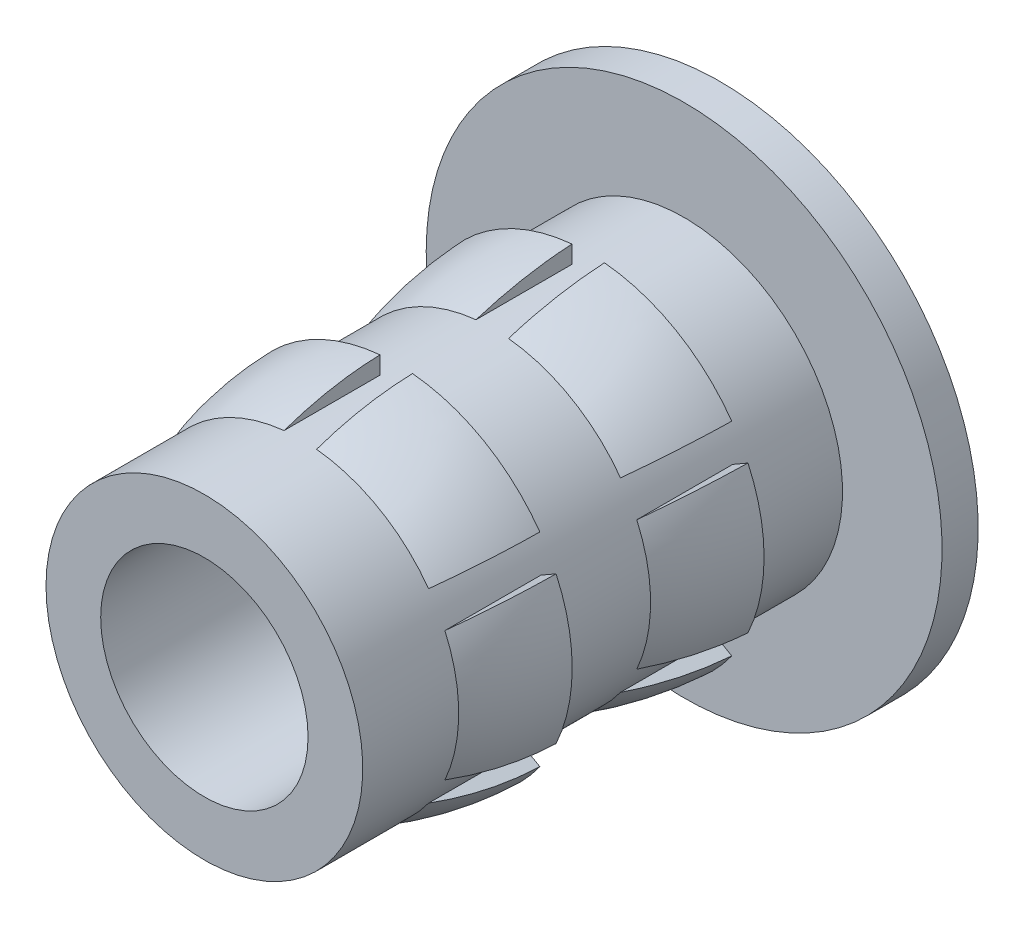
ISO-10303-21;
HEADER;
FILE_DESCRIPTION(('STEP AP214'),'2;1');
FILE_NAME('part.step','',(''),(''),'','','');
FILE_SCHEMA(('AUTOMOTIVE_DESIGN { 1 0 10303 214 1 1 1 1 }'));
ENDSEC;
DATA;
#1=APPLICATION_CONTEXT('core data for automotive mechanical design processes');
#2=APPLICATION_PROTOCOL_DEFINITION('international standard','automotive_design',2000,#1);
#3=PRODUCT_CONTEXT('',#1,'mechanical');
#4=PRODUCT('Part','Part','',(#3));
#5=PRODUCT_RELATED_PRODUCT_CATEGORY('part','',(#4));
#6=PRODUCT_DEFINITION_FORMATION('','',#4);
#7=PRODUCT_DEFINITION_CONTEXT('part definition',#1,'design');
#8=PRODUCT_DEFINITION('design','',#6,#7);
#9=PRODUCT_DEFINITION_SHAPE('','',#8);
#10=(LENGTH_UNIT() NAMED_UNIT(*) SI_UNIT(.MILLI.,.METRE.));
#11=(NAMED_UNIT(*) PLANE_ANGLE_UNIT() SI_UNIT($,.RADIAN.));
#12=(NAMED_UNIT(*) SI_UNIT($,.STERADIAN.) SOLID_ANGLE_UNIT());
#13=UNCERTAINTY_MEASURE_WITH_UNIT(LENGTH_MEASURE(1.E-05),#10,'distance_accuracy_value','');
#14=(GEOMETRIC_REPRESENTATION_CONTEXT(3) GLOBAL_UNCERTAINTY_ASSIGNED_CONTEXT((#13)) GLOBAL_UNIT_ASSIGNED_CONTEXT((#10,
#11,#12)) REPRESENTATION_CONTEXT('',''));
#15=CARTESIAN_POINT('',(0.,0.,0.));
#16=DIRECTION('',(0.,0.,1.));
#17=DIRECTION('',(1.,0.,0.));
#18=AXIS2_PLACEMENT_3D('',#15,#16,#17);
#19=CARTESIAN_POINT('',(11.03324757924,0.,-18.6426107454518));
#20=DIRECTION('',(0.,0.,1.));
#21=DIRECTION('',(1.,0.,0.));
#22=AXIS2_PLACEMENT_3D('',#19,#20,#21);
#23=PLANE('',#22);
#24=CARTESIAN_POINT('',(7.13434757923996,0.,-18.6426107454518));
#25=DIRECTION('',(0.,0.,-1.));
#26=DIRECTION('',(-1.,0.,0.));
#27=AXIS2_PLACEMENT_3D('',#24,#25,#26);
#28=CIRCLE('',#27,4.3307);
#29=CARTESIAN_POINT('',(3.19988351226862,-1.80968367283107,-18.6426107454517));
#30=VERTEX_POINT('',#29);
#31=CARTESIAN_POINT('',(3.19988351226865,1.80968367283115,-18.6426107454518));
#32=VERTEX_POINT('',#31);
#33=EDGE_CURVE('E545',#30,#32,#28,.T.);
#34=ORIENTED_EDGE('',*,*,#33,.T.);
#35=DIRECTION('',(0.866025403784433,-0.50000000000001,0.));
#36=VECTOR('',#35,1.);
#37=CARTESIAN_POINT('',(9.85852257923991,-2.03468338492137,-18.6426107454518));
#38=LINE('',#37,#36);
#39=CARTESIAN_POINT('',(3.57561777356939,1.5927533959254,-18.6426107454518));
#40=VERTEX_POINT('',#39);
#41=EDGE_CURVE('E812',#32,#40,#38,.T.);
#42=ORIENTED_EDGE('',*,*,#41,.T.);
#43=CARTESIAN_POINT('',(7.13434757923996,0.,-18.6426107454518));
#44=DIRECTION('',(0.,0.,-1.));
#45=DIRECTION('',(-1.,0.,0.));
#46=AXIS2_PLACEMENT_3D('',#43,#44,#45);
#47=CIRCLE('',#46,3.8989);
#48=CARTESIAN_POINT('',(3.57561777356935,-1.59275339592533,-18.6426107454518));
#49=VERTEX_POINT('',#48);
#50=EDGE_CURVE('E293',#49,#40,#47,.T.);
#51=ORIENTED_EDGE('',*,*,#50,.F.);
#52=DIRECTION('',(-0.866025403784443,-0.499999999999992,0.));
#53=VECTOR('',#52,1.);
#54=CARTESIAN_POINT('',(9.85852257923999,2.03468338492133,-18.6426107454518));
#55=LINE('',#54,#53);
#56=EDGE_CURVE('E823',#49,#30,#55,.T.);
#57=ORIENTED_EDGE('',*,*,#56,.T.);
#58=EDGE_LOOP('',(#34,#42,#51,#57));
#59=FACE_BOUND('',#58,.T.);
#60=ADVANCED_FACE('F39',(#59),#23,.F.);
#61=CARTESIAN_POINT('',(7.13434757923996,0.,-19.2037723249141));
#62=DIRECTION('',(0.,0.,-1.));
#63=DIRECTION('',(-1.,0.,0.));
#64=AXIS2_PLACEMENT_3D('',#61,#62,#63);
#65=DEGENERATE_TOROIDAL_SURFACE('',#64,5.41639569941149,9.76323598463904,.F.);
#66=CARTESIAN_POINT('',(7.13434757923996,0.,-16.2804107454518));
#67=DIRECTION('',(0.,0.,-1.));
#68=DIRECTION('',(-1.,0.,0.));
#69=AXIS2_PLACEMENT_3D('',#66,#67,#68);
#70=CIRCLE('',#69,3.8989);
#71=CARTESIAN_POINT('',(3.57561777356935,-1.59275339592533,-16.2804107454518));
#72=VERTEX_POINT('',#71);
#73=CARTESIAN_POINT('',(3.57561777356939,1.5927533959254,-16.2804107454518));
#74=VERTEX_POINT('',#73);
#75=EDGE_CURVE('E548',#72,#74,#70,.T.);
#76=ORIENTED_EDGE('',*,*,#75,.T.);
#77=CARTESIAN_POINT('',(3.57567241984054,1.59272184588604,-16.2802107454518));
#78=CARTESIAN_POINT('',(3.52327017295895,1.62297629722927,-16.471966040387));
#79=CARTESIAN_POINT('',(3.47604233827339,1.65024330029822,-16.6656048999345));
#80=CARTESIAN_POINT('',(3.39224170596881,1.69862561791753,-17.0551464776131));
#81=CARTESIAN_POINT('',(3.35562885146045,1.71976405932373,-17.2510377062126));
#82=CARTESIAN_POINT('',(3.2929615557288,1.75594503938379,-17.6450587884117));
#83=CARTESIAN_POINT('',(3.26690710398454,1.77098758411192,-17.8431886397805));
#84=CARTESIAN_POINT('',(3.22536331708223,1.79497290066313,-18.2416915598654));
#85=CARTESIAN_POINT('',(3.20991492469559,1.80389203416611,-18.4420703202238));
#86=CARTESIAN_POINT('',(3.19987349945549,1.80968945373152,-18.6428107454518));
#87=B_SPLINE_CURVE_WITH_KNOTS('',3,(#77,#78,#79,#80,#81,#82,#83,#84,#85,#86),.UNSPECIFIED.,.F.,
.F.,(4,2,2,2,4),(0.,0.603127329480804,1.2039481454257,1.80476836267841,2.40789508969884),.UNSPECIFIED.);
#88=EDGE_CURVE('E816',#74,#32,#87,.T.);
#89=ORIENTED_EDGE('',*,*,#88,.T.);
#90=ORIENTED_EDGE('',*,*,#33,.F.);
#91=CARTESIAN_POINT('',(3.19987349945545,-1.80968945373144,-18.6428107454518));
#92=CARTESIAN_POINT('',(3.20991492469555,-1.80389203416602,-18.4420703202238));
#93=CARTESIAN_POINT('',(3.22536331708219,-1.79497290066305,-18.2416915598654));
#94=CARTESIAN_POINT('',(3.2669071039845,-1.77098758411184,-17.8431886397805));
#95=CARTESIAN_POINT('',(3.29296155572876,-1.75594503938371,-17.6450587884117));
#96=CARTESIAN_POINT('',(3.35562885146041,-1.71976405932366,-17.2510377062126));
#97=CARTESIAN_POINT('',(3.39224170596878,-1.69862561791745,-17.0551464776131));
#98=CARTESIAN_POINT('',(3.47604233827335,-1.65024330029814,-16.6656048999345));
#99=CARTESIAN_POINT('',(3.52327017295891,-1.62297629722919,-16.471966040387));
#100=CARTESIAN_POINT('',(3.57567241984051,-1.59272184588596,-16.2802107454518));
#101=B_SPLINE_CURVE_WITH_KNOTS('',3,(#91,#92,#93,#94,#95,#96,#97,#98,#99,#100),.UNSPECIFIED.,
.F.,.F.,(4,2,2,2,4),(0.,0.603126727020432,1.20394694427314,1.80476776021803,2.40789508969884),.UNSPECIFIED.);
#102=EDGE_CURVE('E465',#30,#72,#101,.T.);
#103=ORIENTED_EDGE('',*,*,#102,.T.);
#104=EDGE_LOOP('',(#76,#89,#90,#103));
#105=FACE_BOUND('',#104,.T.);
#106=ADVANCED_FACE('F400',(#105),#65,.F.);
#107=CARTESIAN_POINT('',(11.03324757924,0.,-13.9182107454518));
#108=DIRECTION('',(0.,0.,1.));
#109=DIRECTION('',(1.,0.,0.));
#110=AXIS2_PLACEMENT_3D('',#107,#108,#109);
#111=PLANE('',#110);
#112=CARTESIAN_POINT('',(7.13434757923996,0.,-13.9182107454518));
#113=DIRECTION('',(0.,0.,-1.));
#114=DIRECTION('',(-1.,0.,0.));
#115=AXIS2_PLACEMENT_3D('',#112,#113,#114);
#116=CIRCLE('',#115,4.3307);
#117=CARTESIAN_POINT('',(3.19988351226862,-1.80968367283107,-13.9182107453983));
#118=VERTEX_POINT('',#117);
#119=CARTESIAN_POINT('',(3.19988351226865,1.80968367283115,-13.9182107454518));
#120=VERTEX_POINT('',#119);
#121=EDGE_CURVE('E783',#118,#120,#116,.T.);
#122=ORIENTED_EDGE('',*,*,#121,.T.);
#123=DIRECTION('',(0.866025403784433,-0.50000000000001,0.));
#124=VECTOR('',#123,1.);
#125=CARTESIAN_POINT('',(9.85852257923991,-2.03468338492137,-13.9182107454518));
#126=LINE('',#125,#124);
#127=CARTESIAN_POINT('',(3.57561777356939,1.5927533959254,-13.9182107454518));
#128=VERTEX_POINT('',#127);
#129=EDGE_CURVE('E1225',#120,#128,#126,.T.);
#130=ORIENTED_EDGE('',*,*,#129,.T.);
#131=CARTESIAN_POINT('',(7.13434757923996,0.,-13.9182107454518));
#132=DIRECTION('',(0.,0.,-1.));
#133=DIRECTION('',(-1.,0.,0.));
#134=AXIS2_PLACEMENT_3D('',#131,#132,#133);
#135=CIRCLE('',#134,3.8989);
#136=CARTESIAN_POINT('',(3.57561777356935,-1.59275339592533,-13.9182107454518));
#137=VERTEX_POINT('',#136);
#138=EDGE_CURVE('E734',#137,#128,#135,.T.);
#139=ORIENTED_EDGE('',*,*,#138,.F.);
#140=DIRECTION('',(-0.866025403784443,-0.499999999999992,0.));
#141=VECTOR('',#140,1.);
#142=CARTESIAN_POINT('',(9.85852257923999,2.03468338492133,-13.9182107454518));
#143=LINE('',#142,#141);
#144=EDGE_CURVE('E810',#137,#118,#143,.T.);
#145=ORIENTED_EDGE('',*,*,#144,.T.);
#146=EDGE_LOOP('',(#122,#130,#139,#145));
#147=FACE_BOUND('',#146,.T.);
#148=ADVANCED_FACE('F654',(#147),#111,.F.);
#149=CARTESIAN_POINT('',(7.13434757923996,0.,-14.1288940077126));
#150=DIRECTION('',(0.,0.,-1.));
#151=DIRECTION('',(-1.,0.,0.));
#152=AXIS2_PLACEMENT_3D('',#149,#150,#151);
#153=DEGENERATE_TOROIDAL_SURFACE('',#152,3.49907314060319,7.83260715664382,.F.);
#154=CARTESIAN_POINT('',(7.13434757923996,0.,-11.5560107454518));
#155=DIRECTION('',(0.,0.,-1.));
#156=DIRECTION('',(-1.,0.,0.));
#157=AXIS2_PLACEMENT_3D('',#154,#155,#156);
#158=CIRCLE('',#157,3.8989);
#159=CARTESIAN_POINT('',(3.57561777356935,-1.59275339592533,-11.5560107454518));
#160=VERTEX_POINT('',#159);
#161=CARTESIAN_POINT('',(3.57561777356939,1.5927533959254,-11.5560107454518));
#162=VERTEX_POINT('',#161);
#163=EDGE_CURVE('E710',#160,#162,#158,.T.);
#164=ORIENTED_EDGE('',*,*,#163,.T.);
#165=CARTESIAN_POINT('',(3.57567833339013,1.59271843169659,-11.5558107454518));
#166=CARTESIAN_POINT('',(3.51804652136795,1.62599217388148,-11.7460876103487));
#167=CARTESIAN_POINT('',(3.46683793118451,1.65555746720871,-11.9389545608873));
#168=CARTESIAN_POINT('',(3.37777548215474,1.70697769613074,-12.3275302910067));
#169=CARTESIAN_POINT('',(3.3398440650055,1.7288774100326,-12.5232153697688));
#170=CARTESIAN_POINT('',(3.27715399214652,1.76507154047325,-12.9173784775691));
#171=CARTESIAN_POINT('',(3.25239532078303,1.77936596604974,-13.1158565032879));
#172=CARTESIAN_POINT('',(3.21606696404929,1.80034015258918,-13.5156155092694));
#173=CARTESIAN_POINT('',(3.20457701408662,1.8069738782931,-13.7169061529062));
#174=CARTESIAN_POINT('',(3.19987883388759,1.80968637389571,-13.9184107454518));
#175=B_SPLINE_CURVE_WITH_KNOTS('',3,(#165,#166,#167,#168,#169,#170,#171,#172,#173,#174),
.UNSPECIFIED.,.F.,.F.,(4,2,2,2,4),(0.,0.604577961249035,1.20556292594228,1.80654717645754,
2.41112441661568),.UNSPECIFIED.);
#176=EDGE_CURVE('E277',#162,#120,#175,.T.);
#177=ORIENTED_EDGE('',*,*,#176,.T.);
#178=ORIENTED_EDGE('',*,*,#121,.F.);
#179=CARTESIAN_POINT('',(3.19987883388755,-1.80968637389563,-13.9184107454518));
#180=CARTESIAN_POINT('',(3.20457701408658,-1.80697387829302,-13.7169061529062));
#181=CARTESIAN_POINT('',(3.21606696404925,-1.8003401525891,-13.5156155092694));
#182=CARTESIAN_POINT('',(3.25239532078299,-1.77936596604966,-13.1158565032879));
#183=CARTESIAN_POINT('',(3.27715399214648,-1.76507154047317,-12.9173784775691));
#184=CARTESIAN_POINT('',(3.33984406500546,-1.72887741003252,-12.5232153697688));
#185=CARTESIAN_POINT('',(3.37777548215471,-1.70697769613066,-12.3275302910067));
#186=CARTESIAN_POINT('',(3.46683793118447,-1.65555746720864,-11.9389545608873));
#187=CARTESIAN_POINT('',(3.51804652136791,-1.62599217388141,-11.7460876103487));
#188=CARTESIAN_POINT('',(3.5756783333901,-1.59271843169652,-11.5558107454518));
#189=B_SPLINE_CURVE_WITH_KNOTS('',3,(#179,#180,#181,#182,#183,#184,#185,#186,#187,#188),
.UNSPECIFIED.,.F.,.F.,(4,2,2,2,4),(0.,0.604577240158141,1.2055614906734,1.80654645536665,
2.41112441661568),.UNSPECIFIED.);
#190=EDGE_CURVE('E713',#118,#160,#189,.T.);
#191=ORIENTED_EDGE('',*,*,#190,.T.);
#192=EDGE_LOOP('',(#164,#177,#178,#191));
#193=FACE_BOUND('',#192,.T.);
#194=ADVANCED_FACE('F647',(#193),#153,.F.);
#195=CARTESIAN_POINT('',(6.73434757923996,-4.31218766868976,-18.6426107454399));
#196=VERTEX_POINT('',#195);
#197=CARTESIAN_POINT('',(3.59988351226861,-2.50250399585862,-18.6426107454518));
#198=VERTEX_POINT('',#197);
#199=EDGE_CURVE('E340',#196,#198,#28,.T.);
#200=ORIENTED_EDGE('',*,*,#199,.T.);
#201=DIRECTION('',(0.866025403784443,0.499999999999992,0.));
#202=VECTOR('',#201,1.);
#203=CARTESIAN_POINT('',(10.25852257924,1.34186306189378,-18.6426107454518));
#204=LINE('',#203,#202);
#205=CARTESIAN_POINT('',(3.97561777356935,-2.28557371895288,-18.6426107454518));
#206=VERTEX_POINT('',#205);
#207=EDGE_CURVE('E339',#198,#206,#204,.T.);
#208=ORIENTED_EDGE('',*,*,#207,.T.);
#209=CARTESIAN_POINT('',(6.73434757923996,-3.87832711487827,-18.6426107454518));
#210=VERTEX_POINT('',#209);
#211=EDGE_CURVE('E298',#210,#206,#47,.T.);
#212=ORIENTED_EDGE('',*,*,#211,.F.);
#213=DIRECTION('',(0.,-1.,0.));
#214=VECTOR('',#213,1.);
#215=CARTESIAN_POINT('',(6.73434757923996,0.,-18.6426107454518));
#216=LINE('',#215,#214);
#217=EDGE_CURVE('E337',#210,#196,#216,.T.);
#218=ORIENTED_EDGE('',*,*,#217,.T.);
#219=EDGE_LOOP('',(#200,#208,#212,#218));
#220=FACE_BOUND('',#219,.T.);
#221=ADVANCED_FACE('F336',(#220),#23,.F.);
#222=CARTESIAN_POINT('',(6.73434757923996,-3.87832711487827,-16.2804107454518));
#223=VERTEX_POINT('',#222);
#224=CARTESIAN_POINT('',(3.97561777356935,-2.28557371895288,-16.2804107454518));
#225=VERTEX_POINT('',#224);
#226=EDGE_CURVE('E552',#223,#225,#70,.T.);
#227=ORIENTED_EDGE('',*,*,#226,.T.);
#228=CARTESIAN_POINT('',(3.9756724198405,-2.28554216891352,-16.2802107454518));
#229=CARTESIAN_POINT('',(3.92327017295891,-2.31579662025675,-16.471966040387));
#230=CARTESIAN_POINT('',(3.87604233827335,-2.3430636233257,-16.6656048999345));
#231=CARTESIAN_POINT('',(3.79224170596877,-2.39144594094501,-17.0551464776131));
#232=CARTESIAN_POINT('',(3.75562885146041,-2.41258438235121,-17.2510377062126));
#233=CARTESIAN_POINT('',(3.69296155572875,-2.44876536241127,-17.6450587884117));
#234=CARTESIAN_POINT('',(3.6669071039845,-2.4638079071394,-17.8431886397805));
#235=CARTESIAN_POINT('',(3.62536331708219,-2.48779322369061,-18.2416915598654));
#236=CARTESIAN_POINT('',(3.60991492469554,-2.49671235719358,-18.4420703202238));
#237=CARTESIAN_POINT('',(3.59987349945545,-2.502509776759,-18.6428107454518));
#238=B_SPLINE_CURVE_WITH_KNOTS('',3,(#228,#229,#230,#231,#232,#233,#234,#235,#236,#237),
.UNSPECIFIED.,.F.,.F.,(4,2,2,2,4),(0.,0.603127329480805,1.2039481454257,1.80476836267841,
2.40789508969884),.UNSPECIFIED.);
#239=EDGE_CURVE('E344',#225,#198,#238,.T.);
#240=ORIENTED_EDGE('',*,*,#239,.T.);
#241=ORIENTED_EDGE('',*,*,#199,.F.);
#242=CARTESIAN_POINT('',(6.73434757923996,-4.16853028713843,-17.4480529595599));
#243=CARTESIAN_POINT('',(6.73434757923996,-4.11936274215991,-17.1803347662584));
#244=CARTESIAN_POINT('',(6.73434757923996,-4.0589331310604,-16.9146496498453));
#245=CARTESIAN_POINT('',(6.73434757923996,-3.91593407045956,-16.3891799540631));
#246=CARTESIAN_POINT('',(6.73434757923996,-3.83335342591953,-16.1293984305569));
#247=CARTESIAN_POINT('',(6.73434757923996,-3.64620373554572,-15.6165615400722));
#248=CARTESIAN_POINT('',(6.73434757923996,-3.54153839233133,-15.363541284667));
#249=CARTESIAN_POINT('',(6.73434757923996,-3.31117898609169,-14.867353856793));
#250=CARTESIAN_POINT('',(6.73434757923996,-3.18549149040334,-14.6241836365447));
#251=CARTESIAN_POINT('',(6.73434757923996,-2.91375558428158,-14.1491857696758));
#252=CARTESIAN_POINT('',(6.73434757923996,-2.76768701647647,-13.9173696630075));
#253=CARTESIAN_POINT('',(6.73434757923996,-2.45604318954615,-13.4669402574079));
#254=CARTESIAN_POINT('',(6.73434757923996,-2.29045453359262,-13.248336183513));
#255=CARTESIAN_POINT('',(6.73434757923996,-2.02881489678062,-12.9327512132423));
#256=CARTESIAN_POINT('',(6.73434757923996,-1.93971625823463,-12.8299374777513));
#257=CARTESIAN_POINT('',(6.73434757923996,-1.75699031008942,-12.6283676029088));
#258=CARTESIAN_POINT('',(6.73434757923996,-1.66336228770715,-12.5296121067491));
#259=CARTESIAN_POINT('',(6.73434757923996,-1.47173023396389,-12.3367071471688));
#260=CARTESIAN_POINT('',(6.73434757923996,-1.37373219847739,-12.2425517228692));
#261=CARTESIAN_POINT('',(6.73434757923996,-1.17312488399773,-12.0593215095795));
#262=CARTESIAN_POINT('',(6.73434757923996,-1.07051748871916,-11.9702446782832));
#263=CARTESIAN_POINT('',(6.73434757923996,-0.93517045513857,-11.8598797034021));
#264=CARTESIAN_POINT('',(6.73434757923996,-0.90485552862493,-11.8356025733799));
#265=CARTESIAN_POINT('',(6.73434757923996,-0.843747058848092,-11.7876597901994));
#266=CARTESIAN_POINT('',(6.73434757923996,-0.812953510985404,-11.7639941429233));
#267=CARTESIAN_POINT('',(6.73434757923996,-0.719513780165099,-11.6938126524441));
#268=CARTESIAN_POINT('',(6.73434757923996,-0.65607257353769,-11.6483295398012));
#269=CARTESIAN_POINT('',(6.73434757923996,-0.55844889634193,-11.583117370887));
#270=CARTESIAN_POINT('',(6.73434757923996,-0.525335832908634,-11.5617890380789));
#271=CARTESIAN_POINT('',(6.73434757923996,-0.458184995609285,-11.5206510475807));
#272=CARTESIAN_POINT('',(6.73434757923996,-0.424147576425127,-11.5008408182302));
#273=CARTESIAN_POINT('',(6.73434757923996,-0.355035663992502,-11.4635302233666));
#274=CARTESIAN_POINT('',(6.73434757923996,-0.319967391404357,-11.4460185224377));
#275=CARTESIAN_POINT('',(6.73434757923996,-0.24832415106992,-11.4144915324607));
#276=CARTESIAN_POINT('',(6.73434757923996,-0.211752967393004,-11.4004680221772));
#277=CARTESIAN_POINT('',(6.73434757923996,-0.142382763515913,-11.379729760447));
#278=CARTESIAN_POINT('',(6.73434757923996,-0.109828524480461,-11.3722395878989));
#279=CARTESIAN_POINT('',(6.73434757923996,-0.0440189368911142,-11.3630361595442));
#280=CARTESIAN_POINT('',(6.73434757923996,-0.0107680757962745,-11.3612932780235));
#281=CARTESIAN_POINT('',(6.73434757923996,0.0554783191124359,-11.3640249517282));
#282=CARTESIAN_POINT('',(6.73434757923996,0.0884737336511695,-11.3685022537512));
#283=CARTESIAN_POINT('',(6.73434757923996,0.13717317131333,-11.378987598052));
#284=CARTESIAN_POINT('',(6.73434757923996,0.153323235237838,-11.3831298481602));
#285=CARTESIAN_POINT('',(6.73434757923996,0.1853166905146,-11.392469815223));
#286=CARTESIAN_POINT('',(6.73434757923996,0.201160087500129,-11.3976675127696));
#287=CARTESIAN_POINT('',(6.73434757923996,0.263363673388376,-11.4199635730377));
#288=CARTESIAN_POINT('',(6.73434757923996,0.308520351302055,-11.4403788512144));
#289=CARTESIAN_POINT('',(6.73434757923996,0.396793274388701,-11.4852580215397));
#290=CARTESIAN_POINT('',(6.73434757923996,0.439903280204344,-11.5097333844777));
#291=CARTESIAN_POINT('',(6.73434757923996,0.524934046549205,-11.5613170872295));
#292=CARTESIAN_POINT('',(6.73434757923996,0.566844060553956,-11.5884430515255));
#293=CARTESIAN_POINT('',(6.73434757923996,0.64945204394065,-11.6443383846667));
#294=CARTESIAN_POINT('',(6.73434757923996,0.690151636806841,-11.6731053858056));
#295=CARTESIAN_POINT('',(6.73434757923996,0.77196869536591,-11.7328885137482));
#296=CARTESIAN_POINT('',(6.73434757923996,0.813054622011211,-11.7639476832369));
#297=CARTESIAN_POINT('',(6.73434757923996,0.894376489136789,-11.82716183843));
#298=CARTESIAN_POINT('',(6.73434757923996,0.934612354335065,-11.8593169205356));
#299=CARTESIAN_POINT('',(6.73434757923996,1.05420261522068,-11.9572012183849));
#300=CARTESIAN_POINT('',(6.73434757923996,1.13241403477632,-12.024330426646));
#301=CARTESIAN_POINT('',(6.73434757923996,1.28624711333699,-12.1617501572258));
#302=CARTESIAN_POINT('',(6.73434757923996,1.3618638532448,-12.2320461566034));
#303=CARTESIAN_POINT('',(6.73434757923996,1.51045638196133,-12.3753398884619));
#304=CARTESIAN_POINT('',(6.73434757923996,1.58343267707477,-12.4483370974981));
#305=CARTESIAN_POINT('',(6.73434757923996,1.79803575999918,-12.6706039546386));
#306=CARTESIAN_POINT('',(6.73434757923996,1.93583620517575,-12.8235990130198));
#307=CARTESIAN_POINT('',(6.73434757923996,2.20088057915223,-13.1382093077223));
#308=CARTESIAN_POINT('',(6.73434757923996,2.32813308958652,-13.2998173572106));
#309=CARTESIAN_POINT('',(6.73434757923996,2.61027702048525,-13.6831144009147));
#310=CARTESIAN_POINT('',(6.73434757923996,2.76125708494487,-13.9077004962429));
#311=CARTESIAN_POINT('',(6.73434757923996,3.0438100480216,-14.3688970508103));
#312=CARTESIAN_POINT('',(6.73434757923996,3.1753728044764,-14.6055137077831));
#313=CARTESIAN_POINT('',(6.73434757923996,3.41826308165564,-15.0891029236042));
#314=CARTESIAN_POINT('',(6.73434757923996,3.52957794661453,-15.3360818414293));
#315=CARTESIAN_POINT('',(6.73434757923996,3.73112727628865,-15.8384479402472));
#316=CARTESIAN_POINT('',(6.73434757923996,3.82136506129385,-16.0938337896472));
#317=CARTESIAN_POINT('',(6.73434757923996,3.98027689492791,-16.6115474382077));
#318=CARTESIAN_POINT('',(6.73434757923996,4.04892621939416,-16.8738828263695));
#319=CARTESIAN_POINT('',(6.73434757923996,4.16408028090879,-17.4034638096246));
#320=CARTESIAN_POINT('',(6.73434757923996,4.21057737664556,-17.670711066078));
#321=CARTESIAN_POINT('',(6.73434757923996,4.28106417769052,-18.208048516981));
#322=CARTESIAN_POINT('',(6.73434757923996,4.30506288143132,-18.478137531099));
#323=CARTESIAN_POINT('',(6.73434757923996,4.33042295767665,-19.0193765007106));
#324=CARTESIAN_POINT('',(6.73434757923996,4.33178425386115,-19.2905264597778));
#325=CARTESIAN_POINT('',(6.73434757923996,4.31177832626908,-19.8342073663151));
#326=CARTESIAN_POINT('',(6.73434757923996,4.29022531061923,-20.1067314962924));
#327=CARTESIAN_POINT('',(6.73434757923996,4.22425903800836,-20.6489102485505));
#328=CARTESIAN_POINT('',(6.73434757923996,4.17985306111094,-20.9185657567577));
#329=CARTESIAN_POINT('',(6.73434757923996,4.0684380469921,-21.4534245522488));
#330=CARTESIAN_POINT('',(6.73434757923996,4.00140835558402,-21.7186235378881));
#331=CARTESIAN_POINT('',(6.73434757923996,3.84521672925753,-22.2424090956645));
#332=CARTESIAN_POINT('',(6.73434757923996,3.75605583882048,-22.5009959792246));
#333=CARTESIAN_POINT('',(6.73434757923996,3.55612101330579,-23.0099219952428));
#334=CARTESIAN_POINT('',(6.73434757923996,3.44532930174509,-23.2602541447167));
#335=CARTESIAN_POINT('',(6.73434757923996,3.20291998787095,-23.7506179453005));
#336=CARTESIAN_POINT('',(6.73434757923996,3.0713031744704,-23.9906499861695));
#337=CARTESIAN_POINT('',(6.73434757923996,2.78841539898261,-24.4580858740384));
#338=CARTESIAN_POINT('',(6.73434757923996,2.63718968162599,-24.6855171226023));
#339=CARTESIAN_POINT('',(6.73434757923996,2.31582306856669,-25.1264457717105));
#340=CARTESIAN_POINT('',(6.73434757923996,2.14569421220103,-25.3399519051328));
#341=CARTESIAN_POINT('',(6.73434757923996,1.87021592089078,-25.65593128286));
#342=CARTESIAN_POINT('',(6.73434757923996,1.77130618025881,-25.7640789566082));
#343=CARTESIAN_POINT('',(6.73434757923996,1.56825926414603,-25.9753955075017));
#344=CARTESIAN_POINT('',(6.73434757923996,1.4641217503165,-26.0785640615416));
#345=CARTESIAN_POINT('',(6.73434757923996,1.28151309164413,-26.2501122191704));
#346=CARTESIAN_POINT('',(6.73434757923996,1.20436147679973,-26.3199006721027));
#347=CARTESIAN_POINT('',(6.73434757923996,1.04733766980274,-26.4560708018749));
#348=CARTESIAN_POINT('',(6.73434757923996,0.96747072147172,-26.5224584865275));
#349=CARTESIAN_POINT('',(6.73434757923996,0.829045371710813,-26.631628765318));
#350=CARTESIAN_POINT('',(6.73434757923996,0.771337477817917,-26.6754843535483));
#351=CARTESIAN_POINT('',(6.73434757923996,0.683104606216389,-26.7393069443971));
#352=CARTESIAN_POINT('',(6.73434757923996,0.653329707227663,-26.7603101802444));
#353=CARTESIAN_POINT('',(6.73434757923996,0.593184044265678,-26.8014427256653));
#354=CARTESIAN_POINT('',(6.73434757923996,0.562813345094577,-26.8215721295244));
#355=CARTESIAN_POINT('',(6.73434757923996,0.500976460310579,-26.8609352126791));
#356=CARTESIAN_POINT('',(6.73434757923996,0.46950148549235,-26.8801551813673));
#357=CARTESIAN_POINT('',(6.73434757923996,0.405573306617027,-26.9170053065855));
#358=CARTESIAN_POINT('',(6.73434757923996,0.373119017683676,-26.9346336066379));
#359=CARTESIAN_POINT('',(6.73434757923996,0.307276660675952,-26.9673428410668));
#360=CARTESIAN_POINT('',(6.73434757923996,0.273899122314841,-26.982444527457));
#361=CARTESIAN_POINT('',(6.73434757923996,0.205725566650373,-27.0089034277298));
#362=CARTESIAN_POINT('',(6.73434757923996,0.170933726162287,-27.0202708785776));
#363=CARTESIAN_POINT('',(6.73434757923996,0.103993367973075,-27.0362672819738));
#364=CARTESIAN_POINT('',(6.73434757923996,0.0720043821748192,-27.0415234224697));
#365=CARTESIAN_POINT('',(6.73434757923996,0.00768561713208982,-27.0462362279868));
#366=CARTESIAN_POINT('',(6.73434757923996,-0.024642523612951,-27.0457136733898));
#367=CARTESIAN_POINT('',(6.73434757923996,-0.0964202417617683,-27.0382518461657));
#368=CARTESIAN_POINT('',(6.73434757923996,-0.135704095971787,-27.0297933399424));
#369=CARTESIAN_POINT('',(6.73434757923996,-0.193310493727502,-27.0125991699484));
#370=CARTESIAN_POINT('',(6.73434757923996,-0.21237583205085,-27.0060768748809));
#371=CARTESIAN_POINT('',(6.73434757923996,-0.250062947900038,-26.9918502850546));
#372=CARTESIAN_POINT('',(6.73434757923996,-0.268684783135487,-26.9841461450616));
#373=CARTESIAN_POINT('',(6.73434757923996,-0.317892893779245,-26.9623378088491));
#374=CARTESIAN_POINT('',(6.73434757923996,-0.348110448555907,-26.947411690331));
#375=CARTESIAN_POINT('',(6.73434757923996,-0.407643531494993,-26.9158429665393));
#376=CARTESIAN_POINT('',(6.73434757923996,-0.436958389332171,-26.8991991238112));
#377=CARTESIAN_POINT('',(6.73434757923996,-0.494919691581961,-26.8646590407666));
#378=CARTESIAN_POINT('',(6.73434757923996,-0.523564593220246,-26.8467602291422));
#379=CARTESIAN_POINT('',(6.73434757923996,-0.580260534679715,-26.8100423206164));
#380=CARTESIAN_POINT('',(6.73434757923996,-0.608311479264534,-26.7912230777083));
#381=CARTESIAN_POINT('',(6.73434757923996,-0.691922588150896,-26.7335486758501));
#382=CARTESIAN_POINT('',(6.73434757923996,-0.746732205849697,-26.6936054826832));
#383=CARTESIAN_POINT('',(6.73434757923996,-0.854713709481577,-26.6117415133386));
#384=CARTESIAN_POINT('',(6.73434757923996,-0.907887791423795,-26.5698235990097));
#385=CARTESIAN_POINT('',(6.73434757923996,-1.05149334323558,-26.4529562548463));
#386=CARTESIAN_POINT('',(6.73434757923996,-1.14059301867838,-26.3763667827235));
#387=CARTESIAN_POINT('',(6.73434757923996,-1.3152967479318,-26.2192791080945));
#388=CARTESIAN_POINT('',(6.73434757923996,-1.40089979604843,-26.1387797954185));
#389=CARTESIAN_POINT('',(6.73434757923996,-1.56885137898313,-25.9742117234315));
#390=CARTESIAN_POINT('',(6.73434757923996,-1.65119493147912,-25.8901378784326));
#391=CARTESIAN_POINT('',(6.73434757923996,-1.81250456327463,-25.7188403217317));
#392=CARTESIAN_POINT('',(6.73434757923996,-1.89147102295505,-25.6316169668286));
#393=CARTESIAN_POINT('',(6.73434757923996,-2.12280905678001,-25.366067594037));
#394=CARTESIAN_POINT('',(6.73434757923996,-2.27016279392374,-25.1833267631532));
#395=CARTESIAN_POINT('',(6.73434757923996,-2.55081456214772,-24.8075813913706));
#396=CARTESIAN_POINT('',(6.73434757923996,-2.68412170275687,-24.6145836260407));
#397=CARTESIAN_POINT('',(6.73434757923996,-2.9358361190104,-24.2199788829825));
#398=CARTESIAN_POINT('',(6.73434757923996,-3.05429023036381,-24.0184017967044));
#399=CARTESIAN_POINT('',(6.73434757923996,-3.27627116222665,-23.6071472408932));
#400=CARTESIAN_POINT('',(6.73434757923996,-3.37979528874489,-23.3974683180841));
#401=CARTESIAN_POINT('',(6.73434757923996,-3.57152296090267,-22.9708846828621));
#402=CARTESIAN_POINT('',(6.73434757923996,-3.65970611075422,-22.7539708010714));
#403=CARTESIAN_POINT('',(6.73434757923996,-3.8201494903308,-22.3143407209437));
#404=CARTESIAN_POINT('',(6.73434757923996,-3.89240971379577,-22.0916245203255));
#405=CARTESIAN_POINT('',(6.73434757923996,-4.03105116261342,-21.6050380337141));
#406=CARTESIAN_POINT('',(6.73434757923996,-4.09457972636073,-21.3403498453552));
#407=CARTESIAN_POINT('',(6.73434757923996,-4.1992116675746,-20.8065729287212));
#408=CARTESIAN_POINT('',(6.73434757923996,-4.24031389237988,-20.5374839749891));
#409=CARTESIAN_POINT('',(6.73434757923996,-4.29977071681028,-19.9972040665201));
#410=CARTESIAN_POINT('',(6.73434757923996,-4.31815837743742,-19.7260167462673));
#411=CARTESIAN_POINT('',(6.73434757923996,-4.33216347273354,-19.1831658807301));
#412=CARTESIAN_POINT('',(6.73434757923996,-4.32779166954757,-18.9115026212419));
#413=CARTESIAN_POINT('',(6.73434757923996,-4.30045913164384,-18.4404953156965));
#414=CARTESIAN_POINT('',(6.73434757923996,-4.28266416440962,-18.2408361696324));
#415=CARTESIAN_POINT('',(6.73434757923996,-4.23478413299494,-17.8431026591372));
#416=CARTESIAN_POINT('',(6.73434757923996,-4.20470547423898,-17.6450275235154));
#417=CARTESIAN_POINT('',(6.73434757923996,-4.16853028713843,-17.4480529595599));
#418=B_SPLINE_CURVE_WITH_KNOTS('',3,(#242,#243,#244,#245,#246,#247,#248,#249,#250,#251,#252,
#253,#254,#255,#256,#257,#258,#259,#260,#261,#262,#263,#264,#265,#266,#267,#268,#269,#270,#271,
#272,#273,#274,#275,#276,#277,#278,#279,#280,#281,#282,#283,#284,#285,#286,#287,#288,#289,#290,
#291,#292,#293,#294,#295,#296,#297,#298,#299,#300,#301,#302,#303,#304,#305,#306,#307,#308,#309,
#310,#311,#312,#313,#314,#315,#316,#317,#318,#319,#320,#321,#322,#323,#324,#325,#326,#327,#328,
#329,#330,#331,#332,#333,#334,#335,#336,#337,#338,#339,#340,#341,#342,#343,#344,#345,#346,#347,
#348,#349,#350,#351,#352,#353,#354,#355,#356,#357,#358,#359,#360,#361,#362,#363,#364,#365,#366,
#367,#368,#369,#370,#371,#372,#373,#374,#375,#376,#377,#378,#379,#380,#381,#382,#383,#384,#385,
#386,#387,#388,#389,#390,#391,#392,#393,#394,#395,#396,#397,#398,#399,#400,#401,#402,#403,#404,
#405,#406,#407,#408,#409,#410,#411,#412,#413,#414,#415,#416,#417),.UNSPECIFIED.,.T.,.F.,(4,2,2,
2,2,2,2,2,2,2,2,2,2,2,2,2,2,2,2,2,2,2,2,2,2,2,2,2,2,2,2,2,2,2,2,2,2,2,2,2,2,2,2,2,2,2,2,2,2,2,2,
2,2,2,2,2,2,2,2,2,2,2,2,2,2,2,2,2,2,2,2,2,2,2,2,2,2,2,2,2,2,2,2,2,2,2,2,4),(0.,
0.816406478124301,1.63322634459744,2.45368429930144,3.27388641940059,4.09490556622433,
4.91649150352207,5.32452888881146,5.73263069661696,6.14018883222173,6.54758189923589,
6.66408860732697,6.78059643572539,7.01463742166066,7.13277372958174,7.25086533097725,
7.36835072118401,7.4855565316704,7.58538259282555,7.68469326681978,7.78404780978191,
7.8340384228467,7.88402811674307,8.03223824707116,8.18087447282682,8.33057669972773,
8.48006814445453,8.63455865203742,8.78906278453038,9.09816679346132,9.40782763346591,
9.71742877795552,10.3346183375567,10.9513007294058,11.7621321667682,12.5733856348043,
13.3851444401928,14.1967752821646,15.0093322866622,15.8221693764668,16.6346812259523,
17.4471958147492,18.2663489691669,19.0852413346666,19.9048833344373,20.7244866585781,
21.5447664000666,22.3650150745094,23.1834037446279,24.0012741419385,24.440803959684,
24.8803622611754,25.1923877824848,25.5038415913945,25.7212189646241,25.8305193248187,
25.9398078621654,26.050412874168,26.1611452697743,26.2709180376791,26.3803873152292,
26.4771986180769,26.573661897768,26.6934221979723,26.7538509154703,26.8142717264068,
26.9152930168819,27.0163875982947,27.1176957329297,27.2190199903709,27.4224032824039,
27.6255003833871,27.9778242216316,28.3302486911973,28.6831925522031,29.0360965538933,
29.7396216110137,30.442687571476,31.1434776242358,31.8443939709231,32.5462351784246,
33.2480766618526,34.0637090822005,34.8793834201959,35.6938691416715,36.5079697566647,
37.1089565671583,37.7096303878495),.UNSPECIFIED.);
#419=EDGE_CURVE('E388',#196,#223,#418,.T.);
#420=ORIENTED_EDGE('',*,*,#419,.T.);
#421=EDGE_LOOP('',(#227,#240,#241,#420));
#422=FACE_BOUND('',#421,.T.);
#423=ADVANCED_FACE('F655',(#422),#65,.F.);
#424=CARTESIAN_POINT('',(6.73434757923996,-4.31218766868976,-13.9182107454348));
#425=VERTEX_POINT('',#424);
#426=CARTESIAN_POINT('',(3.59988351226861,-2.50250399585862,-13.9182107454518));
#427=VERTEX_POINT('',#426);
#428=EDGE_CURVE('E781',#425,#427,#116,.T.);
#429=ORIENTED_EDGE('',*,*,#428,.T.);
#430=DIRECTION('',(0.866025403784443,0.499999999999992,0.));
#431=VECTOR('',#430,1.);
#432=CARTESIAN_POINT('',(10.25852257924,1.34186306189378,-13.9182107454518));
#433=LINE('',#432,#431);
#434=CARTESIAN_POINT('',(3.97561777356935,-2.28557371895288,-13.9182107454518));
#435=VERTEX_POINT('',#434);
#436=EDGE_CURVE('E347',#427,#435,#433,.T.);
#437=ORIENTED_EDGE('',*,*,#436,.T.);
#438=CARTESIAN_POINT('',(6.73434757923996,-3.87832711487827,-13.9182107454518));
#439=VERTEX_POINT('',#438);
#440=EDGE_CURVE('E736',#439,#435,#135,.T.);
#441=ORIENTED_EDGE('',*,*,#440,.F.);
#442=DIRECTION('',(0.,-1.,0.));
#443=VECTOR('',#442,1.);
#444=CARTESIAN_POINT('',(6.73434757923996,0.,-13.9182107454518));
#445=LINE('',#444,#443);
#446=EDGE_CURVE('E367',#439,#425,#445,.T.);
#447=ORIENTED_EDGE('',*,*,#446,.T.);
#448=EDGE_LOOP('',(#429,#437,#441,#447));
#449=FACE_BOUND('',#448,.T.);
#450=ADVANCED_FACE('F693',(#449),#111,.F.);
#451=CARTESIAN_POINT('',(6.73434757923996,-3.87832711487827,-11.5560107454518));
#452=VERTEX_POINT('',#451);
#453=CARTESIAN_POINT('',(3.97561777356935,-2.28557371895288,-11.5560107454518));
#454=VERTEX_POINT('',#453);
#455=EDGE_CURVE('E716',#452,#454,#158,.T.);
#456=ORIENTED_EDGE('',*,*,#455,.T.);
#457=CARTESIAN_POINT('',(3.97567833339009,-2.28553875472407,-11.5558107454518));
#458=CARTESIAN_POINT('',(3.91804652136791,-2.31881249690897,-11.7460876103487));
#459=CARTESIAN_POINT('',(3.86683793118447,-2.3483777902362,-11.9389545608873));
#460=CARTESIAN_POINT('',(3.7777754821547,-2.39979801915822,-12.3275302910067));
#461=CARTESIAN_POINT('',(3.73984406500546,-2.42169773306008,-12.5232153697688));
#462=CARTESIAN_POINT('',(3.67715399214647,-2.45789186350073,-12.9173784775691));
#463=CARTESIAN_POINT('',(3.65239532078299,-2.47218628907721,-13.1158565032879));
#464=CARTESIAN_POINT('',(3.61606696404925,-2.49316047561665,-13.5156155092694));
#465=CARTESIAN_POINT('',(3.60457701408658,-2.49979420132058,-13.7169061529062));
#466=CARTESIAN_POINT('',(3.59987883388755,-2.50250669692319,-13.9184107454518));
#467=B_SPLINE_CURVE_WITH_KNOTS('',3,(#457,#458,#459,#460,#461,#462,#463,#464,#465,#466),
.UNSPECIFIED.,.F.,.F.,(4,2,2,2,4),(0.,0.604577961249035,1.20556292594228,1.80654717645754,
2.41112441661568),.UNSPECIFIED.);
#468=EDGE_CURVE('E826',#454,#427,#467,.T.);
#469=ORIENTED_EDGE('',*,*,#468,.T.);
#470=ORIENTED_EDGE('',*,*,#428,.F.);
#471=CARTESIAN_POINT('',(6.73434757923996,-4.18677036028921,-12.7203028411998));
#472=CARTESIAN_POINT('',(6.73434757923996,-4.14724292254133,-12.5050497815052));
#473=CARTESIAN_POINT('',(6.73434757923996,-4.0986521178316,-12.2915132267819));
#474=CARTESIAN_POINT('',(6.73434757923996,-3.98366145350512,-11.8692184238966));
#475=CARTESIAN_POINT('',(6.73434757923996,-3.9172582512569,-11.6604610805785));
#476=CARTESIAN_POINT('',(6.73434757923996,-3.7670014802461,-11.2489992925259));
#477=CARTESIAN_POINT('',(6.73434757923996,-3.68312359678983,-11.0463037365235));
#478=CARTESIAN_POINT('',(6.73434757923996,-3.49855144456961,-10.6487192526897));
#479=CARTESIAN_POINT('',(6.73434757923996,-3.39785738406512,-10.4538302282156));
#480=CARTESIAN_POINT('',(6.73434757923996,-3.18032476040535,-10.0732472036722));
#481=CARTESIAN_POINT('',(6.73434757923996,-3.06348411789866,-9.88755439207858));
#482=CARTESIAN_POINT('',(6.73434757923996,-2.81442363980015,-9.52672220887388));
#483=CARTESIAN_POINT('',(6.73434757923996,-2.68220062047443,-9.3515850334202));
#484=CARTESIAN_POINT('',(6.73434757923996,-2.40356320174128,-9.01364109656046));
#485=CARTESIAN_POINT('',(6.73434757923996,-2.2571805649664,-8.85080813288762));
#486=CARTESIAN_POINT('',(6.73434757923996,-1.95093077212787,-8.53850034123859));
#487=CARTESIAN_POINT('',(6.73434757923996,-1.79107250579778,-8.38901683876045));
#488=CARTESIAN_POINT('',(6.73434757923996,-1.52454954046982,-8.16144434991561));
#489=CARTESIAN_POINT('',(6.73434757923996,-1.42194275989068,-8.0785592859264));
#490=CARTESIAN_POINT('',(6.73434757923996,-1.21218164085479,-7.91890679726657));
#491=CARTESIAN_POINT('',(6.73434757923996,-1.10503178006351,-7.84213355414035));
#492=CARTESIAN_POINT('',(6.73434757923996,-0.950886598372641,-7.73932857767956));
#493=CARTESIAN_POINT('',(6.73434757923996,-0.905927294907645,-7.7102215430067));
#494=CARTESIAN_POINT('',(6.73434757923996,-0.815131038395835,-7.65341203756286));
#495=CARTESIAN_POINT('',(6.73434757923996,-0.769294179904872,-7.6257094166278));
#496=CARTESIAN_POINT('',(6.73434757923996,-0.676512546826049,-7.57193510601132));
#497=CARTESIAN_POINT('',(6.73434757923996,-0.629565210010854,-7.54586782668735));
#498=CARTESIAN_POINT('',(6.73434757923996,-0.534488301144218,-7.49599129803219));
#499=CARTESIAN_POINT('',(6.73434757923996,-0.486359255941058,-7.47218106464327));
#500=CARTESIAN_POINT('',(6.73434757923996,-0.412449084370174,-7.43877208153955));
#501=CARTESIAN_POINT('',(6.73434757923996,-0.387239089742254,-7.42791399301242));
#502=CARTESIAN_POINT('',(6.73434757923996,-0.336348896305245,-7.40737055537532));
#503=CARTESIAN_POINT('',(6.73434757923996,-0.310668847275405,-7.39768483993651));
#504=CARTESIAN_POINT('',(6.73434757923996,-0.258897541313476,-7.37991253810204));
#505=CARTESIAN_POINT('',(6.73434757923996,-0.232809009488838,-7.37181813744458));
#506=CARTESIAN_POINT('',(6.73434757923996,-0.180072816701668,-7.3576999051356));
#507=CARTESIAN_POINT('',(6.73434757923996,-0.153425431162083,-7.35167507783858));
#508=CARTESIAN_POINT('',(6.73434757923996,-0.105078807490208,-7.34325049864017));
#509=CARTESIAN_POINT('',(6.73434757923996,-0.0834657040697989,-7.34036465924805));
#510=CARTESIAN_POINT('',(6.73434757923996,-0.0400683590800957,-7.33655871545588));
#511=CARTESIAN_POINT('',(6.73434757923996,-0.0182841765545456,-7.33563796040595));
#512=CARTESIAN_POINT('',(6.73434757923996,0.0252724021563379,-7.33585629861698));
#513=CARTESIAN_POINT('',(6.73434757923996,0.0470447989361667,-7.33699527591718));
#514=CARTESIAN_POINT('',(6.73434757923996,0.0904010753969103,-7.34121583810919));
#515=CARTESIAN_POINT('',(6.73434757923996,0.111984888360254,-7.3442980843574));
#516=CARTESIAN_POINT('',(6.73434757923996,0.166639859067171,-7.35429592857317));
#517=CARTESIAN_POINT('',(6.73434757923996,0.199493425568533,-7.36238772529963));
#518=CARTESIAN_POINT('',(6.73434757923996,0.264350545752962,-7.38145374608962));
#519=CARTESIAN_POINT('',(6.73434757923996,0.296353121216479,-7.39243114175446));
#520=CARTESIAN_POINT('',(6.73434757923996,0.359863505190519,-7.41648350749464));
#521=CARTESIAN_POINT('',(6.73434757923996,0.391364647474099,-7.42957578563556));
#522=CARTESIAN_POINT('',(6.73434757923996,0.453696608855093,-7.45721040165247));
#523=CARTESIAN_POINT('',(6.73434757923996,0.484527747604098,-7.47175202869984));
#524=CARTESIAN_POINT('',(6.73434757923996,0.577785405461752,-7.51777199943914));
#525=CARTESIAN_POINT('',(6.73434757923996,0.639353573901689,-7.55098444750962));
#526=CARTESIAN_POINT('',(6.73434757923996,0.760799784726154,-7.62038880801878));
#527=CARTESIAN_POINT('',(6.73434757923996,0.82067681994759,-7.65658244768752));
#528=CARTESIAN_POINT('',(6.73434757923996,0.939060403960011,-7.7313685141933));
#529=CARTESIAN_POINT('',(6.73434757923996,0.99756433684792,-7.76996507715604));
#530=CARTESIAN_POINT('',(6.73434757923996,1.11318412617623,-7.8491424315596));
#531=CARTESIAN_POINT('',(6.73434757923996,1.1703003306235,-7.88972271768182));
#532=CARTESIAN_POINT('',(6.73434757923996,1.33955154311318,-8.01406460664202));
#533=CARTESIAN_POINT('',(6.73434757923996,1.44972565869,-8.10051477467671));
#534=CARTESIAN_POINT('',(6.73434757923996,1.66471957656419,-8.27959145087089));
#535=CARTESIAN_POINT('',(6.73434757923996,1.76954428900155,-8.3722121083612));
#536=CARTESIAN_POINT('',(6.73434757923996,2.02834462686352,-8.61420112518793));
#537=CARTESIAN_POINT('',(6.73434757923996,2.17869694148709,-8.76747585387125));
#538=CARTESIAN_POINT('',(6.73434757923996,2.46603915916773,-9.08622645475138));
#539=CARTESIAN_POINT('',(6.73434757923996,2.60301978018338,-9.25171066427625));
#540=CARTESIAN_POINT('',(6.73434757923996,2.86259212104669,-9.59339649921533));
#541=CARTESIAN_POINT('',(6.73434757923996,2.98519537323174,-9.76958936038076));
#542=CARTESIAN_POINT('',(6.73434757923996,3.21533683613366,-10.131495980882));
#543=CARTESIAN_POINT('',(6.73434757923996,3.32287827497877,-10.3172076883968));
#544=CARTESIAN_POINT('',(6.73434757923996,3.52272134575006,-10.6978186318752));
#545=CARTESIAN_POINT('',(6.73434757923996,3.61494582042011,-10.892758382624));
#546=CARTESIAN_POINT('',(6.73434757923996,3.78293212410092,-11.2896887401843));
#547=CARTESIAN_POINT('',(6.73434757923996,3.85868797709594,-11.4916818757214));
#548=CARTESIAN_POINT('',(6.73434757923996,3.99320470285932,-11.9012995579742));
#549=CARTESIAN_POINT('',(6.73434757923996,4.05196179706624,-12.1089253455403));
#550=CARTESIAN_POINT('',(6.73434757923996,4.15208345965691,-12.5284101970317));
#551=CARTESIAN_POINT('',(6.73434757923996,4.19344149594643,-12.7402708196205));
#552=CARTESIAN_POINT('',(6.73434757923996,4.25894171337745,-13.1698839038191));
#553=CARTESIAN_POINT('',(6.73434757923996,4.28281707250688,-13.3876770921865));
#554=CARTESIAN_POINT('',(6.73434757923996,4.31217206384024,-13.8245989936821));
#555=CARTESIAN_POINT('',(6.73434757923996,4.31764327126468,-14.043728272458));
#556=CARTESIAN_POINT('',(6.73434757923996,4.31013005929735,-14.4815873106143));
#557=CARTESIAN_POINT('',(6.73434757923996,4.29715263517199,-14.700317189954));
#558=CARTESIAN_POINT('',(6.73434757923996,4.25285484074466,-15.1358112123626));
#559=CARTESIAN_POINT('',(6.73434757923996,4.22154278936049,-15.3525762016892));
#560=CARTESIAN_POINT('',(6.73434757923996,4.1407284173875,-15.7830819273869));
#561=CARTESIAN_POINT('',(6.73434757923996,4.09119434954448,-15.9968167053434));
#562=CARTESIAN_POINT('',(6.73434757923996,3.97430877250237,-16.4192714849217));
#563=CARTESIAN_POINT('',(6.73434757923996,3.90696393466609,-16.627993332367));
#564=CARTESIAN_POINT('',(6.73434757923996,3.75482118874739,-17.0392650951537));
#565=CARTESIAN_POINT('',(6.73434757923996,3.67000219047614,-17.2418072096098));
#566=CARTESIAN_POINT('',(6.73434757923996,3.48358067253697,-17.6389222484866));
#567=CARTESIAN_POINT('',(6.73434757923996,3.38198448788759,-17.8334981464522));
#568=CARTESIAN_POINT('',(6.73434757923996,3.16274048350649,-18.2132420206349));
#569=CARTESIAN_POINT('',(6.73434757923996,3.04510166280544,-18.3984151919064));
#570=CARTESIAN_POINT('',(6.73434757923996,2.79448969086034,-18.7581380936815));
#571=CARTESIAN_POINT('',(6.73434757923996,2.66151345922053,-18.9326856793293));
#572=CARTESIAN_POINT('',(6.73434757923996,2.38140985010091,-19.269395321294));
#573=CARTESIAN_POINT('',(6.73434757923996,2.23431336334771,-19.4315830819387));
#574=CARTESIAN_POINT('',(6.73434757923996,1.92668354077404,-19.7425161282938));
#575=CARTESIAN_POINT('',(6.73434757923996,1.76615918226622,-19.8912702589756));
#576=CARTESIAN_POINT('',(6.73434757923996,1.49976154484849,-20.1166157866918));
#577=CARTESIAN_POINT('',(6.73434757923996,1.39799457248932,-20.1980913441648));
#578=CARTESIAN_POINT('',(6.73434757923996,1.2419924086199,-20.3157539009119));
#579=CARTESIAN_POINT('',(6.73434757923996,1.18945661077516,-20.3542005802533));
#580=CARTESIAN_POINT('',(6.73434757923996,1.08322742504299,-20.4294592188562));
#581=CARTESIAN_POINT('',(6.73434757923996,1.02953410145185,-20.4662712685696));
#582=CARTESIAN_POINT('',(6.73434757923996,0.930023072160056,-20.532045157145));
#583=CARTESIAN_POINT('',(6.73434757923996,0.884392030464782,-20.5612893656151));
#584=CARTESIAN_POINT('',(6.73434757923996,0.792218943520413,-20.6183036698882));
#585=CARTESIAN_POINT('',(6.73434757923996,0.745676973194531,-20.6460738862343));
#586=CARTESIAN_POINT('',(6.73434757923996,0.651398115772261,-20.6998866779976));
#587=CARTESIAN_POINT('',(6.73434757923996,0.603657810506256,-20.7259232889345));
#588=CARTESIAN_POINT('',(6.73434757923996,0.506917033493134,-20.7755272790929));
#589=CARTESIAN_POINT('',(6.73434757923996,0.457917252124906,-20.7990959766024));
#590=CARTESIAN_POINT('',(6.73434757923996,0.38325707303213,-20.8315156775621));
#591=CARTESIAN_POINT('',(6.73434757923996,0.35823332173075,-20.8418138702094));
#592=CARTESIAN_POINT('',(6.73434757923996,0.307705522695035,-20.8611465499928));
#593=CARTESIAN_POINT('',(6.73434757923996,0.282201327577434,-20.8701806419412));
#594=CARTESIAN_POINT('',(6.73434757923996,0.205221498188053,-20.8946320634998));
#595=CARTESIAN_POINT('',(6.73434757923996,0.152846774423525,-20.9076009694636));
#596=CARTESIAN_POINT('',(6.73434757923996,0.0778051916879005,-20.9180633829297));
#597=CARTESIAN_POINT('',(6.73434757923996,0.0557789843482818,-20.9201725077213));
#598=CARTESIAN_POINT('',(6.73434757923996,0.0116258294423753,-20.9222994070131));
#599=CARTESIAN_POINT('',(6.73434757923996,-0.0105010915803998,-20.922317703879));
#600=CARTESIAN_POINT('',(6.73434757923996,-0.0547143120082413,-20.9202580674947));
#601=CARTESIAN_POINT('',(6.73434757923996,-0.0768003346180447,-20.9181743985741));
#602=CARTESIAN_POINT('',(6.73434757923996,-0.12070926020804,-20.9121094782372));
#603=CARTESIAN_POINT('',(6.73434757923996,-0.142532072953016,-20.9081275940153));
#604=CARTESIAN_POINT('',(6.73434757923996,-0.210308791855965,-20.8932004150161));
#605=CARTESIAN_POINT('',(6.73434757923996,-0.255641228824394,-20.879472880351));
#606=CARTESIAN_POINT('',(6.73434757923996,-0.344777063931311,-20.8477093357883));
#607=CARTESIAN_POINT('',(6.73434757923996,-0.388576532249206,-20.8296630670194));
#608=CARTESIAN_POINT('',(6.73434757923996,-0.475431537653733,-20.7906741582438));
#609=CARTESIAN_POINT('',(6.73434757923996,-0.518473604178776,-20.7697018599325));
#610=CARTESIAN_POINT('',(6.73434757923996,-0.603515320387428,-20.7258829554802));
#611=CARTESIAN_POINT('',(6.73434757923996,-0.645516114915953,-20.7030385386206));
#612=CARTESIAN_POINT('',(6.73434757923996,-0.76198861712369,-20.6370648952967));
#613=CARTESIAN_POINT('',(6.73434757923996,-0.83555081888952,-20.5923309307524));
#614=CARTESIAN_POINT('',(6.73434757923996,-0.980511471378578,-20.4994634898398));
#615=CARTESIAN_POINT('',(6.73434757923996,-1.05190904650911,-20.4513286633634));
#616=CARTESIAN_POINT('',(6.73434757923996,-1.19278663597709,-20.3521021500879));
#617=CARTESIAN_POINT('',(6.73434757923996,-1.26226345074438,-20.3010059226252));
#618=CARTESIAN_POINT('',(6.73434757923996,-1.39921507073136,-20.1962324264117));
#619=CARTESIAN_POINT('',(6.73434757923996,-1.46669021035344,-20.1425555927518));
#620=CARTESIAN_POINT('',(6.73434757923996,-1.66545452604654,-19.978482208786));
#621=CARTESIAN_POINT('',(6.73434757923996,-1.79382370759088,-19.8645158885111));
#622=CARTESIAN_POINT('',(6.73434757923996,-2.04231043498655,-19.6281374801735));
#623=CARTESIAN_POINT('',(6.73434757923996,-2.1624338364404,-19.5057315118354));
#624=CARTESIAN_POINT('',(6.73434757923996,-2.42476520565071,-19.2197086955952));
#625=CARTESIAN_POINT('',(6.73434757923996,-2.56442810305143,-19.0537452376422));
#626=CARTESIAN_POINT('',(6.73434757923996,-2.82931541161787,-18.7105748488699));
#627=CARTESIAN_POINT('',(6.73434757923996,-2.95453332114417,-18.5333629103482));
#628=CARTESIAN_POINT('',(6.73434757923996,-3.18983379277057,-18.1687968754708));
#629=CARTESIAN_POINT('',(6.73434757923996,-3.29989436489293,-17.9814285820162));
#630=CARTESIAN_POINT('',(6.73434757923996,-3.50392028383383,-17.5981620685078));
#631=CARTESIAN_POINT('',(6.73434757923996,-3.59788793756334,-17.4022650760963));
#632=CARTESIAN_POINT('',(6.73434757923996,-3.76920711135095,-17.0030927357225));
#633=CARTESIAN_POINT('',(6.73434757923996,-3.84654118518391,-16.7998098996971));
#634=CARTESIAN_POINT('',(6.73434757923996,-3.98394542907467,-16.3874912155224));
#635=CARTESIAN_POINT('',(6.73434757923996,-4.04401542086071,-16.1784553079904));
#636=CARTESIAN_POINT('',(6.73434757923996,-4.14643265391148,-15.7562886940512));
#637=CARTESIAN_POINT('',(6.73434757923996,-4.18879661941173,-15.5431620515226));
#638=CARTESIAN_POINT('',(6.73434757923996,-4.25559124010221,-15.114183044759));
#639=CARTESIAN_POINT('',(6.73434757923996,-4.28002506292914,-14.8983311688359));
#640=CARTESIAN_POINT('',(6.73434757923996,-4.31867445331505,-14.3543855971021));
#641=CARTESIAN_POINT('',(6.73434757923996,-4.32125617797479,-14.0253988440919));
#642=CARTESIAN_POINT('',(6.73434757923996,-4.28494005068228,-13.3697557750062));
#643=CARTESIAN_POINT('',(6.73434757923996,-4.24604623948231,-13.0430992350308));
#644=CARTESIAN_POINT('',(6.73434757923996,-4.18677036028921,-12.7203028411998));
#645=B_SPLINE_CURVE_WITH_KNOTS('',3,(#471,#472,#473,#474,#475,#476,#477,#478,#479,#480,#481,
#482,#483,#484,#485,#486,#487,#488,#489,#490,#491,#492,#493,#494,#495,#496,#497,#498,#499,#500,
#501,#502,#503,#504,#505,#506,#507,#508,#509,#510,#511,#512,#513,#514,#515,#516,#517,#518,#519,
#520,#521,#522,#523,#524,#525,#526,#527,#528,#529,#530,#531,#532,#533,#534,#535,#536,#537,#538,
#539,#540,#541,#542,#543,#544,#545,#546,#547,#548,#549,#550,#551,#552,#553,#554,#555,#556,#557,
#558,#559,#560,#561,#562,#563,#564,#565,#566,#567,#568,#569,#570,#571,#572,#573,#574,#575,#576,
#577,#578,#579,#580,#581,#582,#583,#584,#585,#586,#587,#588,#589,#590,#591,#592,#593,#594,#595,
#596,#597,#598,#599,#600,#601,#602,#603,#604,#605,#606,#607,#608,#609,#610,#611,#612,#613,#614,
#615,#616,#617,#618,#619,#620,#621,#622,#623,#624,#625,#626,#627,#628,#629,#630,#631,#632,#633,
#634,#635,#636,#637,#638,#639,#640,#641,#642,#643,#644),.UNSPECIFIED.,.T.,.F.,(4,2,2,2,2,2,2,2,
2,2,2,2,2,2,2,2,2,2,2,2,2,2,2,2,2,2,2,2,2,2,2,2,2,2,2,2,2,2,2,2,2,2,2,2,2,2,2,2,2,2,2,2,2,2,2,2,
2,2,2,2,2,2,2,2,2,2,2,2,2,2,2,2,2,2,2,2,2,2,2,2,2,2,2,2,2,2,4),(0.,0.656274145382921,
1.31267153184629,1.96998841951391,2.62729716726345,3.28469064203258,3.94222042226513,
4.59830801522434,5.25396613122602,5.64950002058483,6.0446527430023,6.2053116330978,
6.3659533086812,6.52701108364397,6.68799831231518,6.77032405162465,6.85262400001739,
6.93450911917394,7.01635478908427,7.0816910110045,7.14700559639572,7.21231650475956,
7.2776496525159,7.37895079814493,7.48036375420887,7.58265315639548,7.68489263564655,
7.89461347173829,8.10445668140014,8.31467165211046,8.52483335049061,8.94467116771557,
9.36411642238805,10.007401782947,10.6511305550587,11.2943393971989,11.9374101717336,
12.5836280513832,13.2300800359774,13.876675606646,14.523513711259,15.1800291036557,
15.8368449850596,16.4934118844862,17.1496811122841,17.8070991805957,18.4642713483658,
19.1222413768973,19.7799635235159,20.4373182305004,21.0948051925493,21.7508852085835,
22.4065300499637,22.7974237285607,22.9927010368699,23.1879675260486,23.3505385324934,
23.5130962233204,23.6761870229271,23.8391902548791,23.9203351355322,24.0015053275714,
24.1624201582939,24.228713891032,24.2949910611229,24.361449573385,24.4279302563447,
24.5695975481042,24.7116047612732,24.8551730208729,24.9985757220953,25.2567242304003,
25.5149758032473,25.7736343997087,26.0322495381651,26.5467583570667,27.0608979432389,
27.7108111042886,28.3610156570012,29.0121537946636,29.663198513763,30.3149227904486,
30.9666537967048,31.6177678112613,32.2687667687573,33.2530202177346,34.2371777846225),.UNSPECIFIED.);
#646=EDGE_CURVE('E360',#425,#452,#645,.T.);
#647=ORIENTED_EDGE('',*,*,#646,.T.);
#648=EDGE_LOOP('',(#456,#469,#470,#647));
#649=FACE_BOUND('',#648,.T.);
#650=ADVANCED_FACE('F686',(#649),#153,.F.);
#651=CARTESIAN_POINT('',(10.6688116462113,-2.50250399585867,-18.6426107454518));
#652=VERTEX_POINT('',#651);
#653=CARTESIAN_POINT('',(7.53434757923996,-4.31218766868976,-18.6426107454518));
#654=VERTEX_POINT('',#653);
#655=EDGE_CURVE('E574',#652,#654,#28,.T.);
#656=ORIENTED_EDGE('',*,*,#655,.T.);
#657=DIRECTION('',(0.,1.,0.));
#658=VECTOR('',#657,1.);
#659=CARTESIAN_POINT('',(7.53434757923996,0.,-18.6426107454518));
#660=LINE('',#659,#658);
#661=CARTESIAN_POINT('',(7.53434757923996,-3.87832711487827,-18.6426107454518));
#662=VERTEX_POINT('',#661);
#663=EDGE_CURVE('E570',#654,#662,#660,.T.);
#664=ORIENTED_EDGE('',*,*,#663,.T.);
#665=CARTESIAN_POINT('',(10.2930773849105,-2.28557371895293,-18.6426107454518));
#666=VERTEX_POINT('',#665);
#667=EDGE_CURVE('E312',#666,#662,#47,.T.);
#668=ORIENTED_EDGE('',*,*,#667,.F.);
#669=DIRECTION('',(0.866025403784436,-0.500000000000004,0.));
#670=VECTOR('',#669,1.);
#671=CARTESIAN_POINT('',(9.85852257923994,-2.03468338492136,-18.6426107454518));
#672=LINE('',#671,#670);
#673=EDGE_CURVE('E765',#666,#652,#672,.T.);
#674=ORIENTED_EDGE('',*,*,#673,.T.);
#675=EDGE_LOOP('',(#656,#664,#668,#674));
#676=FACE_BOUND('',#675,.T.);
#677=ADVANCED_FACE('F572',(#676),#23,.F.);
#678=CARTESIAN_POINT('',(10.2930773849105,-2.28557371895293,-16.2804107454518));
#679=VERTEX_POINT('',#678);
#680=CARTESIAN_POINT('',(7.53434757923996,-3.87832711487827,-16.2804107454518));
#681=VERTEX_POINT('',#680);
#682=EDGE_CURVE('E547',#679,#681,#70,.T.);
#683=ORIENTED_EDGE('',*,*,#682,.T.);
#684=CARTESIAN_POINT('',(7.53434757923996,-4.16853028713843,-17.4480529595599));
#685=CARTESIAN_POINT('',(7.53434757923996,-4.2178395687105,-17.7165552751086));
#686=CARTESIAN_POINT('',(7.53434757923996,-4.25583184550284,-17.9871629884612));
#687=CARTESIAN_POINT('',(7.53434757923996,-4.30891691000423,-18.5307197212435));
#688=CARTESIAN_POINT('',(7.53434757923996,-4.3239997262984,-18.8036697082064));
#689=CARTESIAN_POINT('',(7.53434757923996,-4.33113958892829,-19.3502168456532));
#690=CARTESIAN_POINT('',(7.53434757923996,-4.32316775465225,-19.62381437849));
#691=CARTESIAN_POINT('',(7.53434757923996,-4.28418928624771,-20.169369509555));
#692=CARTESIAN_POINT('',(7.53434757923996,-4.25318208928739,-20.4413270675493));
#693=CARTESIAN_POINT('',(7.53434757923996,-4.16840171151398,-20.9813049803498));
#694=CARTESIAN_POINT('',(7.53434757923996,-4.11465843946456,-21.2493300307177));
#695=CARTESIAN_POINT('',(7.53434757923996,-3.98477335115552,-21.7799162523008));
#696=CARTESIAN_POINT('',(7.53434757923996,-3.90863004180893,-22.0424770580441));
#697=CARTESIAN_POINT('',(7.53434757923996,-3.73435772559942,-22.5605545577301));
#698=CARTESIAN_POINT('',(7.53434757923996,-3.63620213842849,-22.8160623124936));
#699=CARTESIAN_POINT('',(7.53434757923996,-3.41862256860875,-23.3178467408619));
#700=CARTESIAN_POINT('',(7.53434757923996,-3.29919926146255,-23.5641237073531));
#701=CARTESIAN_POINT('',(7.53434757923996,-3.03990605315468,-24.0455786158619));
#702=CARTESIAN_POINT('',(7.53434757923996,-2.90004242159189,-24.2807599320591));
#703=CARTESIAN_POINT('',(7.53434757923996,-2.60065779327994,-24.7383996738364));
#704=CARTESIAN_POINT('',(7.53434757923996,-2.44112805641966,-24.9608523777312));
#705=CARTESIAN_POINT('',(7.53434757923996,-2.10393795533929,-25.3903456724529));
#706=CARTESIAN_POINT('',(7.53434757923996,-1.92634555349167,-25.5974393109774));
#707=CARTESIAN_POINT('',(7.53434757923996,-1.6465986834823,-25.8952579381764));
#708=CARTESIAN_POINT('',(7.53434757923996,-1.55115936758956,-25.9923618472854));
#709=CARTESIAN_POINT('',(7.53434757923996,-1.3557529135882,-26.181888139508));
#710=CARTESIAN_POINT('',(7.53434757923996,-1.25578707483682,-26.2743118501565));
#711=CARTESIAN_POINT('',(7.53434757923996,-1.11945407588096,-26.393704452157));
#712=CARTESIAN_POINT('',(7.53434757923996,-1.08523058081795,-26.4231385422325));
#713=CARTESIAN_POINT('',(7.53434757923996,-1.01622080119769,-26.4813337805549));
#714=CARTESIAN_POINT('',(7.53434757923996,-0.981434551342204,-26.5100949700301));
#715=CARTESIAN_POINT('',(7.53434757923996,-0.876178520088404,-26.5952855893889));
#716=CARTESIAN_POINT('',(7.53434757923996,-0.804809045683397,-26.6506241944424));
#717=CARTESIAN_POINT('',(7.53434757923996,-0.700934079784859,-26.7265751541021));
#718=CARTESIAN_POINT('',(7.53434757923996,-0.669657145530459,-26.7488729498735));
#719=CARTESIAN_POINT('',(7.53434757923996,-0.606459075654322,-26.7925329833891));
#720=CARTESIAN_POINT('',(7.53434757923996,-0.574538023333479,-26.8138953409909));
#721=CARTESIAN_POINT('',(7.53434757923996,-0.509879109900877,-26.8554238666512));
#722=CARTESIAN_POINT('',(7.53434757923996,-0.477140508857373,-26.8755888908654));
#723=CARTESIAN_POINT('',(7.53434757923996,-0.410673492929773,-26.9142001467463));
#724=CARTESIAN_POINT('',(7.53434757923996,-0.376945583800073,-26.9326472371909));
#725=CARTESIAN_POINT('',(7.53434757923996,-0.306619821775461,-26.9677526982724));
#726=CARTESIAN_POINT('',(7.53434757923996,-0.269961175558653,-26.9842921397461));
#727=CARTESIAN_POINT('',(7.53434757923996,-0.19490590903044,-27.0127167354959));
#728=CARTESIAN_POINT('',(7.53434757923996,-0.156515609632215,-27.0246174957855));
#729=CARTESIAN_POINT('',(7.53434757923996,-0.085657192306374,-27.0394499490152));
#730=CARTESIAN_POINT('',(7.53434757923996,-0.0534769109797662,-27.0436697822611));
#731=CARTESIAN_POINT('',(7.53434757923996,0.0110634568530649,-27.0461939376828));
#732=CARTESIAN_POINT('',(7.53434757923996,0.0434230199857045,-27.0445107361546));
#733=CARTESIAN_POINT('',(7.53434757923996,0.117281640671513,-27.0343659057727));
#734=CARTESIAN_POINT('',(7.53434757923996,0.15849907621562,-27.0239620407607));
#735=CARTESIAN_POINT('',(7.53434757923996,0.218818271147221,-27.003827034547));
#736=CARTESIAN_POINT('',(7.53434757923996,0.238754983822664,-26.9963187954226));
#737=CARTESIAN_POINT('',(7.53434757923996,0.278149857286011,-26.9801316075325));
#738=CARTESIAN_POINT('',(7.53434757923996,0.297608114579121,-26.9714528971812));
#739=CARTESIAN_POINT('',(7.53434757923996,0.351458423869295,-26.9459178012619));
#740=CARTESIAN_POINT('',(7.53434757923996,0.385371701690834,-26.9280639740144));
#741=CARTESIAN_POINT('',(7.53434757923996,0.452153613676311,-26.890483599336));
#742=CARTESIAN_POINT('',(7.53434757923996,0.485021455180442,-26.8707556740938));
#743=CARTESIAN_POINT('',(7.53434757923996,0.549996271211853,-26.8299443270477));
#744=CARTESIAN_POINT('',(7.53434757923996,0.582101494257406,-26.8088581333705));
#745=CARTESIAN_POINT('',(7.53434757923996,0.645638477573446,-26.7656911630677));
#746=CARTESIAN_POINT('',(7.53434757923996,0.677070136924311,-26.7436102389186));
#747=CARTESIAN_POINT('',(7.53434757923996,0.770716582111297,-26.6760460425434));
#748=CARTESIAN_POINT('',(7.53434757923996,0.832075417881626,-26.6293756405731));
#749=CARTESIAN_POINT('',(7.53434757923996,0.952880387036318,-26.5338141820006));
#750=CARTESIAN_POINT('',(7.53434757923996,1.01232905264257,-26.4849262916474));
#751=CARTESIAN_POINT('',(7.53434757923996,1.16427167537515,-26.3558188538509));
#752=CARTESIAN_POINT('',(7.53434757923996,1.25553955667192,-26.2741519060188));
#753=CARTESIAN_POINT('',(7.53434757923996,1.43436019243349,-26.1068362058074));
#754=CARTESIAN_POINT('',(7.53434757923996,1.52191203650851,-26.0211864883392));
#755=CARTESIAN_POINT('',(7.53434757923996,1.77933045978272,-25.7586665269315));
#756=CARTESIAN_POINT('',(7.53434757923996,1.94375195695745,-25.5764050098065));
#757=CARTESIAN_POINT('',(7.53434757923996,2.25726522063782,-25.2001369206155));
#758=CARTESIAN_POINT('',(7.53434757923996,2.40640137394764,-25.0061671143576));
#759=CARTESIAN_POINT('',(7.53434757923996,2.68923787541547,-24.6074434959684));
#760=CARTESIAN_POINT('',(7.53434757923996,2.82294702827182,-24.4026959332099));
#761=CARTESIAN_POINT('',(7.53434757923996,3.0740766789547,-23.9841312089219));
#762=CARTESIAN_POINT('',(7.53434757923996,3.19153614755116,-23.7703374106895));
#763=CARTESIAN_POINT('',(7.53434757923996,3.4099698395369,-23.3344480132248));
#764=CARTESIAN_POINT('',(7.53434757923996,3.51094152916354,-23.1123511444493));
#765=CARTESIAN_POINT('',(7.53434757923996,3.69594695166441,-22.6609255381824));
#766=CARTESIAN_POINT('',(7.53434757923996,3.77996194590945,-22.4315891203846));
#767=CARTESIAN_POINT('',(7.53434757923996,3.93046641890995,-21.9672279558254));
#768=CARTESIAN_POINT('',(7.53434757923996,3.99695486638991,-21.7322028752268));
#769=CARTESIAN_POINT('',(7.53434757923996,4.11864387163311,-21.2305790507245));
#770=CARTESIAN_POINT('',(7.53434757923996,4.17167463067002,-20.9634511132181));
#771=CARTESIAN_POINT('',(7.53434757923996,4.25513985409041,-20.4256711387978));
#772=CARTESIAN_POINT('',(7.53434757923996,4.28557226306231,-20.1550187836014));
#773=CARTESIAN_POINT('',(7.53434757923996,4.32362257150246,-19.6121984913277));
#774=CARTESIAN_POINT('',(7.53434757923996,4.33124762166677,-19.3400310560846));
#775=CARTESIAN_POINT('',(7.53434757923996,4.32365073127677,-18.7960145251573));
#776=CARTESIAN_POINT('',(7.53434757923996,4.30842866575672,-18.5241654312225));
#777=CARTESIAN_POINT('',(7.53434757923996,4.25513287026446,-17.9815987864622));
#778=CARTESIAN_POINT('',(7.53434757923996,4.21696645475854,-17.7108903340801));
#779=CARTESIAN_POINT('',(7.53434757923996,4.11796517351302,-17.1736428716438));
#780=CARTESIAN_POINT('',(7.53434757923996,4.05712966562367,-16.9071039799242));
#781=CARTESIAN_POINT('',(7.53434757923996,3.91314523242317,-16.3798811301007));
#782=CARTESIAN_POINT('',(7.53434757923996,3.82997762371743,-16.1192022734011));
#783=CARTESIAN_POINT('',(7.53434757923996,3.6419196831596,-15.6058093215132));
#784=CARTESIAN_POINT('',(7.53434757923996,3.53702993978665,-15.3530950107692));
#785=CARTESIAN_POINT('',(7.53434757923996,3.30624658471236,-14.8574953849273));
#786=CARTESIAN_POINT('',(7.53434757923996,3.18035672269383,-14.6146083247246));
#787=CARTESIAN_POINT('',(7.53434757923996,2.90835191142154,-14.1403639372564));
#788=CARTESIAN_POINT('',(7.53434757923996,2.76223188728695,-13.9090095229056));
#789=CARTESIAN_POINT('',(7.53434757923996,2.45099498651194,-13.4601357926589));
#790=CARTESIAN_POINT('',(7.53434757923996,2.28592023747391,-13.2425874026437));
#791=CARTESIAN_POINT('',(7.53434757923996,2.02462416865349,-12.9278408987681));
#792=CARTESIAN_POINT('',(7.53434757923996,1.93526677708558,-12.8248769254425));
#793=CARTESIAN_POINT('',(7.53434757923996,1.75203244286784,-12.6230588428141));
#794=CARTESIAN_POINT('',(7.53434757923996,1.65815615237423,-12.5242041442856));
#795=CARTESIAN_POINT('',(7.53434757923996,1.47884297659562,-12.3440208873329));
#796=CARTESIAN_POINT('',(7.53434757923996,1.39397410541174,-12.2621259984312));
#797=CARTESIAN_POINT('',(7.53434757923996,1.22085636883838,-12.1021830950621));
#798=CARTESIAN_POINT('',(7.53434757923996,1.13261173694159,-12.0241305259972));
#799=CARTESIAN_POINT('',(7.53434757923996,0.979038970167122,-11.8950370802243));
#800=CARTESIAN_POINT('',(7.53434757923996,0.914673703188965,-11.8428488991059));
#801=CARTESIAN_POINT('',(7.53434757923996,0.783633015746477,-11.7411755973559));
#802=CARTESIAN_POINT('',(7.53434757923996,0.716953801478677,-11.6916952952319));
#803=CARTESIAN_POINT('',(7.53434757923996,0.616550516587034,-11.621856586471));
#804=CARTESIAN_POINT('',(7.53434757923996,0.583954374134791,-11.59987858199));
#805=CARTESIAN_POINT('',(7.53434757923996,0.517959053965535,-11.5571706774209));
#806=CARTESIAN_POINT('',(7.53434757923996,0.484560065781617,-11.5364404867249));
#807=CARTESIAN_POINT('',(7.53434757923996,0.416728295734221,-11.4967185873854));
#808=CARTESIAN_POINT('',(7.53434757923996,0.382295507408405,-11.4777268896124));
#809=CARTESIAN_POINT('',(7.53434757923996,0.312122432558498,-11.442398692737));
#810=CARTESIAN_POINT('',(7.53434757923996,0.276383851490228,-11.4260588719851));
#811=CARTESIAN_POINT('',(7.53434757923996,0.204392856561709,-11.3981293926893));
#812=CARTESIAN_POINT('',(7.53434757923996,0.168200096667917,-11.386396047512));
#813=CARTESIAN_POINT('',(7.53434757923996,0.112936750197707,-11.3735448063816));
#814=CARTESIAN_POINT('',(7.53434757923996,0.0944223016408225,-11.370056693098));
#815=CARTESIAN_POINT('',(7.53434757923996,0.0571468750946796,-11.3649016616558));
#816=CARTESIAN_POINT('',(7.53434757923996,0.0383860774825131,-11.3632334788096));
#817=CARTESIAN_POINT('',(7.53434757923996,0.000602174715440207,-11.3618629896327));
#818=CARTESIAN_POINT('',(7.53434757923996,-0.0184216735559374,-11.3621805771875));
#819=CARTESIAN_POINT('',(7.53434757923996,-0.0563316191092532,-11.3647971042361));
#820=CARTESIAN_POINT('',(7.53434757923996,-0.07521769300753,-11.3670963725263));
#821=CARTESIAN_POINT('',(7.53434757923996,-0.11281836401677,-11.3734902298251));
#822=CARTESIAN_POINT('',(7.53434757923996,-0.131530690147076,-11.3775978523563));
#823=CARTESIAN_POINT('',(7.53434757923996,-0.16855611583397,-11.3873145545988));
#824=CARTESIAN_POINT('',(7.53434757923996,-0.186869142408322,-11.3929239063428));
#825=CARTESIAN_POINT('',(7.53434757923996,-0.248506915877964,-11.4140369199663));
#826=CARTESIAN_POINT('',(7.53434757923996,-0.290849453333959,-11.432375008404));
#827=CARTESIAN_POINT('',(7.53434757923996,-0.373655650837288,-11.4729018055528));
#828=CARTESIAN_POINT('',(7.53434757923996,-0.414114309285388,-11.4951000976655));
#829=CARTESIAN_POINT('',(7.53434757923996,-0.493910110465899,-11.5420112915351));
#830=CARTESIAN_POINT('',(7.53434757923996,-0.533237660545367,-11.5667403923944));
#831=CARTESIAN_POINT('',(7.53434757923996,-0.610765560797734,-11.6177820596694));
#832=CARTESIAN_POINT('',(7.53434757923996,-0.648967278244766,-11.6440925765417));
#833=CARTESIAN_POINT('',(7.53434757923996,-0.72669499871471,-11.6994742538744));
#834=CARTESIAN_POINT('',(7.53434757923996,-0.766169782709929,-11.7286170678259));
#835=CARTESIAN_POINT('',(7.53434757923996,-0.844305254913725,-11.7879768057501));
#836=CARTESIAN_POINT('',(7.53434757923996,-0.882965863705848,-11.8181938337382));
#837=CARTESIAN_POINT('',(7.53434757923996,-0.997894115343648,-11.9102169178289));
#838=CARTESIAN_POINT('',(7.53434757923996,-1.07308120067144,-11.9733753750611));
#839=CARTESIAN_POINT('',(7.53434757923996,-1.22106116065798,-12.1026879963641));
#840=CARTESIAN_POINT('',(7.53434757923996,-1.29384940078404,-12.1688474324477));
#841=CARTESIAN_POINT('',(7.53434757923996,-1.43700339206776,-12.3036998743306));
#842=CARTESIAN_POINT('',(7.53434757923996,-1.50736965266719,-12.3723923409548));
#843=CARTESIAN_POINT('',(7.53434757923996,-1.71456826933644,-12.5815797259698));
#844=CARTESIAN_POINT('',(7.53434757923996,-1.84791705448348,-12.7255523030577));
#845=CARTESIAN_POINT('',(7.53434757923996,-2.10506607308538,-13.0215137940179));
#846=CARTESIAN_POINT('',(7.53434757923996,-2.22887462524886,-13.1734955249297));
#847=CARTESIAN_POINT('',(7.53434757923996,-2.51182294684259,-13.5437544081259));
#848=CARTESIAN_POINT('',(7.53434757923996,-2.66662254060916,-13.7653712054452));
#849=CARTESIAN_POINT('',(7.53434757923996,-2.9570619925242,-14.2209996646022));
#850=CARTESIAN_POINT('',(7.53434757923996,-3.09268888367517,-14.4550195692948));
#851=CARTESIAN_POINT('',(7.53434757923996,-3.34369036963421,-14.9333330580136));
#852=CARTESIAN_POINT('',(7.53434757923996,-3.45908827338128,-15.1776144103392));
#853=CARTESIAN_POINT('',(7.53434757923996,-3.66902137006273,-15.674828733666));
#854=CARTESIAN_POINT('',(7.53434757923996,-3.76356845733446,-15.9277566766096));
#855=CARTESIAN_POINT('',(7.53434757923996,-3.9150115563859,-16.3909045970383));
#856=CARTESIAN_POINT('',(7.53434757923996,-3.97565317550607,-16.5999088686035));
#857=CARTESIAN_POINT('',(7.53434757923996,-4.08276811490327,-17.0215142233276));
#858=CARTESIAN_POINT('',(7.53434757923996,-4.12924156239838,-17.2341152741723));
#859=CARTESIAN_POINT('',(7.53434757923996,-4.16853028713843,-17.4480529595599));
#860=B_SPLINE_CURVE_WITH_KNOTS('',3,(#684,#685,#686,#687,#688,#689,#690,#691,#692,#693,#694,
#695,#696,#697,#698,#699,#700,#701,#702,#703,#704,#705,#706,#707,#708,#709,#710,#711,#712,#713,
#714,#715,#716,#717,#718,#719,#720,#721,#722,#723,#724,#725,#726,#727,#728,#729,#730,#731,#732,
#733,#734,#735,#736,#737,#738,#739,#740,#741,#742,#743,#744,#745,#746,#747,#748,#749,#750,#751,
#752,#753,#754,#755,#756,#757,#758,#759,#760,#761,#762,#763,#764,#765,#766,#767,#768,#769,#770,
#771,#772,#773,#774,#775,#776,#777,#778,#779,#780,#781,#782,#783,#784,#785,#786,#787,#788,#789,
#790,#791,#792,#793,#794,#795,#796,#797,#798,#799,#800,#801,#802,#803,#804,#805,#806,#807,#808,
#809,#810,#811,#812,#813,#814,#815,#816,#817,#818,#819,#820,#821,#822,#823,#824,#825,#826,#827,
#828,#829,#830,#831,#832,#833,#834,#835,#836,#837,#838,#839,#840,#841,#842,#843,#844,#845,#846,
#847,#848,#849,#850,#851,#852,#853,#854,#855,#856,#857,#858,#859),.UNSPECIFIED.,.T.,.F.,(4,2,2,
2,2,2,2,2,2,2,2,2,2,2,2,2,2,2,2,2,2,2,2,2,2,2,2,2,2,2,2,2,2,2,2,2,2,2,2,2,2,2,2,2,2,2,2,2,2,2,2,
2,2,2,2,2,2,2,2,2,2,2,2,2,2,2,2,2,2,2,2,2,2,2,2,2,2,2,2,2,2,2,2,2,2,2,2,4),(0.,
0.818781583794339,1.63791944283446,2.45808388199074,3.27826836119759,4.09737724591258,
4.91654074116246,5.73669877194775,6.55683075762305,7.37671171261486,8.19695836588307,
9.01422556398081,9.4225711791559,9.83080031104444,9.96621323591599,10.1016178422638,
10.3724174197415,10.48764011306,10.6028479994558,10.7181642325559,10.8334225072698,
10.953903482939,11.0739755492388,11.1708626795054,11.2675451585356,11.394244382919,
11.4581394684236,11.5220215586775,11.6369007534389,11.7518650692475,11.8670719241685,
11.9822959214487,12.2134842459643,12.4443522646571,12.8116108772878,13.1789589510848,
13.9144767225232,14.6477942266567,15.3806911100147,16.11179867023,16.8430184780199,
17.5750419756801,18.3071085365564,19.1231527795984,19.9392712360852,20.7551337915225,
21.5710008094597,22.3901859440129,23.2093942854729,24.0292901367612,24.8491637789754,
25.6688911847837,26.4888245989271,27.3069697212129,27.7158556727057,28.1246827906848,
28.4784044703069,28.8316962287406,29.0802390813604,29.329210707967,29.4471309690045,
29.5650236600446,29.6829170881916,29.8006616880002,29.914368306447,29.970812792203,
30.0272180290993,30.0841892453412,30.1411699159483,30.1985681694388,30.2559768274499,
30.3939866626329,30.5323441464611,30.6716503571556,30.8107797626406,30.9579570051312,
31.1051485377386,31.3996315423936,31.6946535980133,31.9896132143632,32.5778689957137,
33.1656058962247,33.975558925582,34.7860571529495,35.5956152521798,36.4047103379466,
37.0571062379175,37.7094962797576),.UNSPECIFIED.);
#861=EDGE_CURVE('E458',#681,#654,#860,.T.);
#862=ORIENTED_EDGE('',*,*,#861,.T.);
#863=ORIENTED_EDGE('',*,*,#655,.F.);
#864=CARTESIAN_POINT('',(10.6688216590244,-2.50250977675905,-18.6428107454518));
#865=CARTESIAN_POINT('',(10.6587802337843,-2.49671235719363,-18.4420703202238));
#866=CARTESIAN_POINT('',(10.6433318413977,-2.48779322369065,-18.2416915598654));
#867=CARTESIAN_POINT('',(10.6017880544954,-2.46380790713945,-17.8431886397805));
#868=CARTESIAN_POINT('',(10.5757336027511,-2.44876536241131,-17.6450587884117));
#869=CARTESIAN_POINT('',(10.5130663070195,-2.41258438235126,-17.2510377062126));
#870=CARTESIAN_POINT('',(10.4764534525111,-2.39144594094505,-17.0551464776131));
#871=CARTESIAN_POINT('',(10.3926528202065,-2.34306362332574,-16.6656048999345));
#872=CARTESIAN_POINT('',(10.345424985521,-2.31579662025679,-16.471966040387));
#873=CARTESIAN_POINT('',(10.2930227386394,-2.28554216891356,-16.2802107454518));
#874=B_SPLINE_CURVE_WITH_KNOTS('',3,(#864,#865,#866,#867,#868,#869,#870,#871,#872,#873),
.UNSPECIFIED.,.F.,.F.,(4,2,2,2,4),(0.,0.603126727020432,1.20394694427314,1.80476776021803,
2.40789508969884),.UNSPECIFIED.);
#875=EDGE_CURVE('E441',#652,#679,#874,.T.);
#876=ORIENTED_EDGE('',*,*,#875,.T.);
#877=EDGE_LOOP('',(#683,#862,#863,#876));
#878=FACE_BOUND('',#877,.T.);
#879=ADVANCED_FACE('F563',(#878),#65,.F.);
#880=CARTESIAN_POINT('',(10.6688116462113,-2.50250399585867,-13.9182107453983));
#881=VERTEX_POINT('',#880);
#882=CARTESIAN_POINT('',(7.53434757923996,-4.31218766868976,-13.9182107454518));
#883=VERTEX_POINT('',#882);
#884=EDGE_CURVE('E775',#881,#883,#116,.T.);
#885=ORIENTED_EDGE('',*,*,#884,.T.);
#886=DIRECTION('',(0.,1.,0.));
#887=VECTOR('',#886,1.);
#888=CARTESIAN_POINT('',(7.53434757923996,0.,-13.9182107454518));
#889=LINE('',#888,#887);
#890=CARTESIAN_POINT('',(7.53434757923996,-3.87832711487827,-13.9182107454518));
#891=VERTEX_POINT('',#890);
#892=EDGE_CURVE('E577',#883,#891,#889,.T.);
#893=ORIENTED_EDGE('',*,*,#892,.T.);
#894=CARTESIAN_POINT('',(10.2930773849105,-2.28557371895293,-13.9182107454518));
#895=VERTEX_POINT('',#894);
#896=EDGE_CURVE('E739',#895,#891,#135,.T.);
#897=ORIENTED_EDGE('',*,*,#896,.F.);
#898=DIRECTION('',(0.866025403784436,-0.500000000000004,0.));
#899=VECTOR('',#898,1.);
#900=CARTESIAN_POINT('',(9.85852257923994,-2.03468338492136,-13.9182107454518));
#901=LINE('',#900,#899);
#902=EDGE_CURVE('E588',#895,#881,#901,.T.);
#903=ORIENTED_EDGE('',*,*,#902,.T.);
#904=EDGE_LOOP('',(#885,#893,#897,#903));
#905=FACE_BOUND('',#904,.T.);
#906=ADVANCED_FACE('F684',(#905),#111,.F.);
#907=CARTESIAN_POINT('',(10.2930773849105,-2.28557371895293,-11.5560107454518));
#908=VERTEX_POINT('',#907);
#909=CARTESIAN_POINT('',(7.53434757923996,-3.87832711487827,-11.5560107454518));
#910=VERTEX_POINT('',#909);
#911=EDGE_CURVE('E717',#908,#910,#158,.T.);
#912=ORIENTED_EDGE('',*,*,#911,.T.);
#913=CARTESIAN_POINT('',(7.53434757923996,-4.18677036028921,-12.7203028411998));
#914=CARTESIAN_POINT('',(7.53434757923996,-4.2263764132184,-12.9359645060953));
#915=CARTESIAN_POINT('',(7.53434757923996,-4.25687984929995,-13.1533010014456));
#916=CARTESIAN_POINT('',(7.53434757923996,-4.29946800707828,-13.5897786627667));
#917=CARTESIAN_POINT('',(7.53434757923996,-4.31155195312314,-13.8089199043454));
#918=CARTESIAN_POINT('',(7.53434757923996,-4.31721432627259,-14.2473789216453));
#919=CARTESIAN_POINT('',(7.53434757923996,-4.31079805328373,-14.4666966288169));
#920=CARTESIAN_POINT('',(7.53434757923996,-4.27951589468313,-14.9040124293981));
#921=CARTESIAN_POINT('',(7.53434757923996,-4.25464999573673,-15.1220105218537));
#922=CARTESIAN_POINT('',(7.53434757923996,-4.18664385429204,-15.5551224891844));
#923=CARTESIAN_POINT('',(7.53434757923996,-4.14350484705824,-15.7702365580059));
#924=CARTESIAN_POINT('',(7.53434757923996,-4.03925337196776,-16.1960595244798));
#925=CARTESIAN_POINT('',(7.53434757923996,-3.97814130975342,-16.4067685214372));
#926=CARTESIAN_POINT('',(7.53434757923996,-3.83833083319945,-16.8223891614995));
#927=CARTESIAN_POINT('',(7.53434757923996,-3.75962346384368,-17.0272977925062));
#928=CARTESIAN_POINT('',(7.53434757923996,-3.58518530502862,-17.4297308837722));
#929=CARTESIAN_POINT('',(7.53434757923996,-3.48945495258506,-17.6272555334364));
#930=CARTESIAN_POINT('',(7.53434757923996,-3.28166575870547,-18.0134221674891));
#931=CARTESIAN_POINT('',(7.53434757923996,-3.16961331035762,-18.2020675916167));
#932=CARTESIAN_POINT('',(7.53434757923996,-2.92995376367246,-18.5691035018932));
#933=CARTESIAN_POINT('',(7.53434757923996,-2.802352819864,-18.7474980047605));
#934=CARTESIAN_POINT('',(7.53434757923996,-2.53254558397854,-19.0925697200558));
#935=CARTESIAN_POINT('',(7.53434757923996,-2.39035482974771,-19.2592590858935));
#936=CARTESIAN_POINT('',(7.53434757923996,-2.09220215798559,-19.5796942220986));
#937=CARTESIAN_POINT('',(7.53434757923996,-1.9362485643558,-19.733447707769));
#938=CARTESIAN_POINT('',(7.53434757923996,-1.66917741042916,-19.9743297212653));
#939=CARTESIAN_POINT('',(7.53434757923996,-1.56185355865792,-20.0656968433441));
#940=CARTESIAN_POINT('',(7.53434757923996,-1.34214298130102,-20.24167269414));
#941=CARTESIAN_POINT('',(7.53434757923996,-1.22976748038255,-20.3262953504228));
#942=CARTESIAN_POINT('',(7.53434757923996,-1.0331034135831,-20.4643894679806));
#943=CARTESIAN_POINT('',(7.53434757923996,-0.95015281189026,-20.5197623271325));
#944=CARTESIAN_POINT('',(7.53434757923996,-0.823300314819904,-20.5993253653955));
#945=CARTESIAN_POINT('',(7.53434757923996,-0.780523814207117,-20.6253120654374));
#946=CARTESIAN_POINT('',(7.53434757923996,-0.694124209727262,-20.6758305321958));
#947=CARTESIAN_POINT('',(7.53434757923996,-0.650501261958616,-20.7003625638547));
#948=CARTESIAN_POINT('',(7.53434757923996,-0.572077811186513,-20.7423038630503));
#949=CARTESIAN_POINT('',(7.53434757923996,-0.537475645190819,-20.7600828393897));
#950=CARTESIAN_POINT('',(7.53434757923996,-0.467553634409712,-20.7941627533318));
#951=CARTESIAN_POINT('',(7.53434757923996,-0.432233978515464,-20.810464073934));
#952=CARTESIAN_POINT('',(7.53434757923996,-0.360888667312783,-20.8409330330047));
#953=CARTESIAN_POINT('',(7.53434757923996,-0.32486755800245,-20.855111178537));
#954=CARTESIAN_POINT('',(7.53434757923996,-0.251766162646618,-20.8804301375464));
#955=CARTESIAN_POINT('',(7.53434757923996,-0.21468706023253,-20.8915742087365));
#956=CARTESIAN_POINT('',(7.53434757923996,-0.153786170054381,-20.9058994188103));
#957=CARTESIAN_POINT('',(7.53434757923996,-0.130302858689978,-20.910496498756));
#958=CARTESIAN_POINT('',(7.53434757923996,-0.0830155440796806,-20.9175208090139));
#959=CARTESIAN_POINT('',(7.53434757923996,-0.0592117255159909,-20.919949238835));
#960=CARTESIAN_POINT('',(7.53434757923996,-0.0115647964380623,-20.9223560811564));
#961=CARTESIAN_POINT('',(7.53434757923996,0.0122778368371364,-20.9223435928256));
#962=CARTESIAN_POINT('',(7.53434757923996,0.0598403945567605,-20.9198931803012));
#963=CARTESIAN_POINT('',(7.53434757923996,0.083560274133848,-20.9174544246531));
#964=CARTESIAN_POINT('',(7.53434757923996,0.138969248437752,-20.9091891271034));
#965=CARTESIAN_POINT('',(7.53434757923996,0.170522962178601,-20.9024719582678));
#966=CARTESIAN_POINT('',(7.53434757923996,0.232857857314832,-20.8861059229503));
#967=CARTESIAN_POINT('',(7.53434757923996,0.263638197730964,-20.8764540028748));
#968=CARTESIAN_POINT('',(7.53434757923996,0.324813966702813,-20.8549636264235));
#969=CARTESIAN_POINT('',(7.53434757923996,0.355200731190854,-20.8431010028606));
#970=CARTESIAN_POINT('',(7.53434757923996,0.415315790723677,-20.8178676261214));
#971=CARTESIAN_POINT('',(7.53434757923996,0.445044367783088,-20.8044975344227));
#972=CARTESIAN_POINT('',(7.53434757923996,0.532759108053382,-20.7630371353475));
#973=CARTESIAN_POINT('',(7.53434757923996,0.589976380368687,-20.7333272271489));
#974=CARTESIAN_POINT('',(7.53434757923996,0.70287598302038,-20.6711007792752));
#975=CARTESIAN_POINT('',(7.53434757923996,0.758557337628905,-20.63858250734));
#976=CARTESIAN_POINT('',(7.53434757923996,0.868706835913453,-20.5713360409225));
#977=CARTESIAN_POINT('',(7.53434757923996,0.923172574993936,-20.5366039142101));
#978=CARTESIAN_POINT('',(7.53434757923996,1.03088836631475,-20.4653443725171));
#979=CARTESIAN_POINT('',(7.53434757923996,1.08413874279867,-20.4288174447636));
#980=CARTESIAN_POINT('',(7.53434757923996,1.24196878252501,-20.3169902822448));
#981=CARTESIAN_POINT('',(7.53434757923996,1.34486381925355,-20.2392968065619));
#982=CARTESIAN_POINT('',(7.53434757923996,1.54611864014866,-20.0784833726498));
#983=CARTESIAN_POINT('',(7.53434757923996,1.64448280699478,-19.9953688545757));
#984=CARTESIAN_POINT('',(7.53434757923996,1.899722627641,-19.7679521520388));
#985=CARTESIAN_POINT('',(7.53434757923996,2.05270558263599,-19.6192418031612));
#986=CARTESIAN_POINT('',(7.53434757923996,2.34571927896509,-19.3093996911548));
#987=CARTESIAN_POINT('',(7.53434757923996,2.48573999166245,-19.1482584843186));
#988=CARTESIAN_POINT('',(7.53434757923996,2.75182156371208,-18.8150017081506));
#989=CARTESIAN_POINT('',(7.53434757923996,2.87789138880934,-18.6428933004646));
#990=CARTESIAN_POINT('',(7.53434757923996,3.11536307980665,-18.2889039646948));
#991=CARTESIAN_POINT('',(7.53434757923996,3.22676846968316,-18.107025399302));
#992=CARTESIAN_POINT('',(7.53434757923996,3.43500123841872,-17.7333563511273));
#993=CARTESIAN_POINT('',(7.53434757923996,3.53171585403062,-17.5415030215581));
#994=CARTESIAN_POINT('',(7.53434757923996,3.70897906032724,-17.1503860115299));
#995=CARTESIAN_POINT('',(7.53434757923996,3.78952180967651,-16.9511196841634));
#996=CARTESIAN_POINT('',(7.53434757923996,3.9338950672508,-16.5465313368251));
#997=CARTESIAN_POINT('',(7.53434757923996,3.99771881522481,-16.3412069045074));
#998=CARTESIAN_POINT('',(7.53434757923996,4.10818865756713,-15.9259827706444));
#999=CARTESIAN_POINT('',(7.53434757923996,4.15483424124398,-15.7160829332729));
#1000=CARTESIAN_POINT('',(7.53434757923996,4.23134544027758,-15.2891782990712));
#1001=CARTESIAN_POINT('',(7.53434757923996,4.26087992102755,-15.0721140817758));
#1002=CARTESIAN_POINT('',(7.53434757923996,4.30159038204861,-14.6362643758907));
#1003=CARTESIAN_POINT('',(7.53434757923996,4.31276572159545,-14.4174788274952));
#1004=CARTESIAN_POINT('',(7.53434757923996,4.31667815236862,-13.979810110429));
#1005=CARTESIAN_POINT('',(7.53434757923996,4.30942092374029,-13.7609269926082));
#1006=CARTESIAN_POINT('',(7.53434757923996,4.2765304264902,-13.3245456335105));
#1007=CARTESIAN_POINT('',(7.53434757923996,4.25089713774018,-13.1070473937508));
#1008=CARTESIAN_POINT('',(7.53434757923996,4.1813702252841,-12.6745918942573));
#1009=CARTESIAN_POINT('',(7.53434757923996,4.1374442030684,-12.4596398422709));
#1010=CARTESIAN_POINT('',(7.53434757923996,4.03163495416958,-12.0342066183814));
#1011=CARTESIAN_POINT('',(7.53434757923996,3.96975211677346,-11.823725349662));
#1012=CARTESIAN_POINT('',(7.53434757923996,3.82841913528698,-11.4086185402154));
#1013=CARTESIAN_POINT('',(7.53434757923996,3.74895953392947,-11.2039962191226));
#1014=CARTESIAN_POINT('',(7.53434757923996,3.57304249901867,-10.8021988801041));
#1015=CARTESIAN_POINT('',(7.53434757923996,3.47658550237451,-10.6050236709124));
#1016=CARTESIAN_POINT('',(7.53434757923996,3.26737597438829,-10.219621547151));
#1017=CARTESIAN_POINT('',(7.53434757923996,3.15463019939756,-10.0313909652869));
#1018=CARTESIAN_POINT('',(7.53434757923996,2.91361936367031,-9.66524379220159));
#1019=CARTESIAN_POINT('',(7.53434757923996,2.78536045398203,-9.48732315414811));
#1020=CARTESIAN_POINT('',(7.53434757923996,2.5142823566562,-9.14326551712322));
#1021=CARTESIAN_POINT('',(7.53434757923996,2.37147936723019,-8.97711575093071));
#1022=CARTESIAN_POINT('',(7.53434757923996,2.07214258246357,-8.65781967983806));
#1023=CARTESIAN_POINT('',(7.53434757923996,1.91561717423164,-8.50466554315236));
#1024=CARTESIAN_POINT('',(7.53434757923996,1.64857263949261,-8.26567606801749));
#1025=CARTESIAN_POINT('',(7.53434757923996,1.54188588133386,-8.17552503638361));
#1026=CARTESIAN_POINT('',(7.53434757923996,1.32353764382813,-8.00189865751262));
#1027=CARTESIAN_POINT('',(7.53434757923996,1.2118868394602,-7.91840997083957));
#1028=CARTESIAN_POINT('',(7.53434757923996,1.01669720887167,-7.78232581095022));
#1029=CARTESIAN_POINT('',(7.53434757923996,0.934483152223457,-7.72783468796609));
#1030=CARTESIAN_POINT('',(7.53434757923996,0.808770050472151,-7.64958270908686));
#1031=CARTESIAN_POINT('',(7.53434757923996,0.766382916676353,-7.62403359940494));
#1032=CARTESIAN_POINT('',(7.53434757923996,0.680768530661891,-7.57439042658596));
#1033=CARTESIAN_POINT('',(7.53434757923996,0.637541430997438,-7.55029610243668));
#1034=CARTESIAN_POINT('',(7.53434757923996,0.560334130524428,-7.50941345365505));
#1035=CARTESIAN_POINT('',(7.53434757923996,0.526560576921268,-7.492236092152));
#1036=CARTESIAN_POINT('',(7.53434757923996,0.458319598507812,-7.459325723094));
#1037=CARTESIAN_POINT('',(7.53434757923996,0.423852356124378,-7.44359234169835));
#1038=CARTESIAN_POINT('',(7.53434757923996,0.35423386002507,-7.4142014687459));
#1039=CARTESIAN_POINT('',(7.53434757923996,0.319086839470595,-7.40053408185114));
#1040=CARTESIAN_POINT('',(7.53434757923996,0.247780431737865,-7.37613814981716));
#1041=CARTESIAN_POINT('',(7.53434757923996,0.211622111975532,-7.36540662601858));
#1042=CARTESIAN_POINT('',(7.53434757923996,0.151894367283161,-7.35150168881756));
#1043=CARTESIAN_POINT('',(7.53434757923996,0.128638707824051,-7.34700152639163));
#1044=CARTESIAN_POINT('',(7.53434757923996,0.0818159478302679,-7.3401343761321));
#1045=CARTESIAN_POINT('',(7.53434757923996,0.0582490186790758,-7.33776626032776));
#1046=CARTESIAN_POINT('',(7.53434757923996,0.0110767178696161,-7.33543177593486));
#1047=CARTESIAN_POINT('',(7.53434757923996,-0.0125282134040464,-7.33545683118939));
#1048=CARTESIAN_POINT('',(7.53434757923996,-0.0596175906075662,-7.33788384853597));
#1049=CARTESIAN_POINT('',(7.53434757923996,-0.0831019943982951,-7.34028659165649));
#1050=CARTESIAN_POINT('',(7.53434757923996,-0.138100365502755,-7.34844097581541));
#1051=CARTESIAN_POINT('',(7.53434757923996,-0.169479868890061,-7.35508342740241));
#1052=CARTESIAN_POINT('',(7.53434757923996,-0.231475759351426,-7.37127928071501));
#1053=CARTESIAN_POINT('',(7.53434757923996,-0.26209132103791,-7.38083569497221));
#1054=CARTESIAN_POINT('',(7.53434757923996,-0.322935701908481,-7.40212148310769));
#1055=CARTESIAN_POINT('',(7.53434757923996,-0.35315609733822,-7.41387445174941));
#1056=CARTESIAN_POINT('',(7.53434757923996,-0.412943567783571,-7.43888247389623));
#1057=CARTESIAN_POINT('',(7.53434757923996,-0.442510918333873,-7.45213687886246));
#1058=CARTESIAN_POINT('',(7.53434757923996,-0.529786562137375,-7.4932635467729));
#1059=CARTESIAN_POINT('',(7.53434757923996,-0.586729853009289,-7.5227521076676));
#1060=CARTESIAN_POINT('',(7.53434757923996,-0.699090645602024,-7.58452620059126));
#1061=CARTESIAN_POINT('',(7.53434757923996,-0.754507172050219,-7.61681346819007));
#1062=CARTESIAN_POINT('',(7.53434757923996,-0.864136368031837,-7.68358706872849));
#1063=CARTESIAN_POINT('',(7.53434757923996,-0.918346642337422,-7.71807732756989));
#1064=CARTESIAN_POINT('',(7.53434757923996,-1.02556163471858,-7.78884201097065));
#1065=CARTESIAN_POINT('',(7.53434757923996,-1.07856667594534,-7.825115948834));
#1066=CARTESIAN_POINT('',(7.53434757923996,-1.23569623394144,-7.93618098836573));
#1067=CARTESIAN_POINT('',(7.53434757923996,-1.33815134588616,-8.01334927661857));
#1068=CARTESIAN_POINT('',(7.53434757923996,-1.53857244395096,-8.17306942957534));
#1069=CARTESIAN_POINT('',(7.53434757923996,-1.6365427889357,-8.25561586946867));
#1070=CARTESIAN_POINT('',(7.53434757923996,-1.8915629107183,-8.48214414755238));
#1071=CARTESIAN_POINT('',(7.53434757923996,-2.04470534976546,-8.63056447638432));
#1072=CARTESIAN_POINT('',(7.53434757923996,-2.33806395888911,-8.93984037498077));
#1073=CARTESIAN_POINT('',(7.53434757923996,-2.47827003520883,-9.10070547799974));
#1074=CARTESIAN_POINT('',(7.53434757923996,-2.74473509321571,-9.43340769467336));
#1075=CARTESIAN_POINT('',(7.53434757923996,-2.87100436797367,-9.60523656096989));
#1076=CARTESIAN_POINT('',(7.53434757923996,-3.10890297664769,-9.95867958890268));
#1077=CARTESIAN_POINT('',(7.53434757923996,-3.22053592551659,-10.1402913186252));
#1078=CARTESIAN_POINT('',(7.53434757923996,-3.42844765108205,-10.5119988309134));
#1079=CARTESIAN_POINT('',(7.53434757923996,-3.52473291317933,-10.7020909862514));
#1080=CARTESIAN_POINT('',(7.53434757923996,-3.70141712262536,-11.0895996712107));
#1081=CARTESIAN_POINT('',(7.53434757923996,-3.78181048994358,-11.2870187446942));
#1082=CARTESIAN_POINT('',(7.53434757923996,-3.92617781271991,-11.6878685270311));
#1083=CARTESIAN_POINT('',(7.53434757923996,-3.99014464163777,-11.8913018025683));
#1084=CARTESIAN_POINT('',(7.53434757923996,-4.10119688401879,-12.3027303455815));
#1085=CARTESIAN_POINT('',(7.53434757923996,-4.14828173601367,-12.5107257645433));
#1086=CARTESIAN_POINT('',(7.53434757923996,-4.18677036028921,-12.7203028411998));
#1087=B_SPLINE_CURVE_WITH_KNOTS('',3,(#913,#914,#915,#916,#917,#918,#919,#920,#921,#922,#923,
#924,#925,#926,#927,#928,#929,#930,#931,#932,#933,#934,#935,#936,#937,#938,#939,#940,#941,#942,
#943,#944,#945,#946,#947,#948,#949,#950,#951,#952,#953,#954,#955,#956,#957,#958,#959,#960,#961,
#962,#963,#964,#965,#966,#967,#968,#969,#970,#971,#972,#973,#974,#975,#976,#977,#978,#979,#980,
#981,#982,#983,#984,#985,#986,#987,#988,#989,#990,#991,#992,#993,#994,#995,#996,#997,#998,#999,
#1000,#1001,#1002,#1003,#1004,#1005,#1006,#1007,#1008,#1009,#1010,#1011,#1012,#1013,#1014,#1015,
#1016,#1017,#1018,#1019,#1020,#1021,#1022,#1023,#1024,#1025,#1026,#1027,#1028,#1029,#1030,#1031,
#1032,#1033,#1034,#1035,#1036,#1037,#1038,#1039,#1040,#1041,#1042,#1043,#1044,#1045,#1046,#1047,
#1048,#1049,#1050,#1051,#1052,#1053,#1054,#1055,#1056,#1057,#1058,#1059,#1060,#1061,#1062,#1063,
#1064,#1065,#1066,#1067,#1068,#1069,#1070,#1071,#1072,#1073,#1074,#1075,#1076,#1077,#1078,#1079,
#1080,#1081,#1082,#1083,#1084,#1085,#1086),.UNSPECIFIED.,.T.,.F.,(4,2,2,2,2,2,2,2,2,2,2,2,2,2,2,
2,2,2,2,2,2,2,2,2,2,2,2,2,2,2,2,2,2,2,2,2,2,2,2,2,2,2,2,2,2,2,2,2,2,2,2,2,2,2,2,2,2,2,2,2,2,2,2,
2,2,2,2,2,2,2,2,2,2,2,2,2,2,2,2,2,2,2,2,2,2,2,4),(0.,0.657615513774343,1.31525871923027,
1.97271354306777,2.63016884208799,3.28757970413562,3.94497572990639,4.60270709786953,
5.26042158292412,5.91787914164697,6.57507730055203,7.23158268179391,7.88769368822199,
8.31032433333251,8.73205831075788,9.03112205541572,9.18125501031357,9.33136053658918,
9.44804318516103,9.56469550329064,9.68074997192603,9.79667933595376,9.86838499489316,
9.94005096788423,10.0114497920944,10.0828730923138,10.1794501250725,10.27612799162,
10.3739323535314,10.4716939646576,10.6649678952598,10.8583619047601,11.0521095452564,
11.2458048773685,11.6323619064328,12.0185368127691,12.6577497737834,13.2974532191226,
13.9367431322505,14.5758791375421,15.2196968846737,15.8637467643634,16.5080566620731,
17.1523857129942,17.8087998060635,18.4652368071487,19.1214715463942,19.7777070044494,
20.4351097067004,21.0924981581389,21.7502411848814,22.4079673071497,23.0654213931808,
23.7226156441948,24.3790857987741,25.0351574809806,25.4539757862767,25.8719333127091,
26.1676933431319,26.3161472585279,26.4645744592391,26.5782227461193,26.6918415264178,
26.8048975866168,26.9178385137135,26.9888199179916,27.0597637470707,27.1304533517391,
27.2011661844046,27.2971877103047,27.3933088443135,27.490528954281,27.5877072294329,
27.7799459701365,27.9723047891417,28.1650165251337,28.3576759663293,28.7422332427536,
29.1264084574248,29.7653583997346,30.404802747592,31.0437716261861,31.6825823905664,
32.3211224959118,32.9598864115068,33.5989269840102,34.237988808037),.UNSPECIFIED.);
#1088=EDGE_CURVE('E780',#910,#883,#1087,.T.);
#1089=ORIENTED_EDGE('',*,*,#1088,.T.);
#1090=ORIENTED_EDGE('',*,*,#884,.F.);
#1091=CARTESIAN_POINT('',(10.6688163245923,-2.50250669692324,-13.9184107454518));
#1092=CARTESIAN_POINT('',(10.6641181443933,-2.49979420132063,-13.7169061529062));
#1093=CARTESIAN_POINT('',(10.6526281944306,-2.4931604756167,-13.5156155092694));
#1094=CARTESIAN_POINT('',(10.6162998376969,-2.47218628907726,-13.1158565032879));
#1095=CARTESIAN_POINT('',(10.5915411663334,-2.45789186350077,-12.9173784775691));
#1096=CARTESIAN_POINT('',(10.5288510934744,-2.42169773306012,-12.5232153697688));
#1097=CARTESIAN_POINT('',(10.4909196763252,-2.39979801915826,-12.3275302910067));
#1098=CARTESIAN_POINT('',(10.4018572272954,-2.34837779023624,-11.9389545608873));
#1099=CARTESIAN_POINT('',(10.350648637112,-2.31881249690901,-11.7460876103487));
#1100=CARTESIAN_POINT('',(10.2930168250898,-2.28553875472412,-11.5558107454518));
#1101=B_SPLINE_CURVE_WITH_KNOTS('',3,(#1091,#1092,#1093,#1094,#1095,#1096,#1097,#1098,#1099,
#1100),.UNSPECIFIED.,.F.,.F.,(4,2,2,2,4),(0.,0.604577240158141,1.2055614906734,1.80654645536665,
2.41112441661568),.UNSPECIFIED.);
#1102=EDGE_CURVE('E583',#881,#908,#1101,.T.);
#1103=ORIENTED_EDGE('',*,*,#1102,.T.);
#1104=EDGE_LOOP('',(#912,#1089,#1090,#1103));
#1105=FACE_BOUND('',#1104,.T.);
#1106=ADVANCED_FACE('F676',(#1105),#153,.F.);
#1107=CARTESIAN_POINT('',(11.0688116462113,1.80968367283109,-18.6426107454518));
#1108=VERTEX_POINT('',#1107);
#1109=CARTESIAN_POINT('',(11.0688116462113,-1.80968367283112,-18.6426107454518));
#1110=VERTEX_POINT('',#1109);
#1111=EDGE_CURVE('E300',#1108,#1110,#28,.T.);
#1112=ORIENTED_EDGE('',*,*,#1111,.T.);
#1113=DIRECTION('',(-0.866025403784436,0.500000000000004,0.));
#1114=VECTOR('',#1113,1.);
#1115=CARTESIAN_POINT('',(10.2585225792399,-1.34186306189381,-18.6426107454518));
#1116=LINE('',#1115,#1114);
#1117=CARTESIAN_POINT('',(10.6930773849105,-1.59275339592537,-18.6426107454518));
#1118=VERTEX_POINT('',#1117);
#1119=EDGE_CURVE('E764',#1110,#1118,#1116,.T.);
#1120=ORIENTED_EDGE('',*,*,#1119,.T.);
#1121=CARTESIAN_POINT('',(10.6930773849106,1.59275339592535,-18.6426107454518));
#1122=VERTEX_POINT('',#1121);
#1123=EDGE_CURVE('E305',#1122,#1118,#47,.T.);
#1124=ORIENTED_EDGE('',*,*,#1123,.F.);
#1125=DIRECTION('',(0.86602540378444,0.499999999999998,0.));
#1126=VECTOR('',#1125,1.);
#1127=CARTESIAN_POINT('',(10.25852257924,1.34186306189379,-18.6426107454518));
#1128=LINE('',#1127,#1126);
#1129=EDGE_CURVE('E610',#1122,#1108,#1128,.T.);
#1130=ORIENTED_EDGE('',*,*,#1129,.T.);
#1131=EDGE_LOOP('',(#1112,#1120,#1124,#1130));
#1132=FACE_BOUND('',#1131,.T.);
#1133=ADVANCED_FACE('F667',(#1132),#23,.F.);
#1134=CARTESIAN_POINT('',(10.6930773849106,1.59275339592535,-16.2804107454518));
#1135=VERTEX_POINT('',#1134);
#1136=CARTESIAN_POINT('',(10.6930773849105,-1.59275339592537,-16.2804107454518));
#1137=VERTEX_POINT('',#1136);
#1138=EDGE_CURVE('E540',#1135,#1137,#70,.T.);
#1139=ORIENTED_EDGE('',*,*,#1138,.T.);
#1140=CARTESIAN_POINT('',(10.6930227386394,-1.59272184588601,-16.2802107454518));
#1141=CARTESIAN_POINT('',(10.745424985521,-1.62297629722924,-16.471966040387));
#1142=CARTESIAN_POINT('',(10.7926528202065,-1.65024330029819,-16.6656048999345));
#1143=CARTESIAN_POINT('',(10.8764534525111,-1.6986256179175,-17.0551464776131));
#1144=CARTESIAN_POINT('',(10.9130663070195,-1.71976405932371,-17.2510377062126));
#1145=CARTESIAN_POINT('',(10.9757336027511,-1.75594503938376,-17.6450587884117));
#1146=CARTESIAN_POINT('',(11.0017880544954,-1.7709875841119,-17.8431886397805));
#1147=CARTESIAN_POINT('',(11.0433318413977,-1.7949729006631,-18.2416915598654));
#1148=CARTESIAN_POINT('',(11.0587802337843,-1.80389203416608,-18.4420703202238));
#1149=CARTESIAN_POINT('',(11.0688216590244,-1.8096894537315,-18.6428107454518));
#1150=B_SPLINE_CURVE_WITH_KNOTS('',3,(#1140,#1141,#1142,#1143,#1144,#1145,#1146,#1147,#1148,
#1149),.UNSPECIFIED.,.F.,.F.,(4,2,2,2,4),(0.,0.603127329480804,1.2039481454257,1.80476836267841,
2.40789508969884),.UNSPECIFIED.);
#1151=EDGE_CURVE('E449',#1137,#1110,#1150,.T.);
#1152=ORIENTED_EDGE('',*,*,#1151,.T.);
#1153=ORIENTED_EDGE('',*,*,#1111,.F.);
#1154=CARTESIAN_POINT('',(11.0688216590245,1.80968945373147,-18.6428107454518));
#1155=CARTESIAN_POINT('',(11.0587802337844,1.80389203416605,-18.4420703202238));
#1156=CARTESIAN_POINT('',(11.0433318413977,1.79497290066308,-18.2416915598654));
#1157=CARTESIAN_POINT('',(11.0017880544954,1.77098758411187,-17.8431886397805));
#1158=CARTESIAN_POINT('',(10.9757336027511,1.75594503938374,-17.6450587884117));
#1159=CARTESIAN_POINT('',(10.9130663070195,1.71976405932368,-17.2510377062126));
#1160=CARTESIAN_POINT('',(10.8764534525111,1.69862561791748,-17.0551464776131));
#1161=CARTESIAN_POINT('',(10.7926528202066,1.65024330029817,-16.6656048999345));
#1162=CARTESIAN_POINT('',(10.745424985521,1.62297629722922,-16.471966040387));
#1163=CARTESIAN_POINT('',(10.6930227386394,1.59272184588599,-16.2802107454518));
#1164=B_SPLINE_CURVE_WITH_KNOTS('',3,(#1154,#1155,#1156,#1157,#1158,#1159,#1160,#1161,#1162,
#1163),.UNSPECIFIED.,.F.,.F.,(4,2,2,2,4),(0.,0.603126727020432,1.20394694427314,
1.80476776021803,2.40789508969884),.UNSPECIFIED.);
#1165=EDGE_CURVE('E423',#1108,#1135,#1164,.T.);
#1166=ORIENTED_EDGE('',*,*,#1165,.T.);
#1167=EDGE_LOOP('',(#1139,#1152,#1153,#1166));
#1168=FACE_BOUND('',#1167,.T.);
#1169=ADVANCED_FACE('F673',(#1168),#65,.F.);
#1170=CARTESIAN_POINT('',(11.0688116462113,1.80968367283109,-13.9182107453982));
#1171=VERTEX_POINT('',#1170);
#1172=CARTESIAN_POINT('',(11.0688116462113,-1.80968367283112,-13.9182107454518));
#1173=VERTEX_POINT('',#1172);
#1174=EDGE_CURVE('E533',#1171,#1173,#116,.T.);
#1175=ORIENTED_EDGE('',*,*,#1174,.T.);
#1176=DIRECTION('',(-0.866025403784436,0.500000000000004,0.));
#1177=VECTOR('',#1176,1.);
#1178=CARTESIAN_POINT('',(10.2585225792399,-1.34186306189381,-13.9182107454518));
#1179=LINE('',#1178,#1177);
#1180=CARTESIAN_POINT('',(10.6930773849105,-1.59275339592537,-13.9182107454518));
#1181=VERTEX_POINT('',#1180);
#1182=EDGE_CURVE('E759',#1173,#1181,#1179,.T.);
#1183=ORIENTED_EDGE('',*,*,#1182,.T.);
#1184=CARTESIAN_POINT('',(10.6930773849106,1.59275339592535,-13.9182107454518));
#1185=VERTEX_POINT('',#1184);
#1186=EDGE_CURVE('E537',#1185,#1181,#135,.T.);
#1187=ORIENTED_EDGE('',*,*,#1186,.F.);
#1188=DIRECTION('',(0.86602540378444,0.499999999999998,0.));
#1189=VECTOR('',#1188,1.);
#1190=CARTESIAN_POINT('',(10.25852257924,1.34186306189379,-13.9182107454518));
#1191=LINE('',#1190,#1189);
#1192=EDGE_CURVE('E757',#1185,#1171,#1191,.T.);
#1193=ORIENTED_EDGE('',*,*,#1192,.T.);
#1194=EDGE_LOOP('',(#1175,#1183,#1187,#1193));
#1195=FACE_BOUND('',#1194,.T.);
#1196=ADVANCED_FACE('F674',(#1195),#111,.F.);
#1197=CARTESIAN_POINT('',(10.6930773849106,1.59275339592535,-11.5560107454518));
#1198=VERTEX_POINT('',#1197);
#1199=CARTESIAN_POINT('',(10.6930773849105,-1.59275339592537,-11.5560107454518));
#1200=VERTEX_POINT('',#1199);
#1201=EDGE_CURVE('E528',#1198,#1200,#158,.T.);
#1202=ORIENTED_EDGE('',*,*,#1201,.T.);
#1203=CARTESIAN_POINT('',(10.6930168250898,-1.59271843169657,-11.5558107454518));
#1204=CARTESIAN_POINT('',(10.750648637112,-1.62599217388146,-11.7460876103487));
#1205=CARTESIAN_POINT('',(10.8018572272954,-1.65555746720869,-11.9389545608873));
#1206=CARTESIAN_POINT('',(10.8909196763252,-1.70697769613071,-12.3275302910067));
#1207=CARTESIAN_POINT('',(10.9288510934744,-1.72887741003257,-12.5232153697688));
#1208=CARTESIAN_POINT('',(10.9915411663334,-1.76507154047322,-12.9173784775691));
#1209=CARTESIAN_POINT('',(11.0162998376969,-1.77936596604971,-13.1158565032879));
#1210=CARTESIAN_POINT('',(11.0526281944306,-1.80034015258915,-13.5156155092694));
#1211=CARTESIAN_POINT('',(11.0641181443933,-1.80697387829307,-13.7169061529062));
#1212=CARTESIAN_POINT('',(11.0688163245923,-1.80968637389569,-13.9184107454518));
#1213=B_SPLINE_CURVE_WITH_KNOTS('',3,(#1203,#1204,#1205,#1206,#1207,#1208,#1209,#1210,#1211,
#1212),.UNSPECIFIED.,.F.,.F.,(4,2,2,2,4),(0.,0.604577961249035,1.20556292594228,
1.80654717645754,2.41112441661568),.UNSPECIFIED.);
#1214=EDGE_CURVE('E762',#1200,#1173,#1213,.T.);
#1215=ORIENTED_EDGE('',*,*,#1214,.T.);
#1216=ORIENTED_EDGE('',*,*,#1174,.F.);
#1217=CARTESIAN_POINT('',(11.0688163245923,1.80968637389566,-13.9184107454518));
#1218=CARTESIAN_POINT('',(11.0641181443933,1.80697387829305,-13.7169061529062));
#1219=CARTESIAN_POINT('',(11.0526281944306,1.80034015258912,-13.5156155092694));
#1220=CARTESIAN_POINT('',(11.0162998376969,1.77936596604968,-13.1158565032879));
#1221=CARTESIAN_POINT('',(10.9915411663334,1.7650715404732,-12.9173784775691));
#1222=CARTESIAN_POINT('',(10.9288510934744,1.72887741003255,-12.5232153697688));
#1223=CARTESIAN_POINT('',(10.8909196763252,1.70697769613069,-12.3275302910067));
#1224=CARTESIAN_POINT('',(10.8018572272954,1.65555746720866,-11.9389545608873));
#1225=CARTESIAN_POINT('',(10.750648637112,1.62599217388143,-11.7460876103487));
#1226=CARTESIAN_POINT('',(10.6930168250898,1.59271843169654,-11.5558107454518));
#1227=B_SPLINE_CURVE_WITH_KNOTS('',3,(#1217,#1218,#1219,#1220,#1221,#1222,#1223,#1224,#1225,
#1226),.UNSPECIFIED.,.F.,.F.,(4,2,2,2,4),(0.,0.604577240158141,1.2055614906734,1.80654645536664,
2.41112441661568),.UNSPECIFIED.);
#1228=EDGE_CURVE('E845',#1171,#1198,#1227,.T.);
#1229=ORIENTED_EDGE('',*,*,#1228,.T.);
#1230=EDGE_LOOP('',(#1202,#1215,#1216,#1229));
#1231=FACE_BOUND('',#1230,.T.);
#1232=ADVANCED_FACE('F666',(#1231),#153,.F.);
#1233=CARTESIAN_POINT('',(7.53434757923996,4.31218766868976,-18.6426107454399));
#1234=VERTEX_POINT('',#1233);
#1235=CARTESIAN_POINT('',(10.6688116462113,2.50250399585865,-18.6426107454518));
#1236=VERTEX_POINT('',#1235);
#1237=EDGE_CURVE('E294',#1234,#1236,#28,.T.);
#1238=ORIENTED_EDGE('',*,*,#1237,.T.);
#1239=DIRECTION('',(-0.86602540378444,-0.499999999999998,0.));
#1240=VECTOR('',#1239,1.);
#1241=CARTESIAN_POINT('',(9.85852257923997,2.03468338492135,-18.6426107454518));
#1242=LINE('',#1241,#1240);
#1243=CARTESIAN_POINT('',(10.2930773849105,2.2855737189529,-18.6426107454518));
#1244=VERTEX_POINT('',#1243);
#1245=EDGE_CURVE('E614',#1236,#1244,#1242,.T.);
#1246=ORIENTED_EDGE('',*,*,#1245,.T.);
#1247=CARTESIAN_POINT('',(7.53434757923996,3.87832711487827,-18.6426107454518));
#1248=VERTEX_POINT('',#1247);
#1249=EDGE_CURVE('E296',#1248,#1244,#47,.T.);
#1250=ORIENTED_EDGE('',*,*,#1249,.F.);
#1251=DIRECTION('',(0.,1.,0.));
#1252=VECTOR('',#1251,1.);
#1253=CARTESIAN_POINT('',(7.53434757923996,0.,-18.6426107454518));
#1254=LINE('',#1253,#1252);
#1255=EDGE_CURVE('E729',#1248,#1234,#1254,.T.);
#1256=ORIENTED_EDGE('',*,*,#1255,.T.);
#1257=EDGE_LOOP('',(#1238,#1246,#1250,#1256));
#1258=FACE_BOUND('',#1257,.T.);
#1259=ADVANCED_FACE('F660',(#1258),#23,.F.);
#1260=CARTESIAN_POINT('',(7.53434757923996,3.87832711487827,-16.2804107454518));
#1261=VERTEX_POINT('',#1260);
#1262=CARTESIAN_POINT('',(10.2930773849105,2.2855737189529,-16.2804107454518));
#1263=VERTEX_POINT('',#1262);
#1264=EDGE_CURVE('E538',#1261,#1263,#70,.T.);
#1265=ORIENTED_EDGE('',*,*,#1264,.T.);
#1266=CARTESIAN_POINT('',(10.2930227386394,2.28554216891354,-16.2802107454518));
#1267=CARTESIAN_POINT('',(10.345424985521,2.31579662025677,-16.471966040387));
#1268=CARTESIAN_POINT('',(10.3926528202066,2.34306362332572,-16.6656048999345));
#1269=CARTESIAN_POINT('',(10.4764534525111,2.39144594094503,-17.0551464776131));
#1270=CARTESIAN_POINT('',(10.5130663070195,2.41258438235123,-17.2510377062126));
#1271=CARTESIAN_POINT('',(10.5757336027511,2.44876536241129,-17.6450587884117));
#1272=CARTESIAN_POINT('',(10.6017880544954,2.46380790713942,-17.8431886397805));
#1273=CARTESIAN_POINT('',(10.6433318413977,2.48779322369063,-18.2416915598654));
#1274=CARTESIAN_POINT('',(10.6587802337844,2.4967123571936,-18.4420703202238));
#1275=CARTESIAN_POINT('',(10.6688216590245,2.50250977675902,-18.6428107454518));
#1276=B_SPLINE_CURVE_WITH_KNOTS('',3,(#1266,#1267,#1268,#1269,#1270,#1271,#1272,#1273,#1274,
#1275),.UNSPECIFIED.,.F.,.F.,(4,2,2,2,4),(0.,0.603127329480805,1.2039481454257,1.80476836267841,
2.40789508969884),.UNSPECIFIED.);
#1277=EDGE_CURVE('E432',#1263,#1236,#1276,.T.);
#1278=ORIENTED_EDGE('',*,*,#1277,.T.);
#1279=ORIENTED_EDGE('',*,*,#1237,.F.);
#1280=CARTESIAN_POINT('',(7.53434757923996,4.16853028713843,-17.4480529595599));
#1281=CARTESIAN_POINT('',(7.53434757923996,4.11936274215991,-17.1803347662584));
#1282=CARTESIAN_POINT('',(7.53434757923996,4.0589331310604,-16.9146496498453));
#1283=CARTESIAN_POINT('',(7.53434757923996,3.91593407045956,-16.3891799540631));
#1284=CARTESIAN_POINT('',(7.53434757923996,3.83335342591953,-16.1293984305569));
#1285=CARTESIAN_POINT('',(7.53434757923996,3.64620373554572,-15.6165615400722));
#1286=CARTESIAN_POINT('',(7.53434757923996,3.54153839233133,-15.363541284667));
#1287=CARTESIAN_POINT('',(7.53434757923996,3.31117898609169,-14.867353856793));
#1288=CARTESIAN_POINT('',(7.53434757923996,3.18549149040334,-14.6241836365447));
#1289=CARTESIAN_POINT('',(7.53434757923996,2.91375558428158,-14.1491857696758));
#1290=CARTESIAN_POINT('',(7.53434757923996,2.76768701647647,-13.9173696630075));
#1291=CARTESIAN_POINT('',(7.53434757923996,2.45604318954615,-13.4669402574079));
#1292=CARTESIAN_POINT('',(7.53434757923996,2.29045453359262,-13.248336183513));
#1293=CARTESIAN_POINT('',(7.53434757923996,2.02881489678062,-12.9327512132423));
#1294=CARTESIAN_POINT('',(7.53434757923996,1.93971625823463,-12.8299374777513));
#1295=CARTESIAN_POINT('',(7.53434757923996,1.75699031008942,-12.6283676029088));
#1296=CARTESIAN_POINT('',(7.53434757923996,1.66336228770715,-12.5296121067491));
#1297=CARTESIAN_POINT('',(7.53434757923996,1.47173023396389,-12.3367071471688));
#1298=CARTESIAN_POINT('',(7.53434757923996,1.37373219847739,-12.2425517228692));
#1299=CARTESIAN_POINT('',(7.53434757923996,1.17312488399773,-12.0593215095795));
#1300=CARTESIAN_POINT('',(7.53434757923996,1.07051748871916,-11.9702446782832));
#1301=CARTESIAN_POINT('',(7.53434757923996,0.93517045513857,-11.8598797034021));
#1302=CARTESIAN_POINT('',(7.53434757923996,0.90485552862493,-11.8356025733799));
#1303=CARTESIAN_POINT('',(7.53434757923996,0.843747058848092,-11.7876597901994));
#1304=CARTESIAN_POINT('',(7.53434757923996,0.812953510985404,-11.7639941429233));
#1305=CARTESIAN_POINT('',(7.53434757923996,0.719513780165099,-11.6938126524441));
#1306=CARTESIAN_POINT('',(7.53434757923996,0.65607257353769,-11.6483295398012));
#1307=CARTESIAN_POINT('',(7.53434757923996,0.55844889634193,-11.583117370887));
#1308=CARTESIAN_POINT('',(7.53434757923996,0.525335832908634,-11.5617890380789));
#1309=CARTESIAN_POINT('',(7.53434757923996,0.458184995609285,-11.5206510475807));
#1310=CARTESIAN_POINT('',(7.53434757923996,0.424147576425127,-11.5008408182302));
#1311=CARTESIAN_POINT('',(7.53434757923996,0.355035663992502,-11.4635302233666));
#1312=CARTESIAN_POINT('',(7.53434757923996,0.319967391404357,-11.4460185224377));
#1313=CARTESIAN_POINT('',(7.53434757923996,0.24832415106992,-11.4144915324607));
#1314=CARTESIAN_POINT('',(7.53434757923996,0.211752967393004,-11.4004680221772));
#1315=CARTESIAN_POINT('',(7.53434757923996,0.142382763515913,-11.379729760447));
#1316=CARTESIAN_POINT('',(7.53434757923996,0.109828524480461,-11.3722395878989));
#1317=CARTESIAN_POINT('',(7.53434757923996,0.0440189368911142,-11.3630361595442));
#1318=CARTESIAN_POINT('',(7.53434757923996,0.0107680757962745,-11.3612932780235));
#1319=CARTESIAN_POINT('',(7.53434757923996,-0.0554783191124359,-11.3640249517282));
#1320=CARTESIAN_POINT('',(7.53434757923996,-0.0884737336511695,-11.3685022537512));
#1321=CARTESIAN_POINT('',(7.53434757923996,-0.13717317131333,-11.378987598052));
#1322=CARTESIAN_POINT('',(7.53434757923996,-0.153323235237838,-11.3831298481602));
#1323=CARTESIAN_POINT('',(7.53434757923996,-0.1853166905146,-11.392469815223));
#1324=CARTESIAN_POINT('',(7.53434757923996,-0.201160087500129,-11.3976675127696));
#1325=CARTESIAN_POINT('',(7.53434757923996,-0.263363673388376,-11.4199635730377));
#1326=CARTESIAN_POINT('',(7.53434757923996,-0.308520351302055,-11.4403788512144));
#1327=CARTESIAN_POINT('',(7.53434757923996,-0.396793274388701,-11.4852580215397));
#1328=CARTESIAN_POINT('',(7.53434757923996,-0.439903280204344,-11.5097333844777));
#1329=CARTESIAN_POINT('',(7.53434757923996,-0.524934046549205,-11.5613170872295));
#1330=CARTESIAN_POINT('',(7.53434757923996,-0.566844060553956,-11.5884430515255));
#1331=CARTESIAN_POINT('',(7.53434757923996,-0.64945204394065,-11.6443383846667));
#1332=CARTESIAN_POINT('',(7.53434757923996,-0.690151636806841,-11.6731053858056));
#1333=CARTESIAN_POINT('',(7.53434757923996,-0.77196869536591,-11.7328885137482));
#1334=CARTESIAN_POINT('',(7.53434757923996,-0.813054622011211,-11.7639476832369));
#1335=CARTESIAN_POINT('',(7.53434757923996,-0.894376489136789,-11.82716183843));
#1336=CARTESIAN_POINT('',(7.53434757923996,-0.934612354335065,-11.8593169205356));
#1337=CARTESIAN_POINT('',(7.53434757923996,-1.05420261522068,-11.9572012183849));
#1338=CARTESIAN_POINT('',(7.53434757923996,-1.13241403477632,-12.024330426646));
#1339=CARTESIAN_POINT('',(7.53434757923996,-1.28624711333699,-12.1617501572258));
#1340=CARTESIAN_POINT('',(7.53434757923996,-1.3618638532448,-12.2320461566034));
#1341=CARTESIAN_POINT('',(7.53434757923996,-1.51045638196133,-12.3753398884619));
#1342=CARTESIAN_POINT('',(7.53434757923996,-1.58343267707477,-12.4483370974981));
#1343=CARTESIAN_POINT('',(7.53434757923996,-1.79803575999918,-12.6706039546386));
#1344=CARTESIAN_POINT('',(7.53434757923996,-1.93583620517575,-12.8235990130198));
#1345=CARTESIAN_POINT('',(7.53434757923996,-2.20088057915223,-13.1382093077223));
#1346=CARTESIAN_POINT('',(7.53434757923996,-2.32813308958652,-13.2998173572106));
#1347=CARTESIAN_POINT('',(7.53434757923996,-2.61027702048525,-13.6831144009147));
#1348=CARTESIAN_POINT('',(7.53434757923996,-2.76125708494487,-13.9077004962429));
#1349=CARTESIAN_POINT('',(7.53434757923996,-3.0438100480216,-14.3688970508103));
#1350=CARTESIAN_POINT('',(7.53434757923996,-3.1753728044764,-14.6055137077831));
#1351=CARTESIAN_POINT('',(7.53434757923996,-3.41826308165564,-15.0891029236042));
#1352=CARTESIAN_POINT('',(7.53434757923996,-3.52957794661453,-15.3360818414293));
#1353=CARTESIAN_POINT('',(7.53434757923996,-3.73112727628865,-15.8384479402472));
#1354=CARTESIAN_POINT('',(7.53434757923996,-3.82136506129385,-16.0938337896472));
#1355=CARTESIAN_POINT('',(7.53434757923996,-3.98027689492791,-16.6115474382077));
#1356=CARTESIAN_POINT('',(7.53434757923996,-4.04892621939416,-16.8738828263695));
#1357=CARTESIAN_POINT('',(7.53434757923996,-4.16408028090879,-17.4034638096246));
#1358=CARTESIAN_POINT('',(7.53434757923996,-4.21057737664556,-17.670711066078));
#1359=CARTESIAN_POINT('',(7.53434757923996,-4.28106417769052,-18.208048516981));
#1360=CARTESIAN_POINT('',(7.53434757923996,-4.30506288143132,-18.478137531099));
#1361=CARTESIAN_POINT('',(7.53434757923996,-4.33042295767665,-19.0193765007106));
#1362=CARTESIAN_POINT('',(7.53434757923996,-4.33178425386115,-19.2905264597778));
#1363=CARTESIAN_POINT('',(7.53434757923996,-4.31177832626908,-19.8342073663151));
#1364=CARTESIAN_POINT('',(7.53434757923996,-4.29022531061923,-20.1067314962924));
#1365=CARTESIAN_POINT('',(7.53434757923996,-4.22425903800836,-20.6489102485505));
#1366=CARTESIAN_POINT('',(7.53434757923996,-4.17985306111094,-20.9185657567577));
#1367=CARTESIAN_POINT('',(7.53434757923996,-4.0684380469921,-21.4534245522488));
#1368=CARTESIAN_POINT('',(7.53434757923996,-4.00140835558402,-21.7186235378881));
#1369=CARTESIAN_POINT('',(7.53434757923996,-3.84521672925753,-22.2424090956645));
#1370=CARTESIAN_POINT('',(7.53434757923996,-3.75605583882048,-22.5009959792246));
#1371=CARTESIAN_POINT('',(7.53434757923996,-3.55612101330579,-23.0099219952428));
#1372=CARTESIAN_POINT('',(7.53434757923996,-3.44532930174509,-23.2602541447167));
#1373=CARTESIAN_POINT('',(7.53434757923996,-3.20291998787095,-23.7506179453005));
#1374=CARTESIAN_POINT('',(7.53434757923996,-3.0713031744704,-23.9906499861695));
#1375=CARTESIAN_POINT('',(7.53434757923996,-2.78841539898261,-24.4580858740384));
#1376=CARTESIAN_POINT('',(7.53434757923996,-2.63718968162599,-24.6855171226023));
#1377=CARTESIAN_POINT('',(7.53434757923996,-2.31582306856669,-25.1264457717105));
#1378=CARTESIAN_POINT('',(7.53434757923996,-2.14569421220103,-25.3399519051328));
#1379=CARTESIAN_POINT('',(7.53434757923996,-1.87021592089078,-25.65593128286));
#1380=CARTESIAN_POINT('',(7.53434757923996,-1.77130618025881,-25.7640789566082));
#1381=CARTESIAN_POINT('',(7.53434757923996,-1.56825926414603,-25.9753955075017));
#1382=CARTESIAN_POINT('',(7.53434757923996,-1.4641217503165,-26.0785640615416));
#1383=CARTESIAN_POINT('',(7.53434757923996,-1.28151309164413,-26.2501122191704));
#1384=CARTESIAN_POINT('',(7.53434757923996,-1.20436147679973,-26.3199006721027));
#1385=CARTESIAN_POINT('',(7.53434757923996,-1.04733766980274,-26.4560708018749));
#1386=CARTESIAN_POINT('',(7.53434757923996,-0.96747072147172,-26.5224584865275));
#1387=CARTESIAN_POINT('',(7.53434757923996,-0.829045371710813,-26.631628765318));
#1388=CARTESIAN_POINT('',(7.53434757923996,-0.771337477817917,-26.6754843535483));
#1389=CARTESIAN_POINT('',(7.53434757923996,-0.683104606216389,-26.7393069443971));
#1390=CARTESIAN_POINT('',(7.53434757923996,-0.653329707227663,-26.7603101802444));
#1391=CARTESIAN_POINT('',(7.53434757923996,-0.593184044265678,-26.8014427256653));
#1392=CARTESIAN_POINT('',(7.53434757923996,-0.562813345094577,-26.8215721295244));
#1393=CARTESIAN_POINT('',(7.53434757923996,-0.500976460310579,-26.8609352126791));
#1394=CARTESIAN_POINT('',(7.53434757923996,-0.46950148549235,-26.8801551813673));
#1395=CARTESIAN_POINT('',(7.53434757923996,-0.405573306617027,-26.9170053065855));
#1396=CARTESIAN_POINT('',(7.53434757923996,-0.373119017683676,-26.9346336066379));
#1397=CARTESIAN_POINT('',(7.53434757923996,-0.307276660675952,-26.9673428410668));
#1398=CARTESIAN_POINT('',(7.53434757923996,-0.273899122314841,-26.982444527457));
#1399=CARTESIAN_POINT('',(7.53434757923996,-0.205725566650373,-27.0089034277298));
#1400=CARTESIAN_POINT('',(7.53434757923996,-0.170933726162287,-27.0202708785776));
#1401=CARTESIAN_POINT('',(7.53434757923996,-0.103993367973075,-27.0362672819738));
#1402=CARTESIAN_POINT('',(7.53434757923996,-0.0720043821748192,-27.0415234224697));
#1403=CARTESIAN_POINT('',(7.53434757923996,-0.00768561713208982,-27.0462362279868));
#1404=CARTESIAN_POINT('',(7.53434757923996,0.024642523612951,-27.0457136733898));
#1405=CARTESIAN_POINT('',(7.53434757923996,0.0964202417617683,-27.0382518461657));
#1406=CARTESIAN_POINT('',(7.53434757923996,0.135704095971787,-27.0297933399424));
#1407=CARTESIAN_POINT('',(7.53434757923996,0.193310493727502,-27.0125991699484));
#1408=CARTESIAN_POINT('',(7.53434757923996,0.21237583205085,-27.0060768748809));
#1409=CARTESIAN_POINT('',(7.53434757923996,0.250062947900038,-26.9918502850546));
#1410=CARTESIAN_POINT('',(7.53434757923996,0.268684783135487,-26.9841461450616));
#1411=CARTESIAN_POINT('',(7.53434757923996,0.317892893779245,-26.9623378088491));
#1412=CARTESIAN_POINT('',(7.53434757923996,0.348110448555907,-26.947411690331));
#1413=CARTESIAN_POINT('',(7.53434757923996,0.407643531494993,-26.9158429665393));
#1414=CARTESIAN_POINT('',(7.53434757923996,0.436958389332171,-26.8991991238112));
#1415=CARTESIAN_POINT('',(7.53434757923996,0.494919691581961,-26.8646590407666));
#1416=CARTESIAN_POINT('',(7.53434757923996,0.523564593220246,-26.8467602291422));
#1417=CARTESIAN_POINT('',(7.53434757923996,0.580260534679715,-26.8100423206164));
#1418=CARTESIAN_POINT('',(7.53434757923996,0.608311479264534,-26.7912230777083));
#1419=CARTESIAN_POINT('',(7.53434757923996,0.691922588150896,-26.7335486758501));
#1420=CARTESIAN_POINT('',(7.53434757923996,0.746732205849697,-26.6936054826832));
#1421=CARTESIAN_POINT('',(7.53434757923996,0.854713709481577,-26.6117415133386));
#1422=CARTESIAN_POINT('',(7.53434757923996,0.907887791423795,-26.5698235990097));
#1423=CARTESIAN_POINT('',(7.53434757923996,1.05149334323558,-26.4529562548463));
#1424=CARTESIAN_POINT('',(7.53434757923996,1.14059301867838,-26.3763667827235));
#1425=CARTESIAN_POINT('',(7.53434757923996,1.3152967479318,-26.2192791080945));
#1426=CARTESIAN_POINT('',(7.53434757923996,1.40089979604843,-26.1387797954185));
#1427=CARTESIAN_POINT('',(7.53434757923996,1.56885137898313,-25.9742117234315));
#1428=CARTESIAN_POINT('',(7.53434757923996,1.65119493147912,-25.8901378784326));
#1429=CARTESIAN_POINT('',(7.53434757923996,1.81250456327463,-25.7188403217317));
#1430=CARTESIAN_POINT('',(7.53434757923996,1.89147102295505,-25.6316169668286));
#1431=CARTESIAN_POINT('',(7.53434757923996,2.12280905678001,-25.366067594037));
#1432=CARTESIAN_POINT('',(7.53434757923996,2.27016279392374,-25.1833267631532));
#1433=CARTESIAN_POINT('',(7.53434757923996,2.55081456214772,-24.8075813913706));
#1434=CARTESIAN_POINT('',(7.53434757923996,2.68412170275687,-24.6145836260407));
#1435=CARTESIAN_POINT('',(7.53434757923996,2.9358361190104,-24.2199788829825));
#1436=CARTESIAN_POINT('',(7.53434757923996,3.05429023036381,-24.0184017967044));
#1437=CARTESIAN_POINT('',(7.53434757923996,3.27627116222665,-23.6071472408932));
#1438=CARTESIAN_POINT('',(7.53434757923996,3.37979528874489,-23.3974683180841));
#1439=CARTESIAN_POINT('',(7.53434757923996,3.57152296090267,-22.9708846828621));
#1440=CARTESIAN_POINT('',(7.53434757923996,3.65970611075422,-22.7539708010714));
#1441=CARTESIAN_POINT('',(7.53434757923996,3.8201494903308,-22.3143407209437));
#1442=CARTESIAN_POINT('',(7.53434757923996,3.89240971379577,-22.0916245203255));
#1443=CARTESIAN_POINT('',(7.53434757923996,4.03105116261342,-21.6050380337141));
#1444=CARTESIAN_POINT('',(7.53434757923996,4.09457972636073,-21.3403498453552));
#1445=CARTESIAN_POINT('',(7.53434757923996,4.1992116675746,-20.8065729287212));
#1446=CARTESIAN_POINT('',(7.53434757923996,4.24031389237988,-20.5374839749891));
#1447=CARTESIAN_POINT('',(7.53434757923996,4.29977071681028,-19.9972040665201));
#1448=CARTESIAN_POINT('',(7.53434757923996,4.31815837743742,-19.7260167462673));
#1449=CARTESIAN_POINT('',(7.53434757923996,4.33216347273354,-19.1831658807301));
#1450=CARTESIAN_POINT('',(7.53434757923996,4.32779166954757,-18.9115026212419));
#1451=CARTESIAN_POINT('',(7.53434757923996,4.30045913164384,-18.4404953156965));
#1452=CARTESIAN_POINT('',(7.53434757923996,4.28266416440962,-18.2408361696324));
#1453=CARTESIAN_POINT('',(7.53434757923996,4.23478413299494,-17.8431026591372));
#1454=CARTESIAN_POINT('',(7.53434757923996,4.20470547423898,-17.6450275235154));
#1455=CARTESIAN_POINT('',(7.53434757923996,4.16853028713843,-17.4480529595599));
#1456=B_SPLINE_CURVE_WITH_KNOTS('',3,(#1280,#1281,#1282,#1283,#1284,#1285,#1286,#1287,#1288,
#1289,#1290,#1291,#1292,#1293,#1294,#1295,#1296,#1297,#1298,#1299,#1300,#1301,#1302,#1303,#1304,
#1305,#1306,#1307,#1308,#1309,#1310,#1311,#1312,#1313,#1314,#1315,#1316,#1317,#1318,#1319,#1320,
#1321,#1322,#1323,#1324,#1325,#1326,#1327,#1328,#1329,#1330,#1331,#1332,#1333,#1334,#1335,#1336,
#1337,#1338,#1339,#1340,#1341,#1342,#1343,#1344,#1345,#1346,#1347,#1348,#1349,#1350,#1351,#1352,
#1353,#1354,#1355,#1356,#1357,#1358,#1359,#1360,#1361,#1362,#1363,#1364,#1365,#1366,#1367,#1368,
#1369,#1370,#1371,#1372,#1373,#1374,#1375,#1376,#1377,#1378,#1379,#1380,#1381,#1382,#1383,#1384,
#1385,#1386,#1387,#1388,#1389,#1390,#1391,#1392,#1393,#1394,#1395,#1396,#1397,#1398,#1399,#1400,
#1401,#1402,#1403,#1404,#1405,#1406,#1407,#1408,#1409,#1410,#1411,#1412,#1413,#1414,#1415,#1416,
#1417,#1418,#1419,#1420,#1421,#1422,#1423,#1424,#1425,#1426,#1427,#1428,#1429,#1430,#1431,#1432,
#1433,#1434,#1435,#1436,#1437,#1438,#1439,#1440,#1441,#1442,#1443,#1444,#1445,#1446,#1447,#1448,
#1449,#1450,#1451,#1452,#1453,#1454,#1455),.UNSPECIFIED.,.T.,.F.,(4,2,2,2,2,2,2,2,2,2,2,2,2,2,2,
2,2,2,2,2,2,2,2,2,2,2,2,2,2,2,2,2,2,2,2,2,2,2,2,2,2,2,2,2,2,2,2,2,2,2,2,2,2,2,2,2,2,2,2,2,2,2,2,
2,2,2,2,2,2,2,2,2,2,2,2,2,2,2,2,2,2,2,2,2,2,2,2,4),(0.,0.816406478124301,1.63322634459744,
2.45368429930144,3.27388641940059,4.09490556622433,4.91649150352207,5.32452888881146,
5.73263069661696,6.14018883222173,6.54758189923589,6.66408860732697,6.78059643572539,
7.01463742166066,7.13277372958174,7.25086533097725,7.36835072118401,7.4855565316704,
7.58538259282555,7.68469326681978,7.78404780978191,7.8340384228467,7.88402811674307,
8.03223824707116,8.18087447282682,8.33057669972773,8.48006814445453,8.63455865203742,
8.78906278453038,9.09816679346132,9.40782763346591,9.71742877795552,10.3346183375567,
10.9513007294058,11.7621321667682,12.5733856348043,13.3851444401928,14.1967752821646,
15.0093322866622,15.8221693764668,16.6346812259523,17.4471958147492,18.2663489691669,
19.0852413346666,19.9048833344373,20.7244866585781,21.5447664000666,22.3650150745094,
23.1834037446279,24.0012741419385,24.440803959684,24.8803622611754,25.1923877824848,
25.5038415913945,25.7212189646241,25.8305193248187,25.9398078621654,26.050412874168,
26.1611452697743,26.2709180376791,26.3803873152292,26.4771986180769,26.573661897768,
26.6934221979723,26.7538509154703,26.8142717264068,26.9152930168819,27.0163875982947,
27.1176957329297,27.2190199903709,27.4224032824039,27.6255003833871,27.9778242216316,
28.3302486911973,28.6831925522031,29.0360965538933,29.7396216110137,30.442687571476,
31.1434776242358,31.8443939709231,32.5462351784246,33.2480766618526,34.0637090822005,
34.8793834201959,35.6938691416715,36.5079697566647,37.1089565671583,37.7096303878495),.UNSPECIFIED.);
#1457=EDGE_CURVE('E405',#1234,#1261,#1456,.T.);
#1458=ORIENTED_EDGE('',*,*,#1457,.T.);
#1459=EDGE_LOOP('',(#1265,#1278,#1279,#1458));
#1460=FACE_BOUND('',#1459,.T.);
#1461=ADVANCED_FACE('F401',(#1460),#65,.F.);
#1462=CARTESIAN_POINT('',(7.53434757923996,4.31218766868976,-13.9182107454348));
#1463=VERTEX_POINT('',#1462);
#1464=CARTESIAN_POINT('',(10.6688116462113,2.50250399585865,-13.9182107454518));
#1465=VERTEX_POINT('',#1464);
#1466=EDGE_CURVE('E529',#1463,#1465,#116,.T.);
#1467=ORIENTED_EDGE('',*,*,#1466,.T.);
#1468=DIRECTION('',(-0.86602540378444,-0.499999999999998,0.));
#1469=VECTOR('',#1468,1.);
#1470=CARTESIAN_POINT('',(9.85852257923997,2.03468338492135,-13.9182107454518));
#1471=LINE('',#1470,#1469);
#1472=CARTESIAN_POINT('',(10.2930773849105,2.2855737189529,-13.9182107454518));
#1473=VERTEX_POINT('',#1472);
#1474=EDGE_CURVE('E609',#1465,#1473,#1471,.T.);
#1475=ORIENTED_EDGE('',*,*,#1474,.T.);
#1476=CARTESIAN_POINT('',(7.53434757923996,3.87832711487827,-13.9182107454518));
#1477=VERTEX_POINT('',#1476);
#1478=EDGE_CURVE('E534',#1477,#1473,#135,.T.);
#1479=ORIENTED_EDGE('',*,*,#1478,.F.);
#1480=DIRECTION('',(0.,1.,0.));
#1481=VECTOR('',#1480,1.);
#1482=CARTESIAN_POINT('',(7.53434757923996,0.,-13.9182107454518));
#1483=LINE('',#1482,#1481);
#1484=EDGE_CURVE('E630',#1477,#1463,#1483,.T.);
#1485=ORIENTED_EDGE('',*,*,#1484,.T.);
#1486=EDGE_LOOP('',(#1467,#1475,#1479,#1485));
#1487=FACE_BOUND('',#1486,.T.);
#1488=ADVANCED_FACE('F672',(#1487),#111,.F.);
#1489=CARTESIAN_POINT('',(7.53434757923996,3.87832711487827,-11.5560107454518));
#1490=VERTEX_POINT('',#1489);
#1491=CARTESIAN_POINT('',(10.2930773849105,2.2855737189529,-11.5560107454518));
#1492=VERTEX_POINT('',#1491);
#1493=EDGE_CURVE('E524',#1490,#1492,#158,.T.);
#1494=ORIENTED_EDGE('',*,*,#1493,.T.);
#1495=CARTESIAN_POINT('',(10.2930168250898,2.28553875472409,-11.5558107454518));
#1496=CARTESIAN_POINT('',(10.350648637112,2.31881249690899,-11.7460876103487));
#1497=CARTESIAN_POINT('',(10.4018572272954,2.34837779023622,-11.9389545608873));
#1498=CARTESIAN_POINT('',(10.4909196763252,2.39979801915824,-12.3275302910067));
#1499=CARTESIAN_POINT('',(10.5288510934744,2.4216977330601,-12.5232153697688));
#1500=CARTESIAN_POINT('',(10.5915411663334,2.45789186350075,-12.9173784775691));
#1501=CARTESIAN_POINT('',(10.6162998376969,2.47218628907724,-13.115856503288));
#1502=CARTESIAN_POINT('',(10.6526281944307,2.49316047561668,-13.5156155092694));
#1503=CARTESIAN_POINT('',(10.6641181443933,2.4997942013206,-13.7169061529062));
#1504=CARTESIAN_POINT('',(10.6688163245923,2.50250669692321,-13.9184107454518));
#1505=B_SPLINE_CURVE_WITH_KNOTS('',3,(#1495,#1496,#1497,#1498,#1499,#1500,#1501,#1502,#1503,
#1504),.UNSPECIFIED.,.F.,.F.,(4,2,2,2,4),(0.,0.604577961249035,1.20556292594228,
1.80654717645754,2.41112441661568),.UNSPECIFIED.);
#1506=EDGE_CURVE('E604',#1492,#1465,#1505,.T.);
#1507=ORIENTED_EDGE('',*,*,#1506,.T.);
#1508=ORIENTED_EDGE('',*,*,#1466,.F.);
#1509=CARTESIAN_POINT('',(7.53434757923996,4.18677036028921,-12.7203028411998));
#1510=CARTESIAN_POINT('',(7.53434757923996,4.14724292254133,-12.5050497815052));
#1511=CARTESIAN_POINT('',(7.53434757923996,4.0986521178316,-12.2915132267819));
#1512=CARTESIAN_POINT('',(7.53434757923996,3.98366145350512,-11.8692184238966));
#1513=CARTESIAN_POINT('',(7.53434757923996,3.9172582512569,-11.6604610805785));
#1514=CARTESIAN_POINT('',(7.53434757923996,3.7670014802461,-11.2489992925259));
#1515=CARTESIAN_POINT('',(7.53434757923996,3.68312359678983,-11.0463037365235));
#1516=CARTESIAN_POINT('',(7.53434757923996,3.49855144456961,-10.6487192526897));
#1517=CARTESIAN_POINT('',(7.53434757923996,3.39785738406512,-10.4538302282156));
#1518=CARTESIAN_POINT('',(7.53434757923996,3.18032476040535,-10.0732472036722));
#1519=CARTESIAN_POINT('',(7.53434757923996,3.06348411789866,-9.88755439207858));
#1520=CARTESIAN_POINT('',(7.53434757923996,2.81442363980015,-9.52672220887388));
#1521=CARTESIAN_POINT('',(7.53434757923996,2.68220062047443,-9.3515850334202));
#1522=CARTESIAN_POINT('',(7.53434757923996,2.40356320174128,-9.01364109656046));
#1523=CARTESIAN_POINT('',(7.53434757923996,2.2571805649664,-8.85080813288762));
#1524=CARTESIAN_POINT('',(7.53434757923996,1.95093077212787,-8.53850034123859));
#1525=CARTESIAN_POINT('',(7.53434757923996,1.79107250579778,-8.38901683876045));
#1526=CARTESIAN_POINT('',(7.53434757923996,1.52454954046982,-8.16144434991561));
#1527=CARTESIAN_POINT('',(7.53434757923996,1.42194275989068,-8.0785592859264));
#1528=CARTESIAN_POINT('',(7.53434757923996,1.21218164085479,-7.91890679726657));
#1529=CARTESIAN_POINT('',(7.53434757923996,1.10503178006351,-7.84213355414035));
#1530=CARTESIAN_POINT('',(7.53434757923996,0.950886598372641,-7.73932857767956));
#1531=CARTESIAN_POINT('',(7.53434757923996,0.905927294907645,-7.7102215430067));
#1532=CARTESIAN_POINT('',(7.53434757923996,0.815131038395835,-7.65341203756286));
#1533=CARTESIAN_POINT('',(7.53434757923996,0.769294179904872,-7.6257094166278));
#1534=CARTESIAN_POINT('',(7.53434757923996,0.676512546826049,-7.57193510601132));
#1535=CARTESIAN_POINT('',(7.53434757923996,0.629565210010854,-7.54586782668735));
#1536=CARTESIAN_POINT('',(7.53434757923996,0.534488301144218,-7.49599129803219));
#1537=CARTESIAN_POINT('',(7.53434757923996,0.486359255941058,-7.47218106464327));
#1538=CARTESIAN_POINT('',(7.53434757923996,0.412449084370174,-7.43877208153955));
#1539=CARTESIAN_POINT('',(7.53434757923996,0.387239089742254,-7.42791399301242));
#1540=CARTESIAN_POINT('',(7.53434757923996,0.336348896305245,-7.40737055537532));
#1541=CARTESIAN_POINT('',(7.53434757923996,0.310668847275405,-7.39768483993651));
#1542=CARTESIAN_POINT('',(7.53434757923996,0.258897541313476,-7.37991253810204));
#1543=CARTESIAN_POINT('',(7.53434757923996,0.232809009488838,-7.37181813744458));
#1544=CARTESIAN_POINT('',(7.53434757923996,0.180072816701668,-7.3576999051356));
#1545=CARTESIAN_POINT('',(7.53434757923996,0.153425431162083,-7.35167507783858));
#1546=CARTESIAN_POINT('',(7.53434757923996,0.105078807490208,-7.34325049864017));
#1547=CARTESIAN_POINT('',(7.53434757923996,0.0834657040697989,-7.34036465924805));
#1548=CARTESIAN_POINT('',(7.53434757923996,0.0400683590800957,-7.33655871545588));
#1549=CARTESIAN_POINT('',(7.53434757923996,0.0182841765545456,-7.33563796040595));
#1550=CARTESIAN_POINT('',(7.53434757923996,-0.0252724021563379,-7.33585629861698));
#1551=CARTESIAN_POINT('',(7.53434757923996,-0.0470447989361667,-7.33699527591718));
#1552=CARTESIAN_POINT('',(7.53434757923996,-0.0904010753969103,-7.34121583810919));
#1553=CARTESIAN_POINT('',(7.53434757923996,-0.111984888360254,-7.3442980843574));
#1554=CARTESIAN_POINT('',(7.53434757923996,-0.166639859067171,-7.35429592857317));
#1555=CARTESIAN_POINT('',(7.53434757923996,-0.199493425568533,-7.36238772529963));
#1556=CARTESIAN_POINT('',(7.53434757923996,-0.264350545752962,-7.38145374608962));
#1557=CARTESIAN_POINT('',(7.53434757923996,-0.296353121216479,-7.39243114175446));
#1558=CARTESIAN_POINT('',(7.53434757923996,-0.359863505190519,-7.41648350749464));
#1559=CARTESIAN_POINT('',(7.53434757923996,-0.391364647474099,-7.42957578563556));
#1560=CARTESIAN_POINT('',(7.53434757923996,-0.453696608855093,-7.45721040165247));
#1561=CARTESIAN_POINT('',(7.53434757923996,-0.484527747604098,-7.47175202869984));
#1562=CARTESIAN_POINT('',(7.53434757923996,-0.577785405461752,-7.51777199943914));
#1563=CARTESIAN_POINT('',(7.53434757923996,-0.639353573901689,-7.55098444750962));
#1564=CARTESIAN_POINT('',(7.53434757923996,-0.760799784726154,-7.62038880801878));
#1565=CARTESIAN_POINT('',(7.53434757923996,-0.82067681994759,-7.65658244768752));
#1566=CARTESIAN_POINT('',(7.53434757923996,-0.939060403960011,-7.7313685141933));
#1567=CARTESIAN_POINT('',(7.53434757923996,-0.99756433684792,-7.76996507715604));
#1568=CARTESIAN_POINT('',(7.53434757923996,-1.11318412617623,-7.8491424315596));
#1569=CARTESIAN_POINT('',(7.53434757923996,-1.1703003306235,-7.88972271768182));
#1570=CARTESIAN_POINT('',(7.53434757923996,-1.33955154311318,-8.01406460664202));
#1571=CARTESIAN_POINT('',(7.53434757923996,-1.44972565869,-8.10051477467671));
#1572=CARTESIAN_POINT('',(7.53434757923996,-1.66471957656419,-8.27959145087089));
#1573=CARTESIAN_POINT('',(7.53434757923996,-1.76954428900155,-8.3722121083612));
#1574=CARTESIAN_POINT('',(7.53434757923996,-2.02834462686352,-8.61420112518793));
#1575=CARTESIAN_POINT('',(7.53434757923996,-2.17869694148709,-8.76747585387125));
#1576=CARTESIAN_POINT('',(7.53434757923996,-2.46603915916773,-9.08622645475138));
#1577=CARTESIAN_POINT('',(7.53434757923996,-2.60301978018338,-9.25171066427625));
#1578=CARTESIAN_POINT('',(7.53434757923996,-2.86259212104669,-9.59339649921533));
#1579=CARTESIAN_POINT('',(7.53434757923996,-2.98519537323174,-9.76958936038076));
#1580=CARTESIAN_POINT('',(7.53434757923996,-3.21533683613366,-10.131495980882));
#1581=CARTESIAN_POINT('',(7.53434757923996,-3.32287827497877,-10.3172076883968));
#1582=CARTESIAN_POINT('',(7.53434757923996,-3.52272134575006,-10.6978186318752));
#1583=CARTESIAN_POINT('',(7.53434757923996,-3.61494582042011,-10.892758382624));
#1584=CARTESIAN_POINT('',(7.53434757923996,-3.78293212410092,-11.2896887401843));
#1585=CARTESIAN_POINT('',(7.53434757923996,-3.85868797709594,-11.4916818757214));
#1586=CARTESIAN_POINT('',(7.53434757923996,-3.99320470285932,-11.9012995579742));
#1587=CARTESIAN_POINT('',(7.53434757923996,-4.05196179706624,-12.1089253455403));
#1588=CARTESIAN_POINT('',(7.53434757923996,-4.15208345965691,-12.5284101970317));
#1589=CARTESIAN_POINT('',(7.53434757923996,-4.19344149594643,-12.7402708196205));
#1590=CARTESIAN_POINT('',(7.53434757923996,-4.25894171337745,-13.1698839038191));
#1591=CARTESIAN_POINT('',(7.53434757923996,-4.28281707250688,-13.3876770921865));
#1592=CARTESIAN_POINT('',(7.53434757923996,-4.31217206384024,-13.8245989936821));
#1593=CARTESIAN_POINT('',(7.53434757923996,-4.31764327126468,-14.043728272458));
#1594=CARTESIAN_POINT('',(7.53434757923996,-4.31013005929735,-14.4815873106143));
#1595=CARTESIAN_POINT('',(7.53434757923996,-4.29715263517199,-14.700317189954));
#1596=CARTESIAN_POINT('',(7.53434757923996,-4.25285484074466,-15.1358112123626));
#1597=CARTESIAN_POINT('',(7.53434757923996,-4.22154278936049,-15.3525762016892));
#1598=CARTESIAN_POINT('',(7.53434757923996,-4.1407284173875,-15.7830819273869));
#1599=CARTESIAN_POINT('',(7.53434757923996,-4.09119434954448,-15.9968167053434));
#1600=CARTESIAN_POINT('',(7.53434757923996,-3.97430877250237,-16.4192714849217));
#1601=CARTESIAN_POINT('',(7.53434757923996,-3.90696393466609,-16.627993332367));
#1602=CARTESIAN_POINT('',(7.53434757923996,-3.75482118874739,-17.0392650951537));
#1603=CARTESIAN_POINT('',(7.53434757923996,-3.67000219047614,-17.2418072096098));
#1604=CARTESIAN_POINT('',(7.53434757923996,-3.48358067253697,-17.6389222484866));
#1605=CARTESIAN_POINT('',(7.53434757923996,-3.38198448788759,-17.8334981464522));
#1606=CARTESIAN_POINT('',(7.53434757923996,-3.16274048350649,-18.2132420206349));
#1607=CARTESIAN_POINT('',(7.53434757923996,-3.04510166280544,-18.3984151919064));
#1608=CARTESIAN_POINT('',(7.53434757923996,-2.79448969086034,-18.7581380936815));
#1609=CARTESIAN_POINT('',(7.53434757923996,-2.66151345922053,-18.9326856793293));
#1610=CARTESIAN_POINT('',(7.53434757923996,-2.38140985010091,-19.269395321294));
#1611=CARTESIAN_POINT('',(7.53434757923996,-2.23431336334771,-19.4315830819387));
#1612=CARTESIAN_POINT('',(7.53434757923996,-1.92668354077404,-19.7425161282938));
#1613=CARTESIAN_POINT('',(7.53434757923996,-1.76615918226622,-19.8912702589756));
#1614=CARTESIAN_POINT('',(7.53434757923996,-1.49976154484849,-20.1166157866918));
#1615=CARTESIAN_POINT('',(7.53434757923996,-1.39799457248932,-20.1980913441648));
#1616=CARTESIAN_POINT('',(7.53434757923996,-1.2419924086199,-20.3157539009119));
#1617=CARTESIAN_POINT('',(7.53434757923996,-1.18945661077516,-20.3542005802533));
#1618=CARTESIAN_POINT('',(7.53434757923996,-1.08322742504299,-20.4294592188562));
#1619=CARTESIAN_POINT('',(7.53434757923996,-1.02953410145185,-20.4662712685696));
#1620=CARTESIAN_POINT('',(7.53434757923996,-0.930023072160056,-20.532045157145));
#1621=CARTESIAN_POINT('',(7.53434757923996,-0.884392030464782,-20.5612893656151));
#1622=CARTESIAN_POINT('',(7.53434757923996,-0.792218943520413,-20.6183036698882));
#1623=CARTESIAN_POINT('',(7.53434757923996,-0.745676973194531,-20.6460738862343));
#1624=CARTESIAN_POINT('',(7.53434757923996,-0.651398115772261,-20.6998866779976));
#1625=CARTESIAN_POINT('',(7.53434757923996,-0.603657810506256,-20.7259232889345));
#1626=CARTESIAN_POINT('',(7.53434757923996,-0.506917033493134,-20.7755272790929));
#1627=CARTESIAN_POINT('',(7.53434757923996,-0.457917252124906,-20.7990959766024));
#1628=CARTESIAN_POINT('',(7.53434757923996,-0.38325707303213,-20.8315156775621));
#1629=CARTESIAN_POINT('',(7.53434757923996,-0.35823332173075,-20.8418138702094));
#1630=CARTESIAN_POINT('',(7.53434757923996,-0.307705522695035,-20.8611465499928));
#1631=CARTESIAN_POINT('',(7.53434757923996,-0.282201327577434,-20.8701806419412));
#1632=CARTESIAN_POINT('',(7.53434757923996,-0.205221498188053,-20.8946320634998));
#1633=CARTESIAN_POINT('',(7.53434757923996,-0.152846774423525,-20.9076009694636));
#1634=CARTESIAN_POINT('',(7.53434757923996,-0.0778051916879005,-20.9180633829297));
#1635=CARTESIAN_POINT('',(7.53434757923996,-0.0557789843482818,-20.9201725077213));
#1636=CARTESIAN_POINT('',(7.53434757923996,-0.0116258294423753,-20.9222994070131));
#1637=CARTESIAN_POINT('',(7.53434757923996,0.0105010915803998,-20.922317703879));
#1638=CARTESIAN_POINT('',(7.53434757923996,0.0547143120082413,-20.9202580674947));
#1639=CARTESIAN_POINT('',(7.53434757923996,0.0768003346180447,-20.9181743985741));
#1640=CARTESIAN_POINT('',(7.53434757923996,0.12070926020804,-20.9121094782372));
#1641=CARTESIAN_POINT('',(7.53434757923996,0.142532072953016,-20.9081275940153));
#1642=CARTESIAN_POINT('',(7.53434757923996,0.210308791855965,-20.8932004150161));
#1643=CARTESIAN_POINT('',(7.53434757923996,0.255641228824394,-20.879472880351));
#1644=CARTESIAN_POINT('',(7.53434757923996,0.344777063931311,-20.8477093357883));
#1645=CARTESIAN_POINT('',(7.53434757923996,0.388576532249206,-20.8296630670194));
#1646=CARTESIAN_POINT('',(7.53434757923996,0.475431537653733,-20.7906741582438));
#1647=CARTESIAN_POINT('',(7.53434757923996,0.518473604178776,-20.7697018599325));
#1648=CARTESIAN_POINT('',(7.53434757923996,0.603515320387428,-20.7258829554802));
#1649=CARTESIAN_POINT('',(7.53434757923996,0.645516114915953,-20.7030385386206));
#1650=CARTESIAN_POINT('',(7.53434757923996,0.76198861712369,-20.6370648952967));
#1651=CARTESIAN_POINT('',(7.53434757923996,0.83555081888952,-20.5923309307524));
#1652=CARTESIAN_POINT('',(7.53434757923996,0.980511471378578,-20.4994634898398));
#1653=CARTESIAN_POINT('',(7.53434757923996,1.05190904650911,-20.4513286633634));
#1654=CARTESIAN_POINT('',(7.53434757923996,1.19278663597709,-20.3521021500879));
#1655=CARTESIAN_POINT('',(7.53434757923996,1.26226345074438,-20.3010059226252));
#1656=CARTESIAN_POINT('',(7.53434757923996,1.39921507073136,-20.1962324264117));
#1657=CARTESIAN_POINT('',(7.53434757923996,1.46669021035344,-20.1425555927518));
#1658=CARTESIAN_POINT('',(7.53434757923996,1.66545452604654,-19.978482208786));
#1659=CARTESIAN_POINT('',(7.53434757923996,1.79382370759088,-19.8645158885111));
#1660=CARTESIAN_POINT('',(7.53434757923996,2.04231043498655,-19.6281374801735));
#1661=CARTESIAN_POINT('',(7.53434757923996,2.1624338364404,-19.5057315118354));
#1662=CARTESIAN_POINT('',(7.53434757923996,2.42476520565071,-19.2197086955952));
#1663=CARTESIAN_POINT('',(7.53434757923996,2.56442810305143,-19.0537452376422));
#1664=CARTESIAN_POINT('',(7.53434757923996,2.82931541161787,-18.7105748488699));
#1665=CARTESIAN_POINT('',(7.53434757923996,2.95453332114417,-18.5333629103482));
#1666=CARTESIAN_POINT('',(7.53434757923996,3.18983379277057,-18.1687968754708));
#1667=CARTESIAN_POINT('',(7.53434757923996,3.29989436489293,-17.9814285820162));
#1668=CARTESIAN_POINT('',(7.53434757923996,3.50392028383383,-17.5981620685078));
#1669=CARTESIAN_POINT('',(7.53434757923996,3.59788793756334,-17.4022650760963));
#1670=CARTESIAN_POINT('',(7.53434757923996,3.76920711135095,-17.0030927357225));
#1671=CARTESIAN_POINT('',(7.53434757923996,3.84654118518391,-16.7998098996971));
#1672=CARTESIAN_POINT('',(7.53434757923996,3.98394542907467,-16.3874912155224));
#1673=CARTESIAN_POINT('',(7.53434757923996,4.04401542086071,-16.1784553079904));
#1674=CARTESIAN_POINT('',(7.53434757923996,4.14643265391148,-15.7562886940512));
#1675=CARTESIAN_POINT('',(7.53434757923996,4.18879661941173,-15.5431620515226));
#1676=CARTESIAN_POINT('',(7.53434757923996,4.25559124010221,-15.114183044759));
#1677=CARTESIAN_POINT('',(7.53434757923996,4.28002506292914,-14.8983311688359));
#1678=CARTESIAN_POINT('',(7.53434757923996,4.31867445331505,-14.3543855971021));
#1679=CARTESIAN_POINT('',(7.53434757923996,4.32125617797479,-14.0253988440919));
#1680=CARTESIAN_POINT('',(7.53434757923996,4.28494005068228,-13.3697557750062));
#1681=CARTESIAN_POINT('',(7.53434757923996,4.24604623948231,-13.0430992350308));
#1682=CARTESIAN_POINT('',(7.53434757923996,4.18677036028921,-12.7203028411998));
#1683=B_SPLINE_CURVE_WITH_KNOTS('',3,(#1509,#1510,#1511,#1512,#1513,#1514,#1515,#1516,#1517,
#1518,#1519,#1520,#1521,#1522,#1523,#1524,#1525,#1526,#1527,#1528,#1529,#1530,#1531,#1532,#1533,
#1534,#1535,#1536,#1537,#1538,#1539,#1540,#1541,#1542,#1543,#1544,#1545,#1546,#1547,#1548,#1549,
#1550,#1551,#1552,#1553,#1554,#1555,#1556,#1557,#1558,#1559,#1560,#1561,#1562,#1563,#1564,#1565,
#1566,#1567,#1568,#1569,#1570,#1571,#1572,#1573,#1574,#1575,#1576,#1577,#1578,#1579,#1580,#1581,
#1582,#1583,#1584,#1585,#1586,#1587,#1588,#1589,#1590,#1591,#1592,#1593,#1594,#1595,#1596,#1597,
#1598,#1599,#1600,#1601,#1602,#1603,#1604,#1605,#1606,#1607,#1608,#1609,#1610,#1611,#1612,#1613,
#1614,#1615,#1616,#1617,#1618,#1619,#1620,#1621,#1622,#1623,#1624,#1625,#1626,#1627,#1628,#1629,
#1630,#1631,#1632,#1633,#1634,#1635,#1636,#1637,#1638,#1639,#1640,#1641,#1642,#1643,#1644,#1645,
#1646,#1647,#1648,#1649,#1650,#1651,#1652,#1653,#1654,#1655,#1656,#1657,#1658,#1659,#1660,#1661,
#1662,#1663,#1664,#1665,#1666,#1667,#1668,#1669,#1670,#1671,#1672,#1673,#1674,#1675,#1676,#1677,
#1678,#1679,#1680,#1681,#1682),.UNSPECIFIED.,.T.,.F.,(4,2,2,2,2,2,2,2,2,2,2,2,2,2,2,2,2,2,2,2,2,
2,2,2,2,2,2,2,2,2,2,2,2,2,2,2,2,2,2,2,2,2,2,2,2,2,2,2,2,2,2,2,2,2,2,2,2,2,2,2,2,2,2,2,2,2,2,2,2,
2,2,2,2,2,2,2,2,2,2,2,2,2,2,2,2,2,4),(0.,0.656274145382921,1.31267153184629,1.96998841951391,
2.62729716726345,3.28469064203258,3.94222042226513,4.59830801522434,5.25396613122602,
5.64950002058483,6.0446527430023,6.2053116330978,6.3659533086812,6.52701108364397,
6.68799831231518,6.77032405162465,6.85262400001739,6.93450911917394,7.01635478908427,
7.0816910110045,7.14700559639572,7.21231650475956,7.2776496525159,7.37895079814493,
7.48036375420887,7.58265315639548,7.68489263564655,7.89461347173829,8.10445668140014,
8.31467165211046,8.52483335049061,8.94467116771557,9.36411642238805,10.007401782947,
10.6511305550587,11.2943393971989,11.9374101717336,12.5836280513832,13.2300800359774,
13.876675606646,14.523513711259,15.1800291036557,15.8368449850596,16.4934118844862,
17.1496811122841,17.8070991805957,18.4642713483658,19.1222413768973,19.7799635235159,
20.4373182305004,21.0948051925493,21.7508852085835,22.4065300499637,22.7974237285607,
22.9927010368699,23.1879675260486,23.3505385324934,23.5130962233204,23.6761870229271,
23.8391902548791,23.9203351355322,24.0015053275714,24.1624201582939,24.228713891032,
24.2949910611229,24.361449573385,24.4279302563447,24.5695975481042,24.7116047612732,
24.8551730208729,24.9985757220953,25.2567242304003,25.5149758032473,25.7736343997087,
26.0322495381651,26.5467583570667,27.0608979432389,27.7108111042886,28.3610156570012,
29.0121537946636,29.663198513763,30.3149227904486,30.9666537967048,31.6177678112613,
32.2687667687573,33.2530202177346,34.2371777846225),.UNSPECIFIED.);
#1684=EDGE_CURVE('E626',#1463,#1490,#1683,.T.);
#1685=ORIENTED_EDGE('',*,*,#1684,.T.);
#1686=EDGE_LOOP('',(#1494,#1507,#1508,#1685));
#1687=FACE_BOUND('',#1686,.T.);
#1688=ADVANCED_FACE('F648',(#1687),#153,.F.);
#1689=CARTESIAN_POINT('',(7.13434757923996,0.,-55.2887828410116));
#1690=DIRECTION('',(0.,0.,-1.));
#1691=DIRECTION('',(-1.,0.,0.));
#1692=AXIS2_PLACEMENT_3D('',#1689,#1690,#1691);
#1693=CYLINDRICAL_SURFACE('',#1692,6.35);
#1694=CARTESIAN_POINT('',(7.13434757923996,0.,-21.8938107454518));
#1695=DIRECTION('',(0.,0.,-1.));
#1696=DIRECTION('',(-1.,0.,0.));
#1697=AXIS2_PLACEMENT_3D('',#1694,#1695,#1696);
#1698=CIRCLE('',#1697,6.35);
#1699=CARTESIAN_POINT('',(0.784347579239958,0.,-21.8938107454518));
#1700=VERTEX_POINT('',#1699);
#1701=EDGE_CURVE('E516',#1700,#1700,#1698,.T.);
#1702=ORIENTED_EDGE('',*,*,#1701,.F.);
#1703=EDGE_LOOP('',(#1702));
#1704=FACE_BOUND('',#1703,.T.);
#1705=CARTESIAN_POINT('',(7.13434757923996,0.,-21.0048107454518));
#1706=DIRECTION('',(0.,0.,-1.));
#1707=DIRECTION('',(-1.,0.,0.));
#1708=AXIS2_PLACEMENT_3D('',#1705,#1706,#1707);
#1709=CIRCLE('',#1708,6.35);
#1710=CARTESIAN_POINT('',(0.784347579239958,0.,-21.0048107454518));
#1711=VERTEX_POINT('',#1710);
#1712=EDGE_CURVE('E11',#1711,#1711,#1709,.T.);
#1713=ORIENTED_EDGE('',*,*,#1712,.T.);
#1714=EDGE_LOOP('',(#1713));
#1715=FACE_BOUND('',#1714,.T.);
#1716=ADVANCED_FACE('F41',(#1704,#1715),#1693,.T.);
#1717=CARTESIAN_POINT('',(13.48434757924,0.,-21.0048107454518));
#1718=DIRECTION('',(0.,0.,-1.));
#1719=DIRECTION('',(-1.,0.,0.));
#1720=AXIS2_PLACEMENT_3D('',#1717,#1718,#1719);
#1721=PLANE('',#1720);
#1722=ORIENTED_EDGE('',*,*,#1712,.F.);
#1723=EDGE_LOOP('',(#1722));
#1724=FACE_BOUND('',#1723,.T.);
#1725=CARTESIAN_POINT('',(7.13434757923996,0.,-21.0048107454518));
#1726=DIRECTION('',(0.,0.,-1.));
#1727=DIRECTION('',(-1.,0.,0.));
#1728=AXIS2_PLACEMENT_3D('',#1725,#1726,#1727);
#1729=CIRCLE('',#1728,3.8989);
#1730=CARTESIAN_POINT('',(3.23544757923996,0.,-21.0048107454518));
#1731=VERTEX_POINT('',#1730);
#1732=EDGE_CURVE('E48',#1731,#1731,#1729,.T.);
#1733=ORIENTED_EDGE('',*,*,#1732,.T.);
#1734=EDGE_LOOP('',(#1733));
#1735=FACE_BOUND('',#1734,.T.);
#1736=ADVANCED_FACE('F659',(#1724,#1735),#1721,.F.);
#1737=CARTESIAN_POINT('',(3.97561777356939,2.28557371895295,-18.6426107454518));
#1738=VERTEX_POINT('',#1737);
#1739=CARTESIAN_POINT('',(6.73434757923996,3.87832711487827,-18.6426107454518));
#1740=VERTEX_POINT('',#1739);
#1741=EDGE_CURVE('E284',#1738,#1740,#47,.T.);
#1742=ORIENTED_EDGE('',*,*,#1741,.F.);
#1743=DIRECTION('',(-0.866025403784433,0.50000000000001,0.));
#1744=VECTOR('',#1743,1.);
#1745=CARTESIAN_POINT('',(10.2585225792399,-1.34186306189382,-18.6426107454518));
#1746=LINE('',#1745,#1744);
#1747=CARTESIAN_POINT('',(3.59988351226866,2.50250399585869,-18.6426107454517));
#1748=VERTEX_POINT('',#1747);
#1749=EDGE_CURVE('E271',#1738,#1748,#1746,.T.);
#1750=ORIENTED_EDGE('',*,*,#1749,.T.);
#1751=CARTESIAN_POINT('',(6.73434757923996,4.31218766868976,-18.6426107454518));
#1752=VERTEX_POINT('',#1751);
#1753=EDGE_CURVE('E302',#1748,#1752,#28,.T.);
#1754=ORIENTED_EDGE('',*,*,#1753,.T.);
#1755=DIRECTION('',(0.,-1.,0.));
#1756=VECTOR('',#1755,1.);
#1757=CARTESIAN_POINT('',(6.73434757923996,0.,-18.6426107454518));
#1758=LINE('',#1757,#1756);
#1759=EDGE_CURVE('E292',#1752,#1740,#1758,.T.);
#1760=ORIENTED_EDGE('',*,*,#1759,.T.);
#1761=EDGE_LOOP('',(#1742,#1750,#1754,#1760));
#1762=FACE_BOUND('',#1761,.T.);
#1763=ADVANCED_FACE('F290',(#1762),#23,.F.);
#1764=ORIENTED_EDGE('',*,*,#1753,.F.);
#1765=CARTESIAN_POINT('',(3.5998734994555,2.50250977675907,-18.6428107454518));
#1766=CARTESIAN_POINT('',(3.6099149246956,2.49671235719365,-18.4420703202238));
#1767=CARTESIAN_POINT('',(3.62536331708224,2.48779322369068,-18.2416915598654));
#1768=CARTESIAN_POINT('',(3.66690710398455,2.46380790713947,-17.8431886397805));
#1769=CARTESIAN_POINT('',(3.69296155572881,2.44876536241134,-17.6450587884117));
#1770=CARTESIAN_POINT('',(3.75562885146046,2.41258438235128,-17.2510377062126));
#1771=CARTESIAN_POINT('',(3.79224170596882,2.39144594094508,-17.0551464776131));
#1772=CARTESIAN_POINT('',(3.8760423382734,2.34306362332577,-16.6656048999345));
#1773=CARTESIAN_POINT('',(3.92327017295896,2.31579662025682,-16.471966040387));
#1774=CARTESIAN_POINT('',(3.97567241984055,2.28554216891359,-16.2802107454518));
#1775=B_SPLINE_CURVE_WITH_KNOTS('',3,(#1765,#1766,#1767,#1768,#1769,#1770,#1771,#1772,#1773,
#1774),.UNSPECIFIED.,.F.,.F.,(4,2,2,2,4),(0.,0.603126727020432,1.20394694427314,
1.80476776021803,2.40789508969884),.UNSPECIFIED.);
#1776=CARTESIAN_POINT('',(3.97561777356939,2.28557371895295,-16.2804107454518));
#1777=VERTEX_POINT('',#1776);
#1778=EDGE_CURVE('E273',#1748,#1777,#1775,.T.);
#1779=ORIENTED_EDGE('',*,*,#1778,.T.);
#1780=CARTESIAN_POINT('',(6.73434757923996,3.87832711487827,-16.2804107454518));
#1781=VERTEX_POINT('',#1780);
#1782=EDGE_CURVE('E286',#1777,#1781,#70,.T.);
#1783=ORIENTED_EDGE('',*,*,#1782,.T.);
#1784=CARTESIAN_POINT('',(6.73434757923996,4.16853028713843,-17.4480529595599));
#1785=CARTESIAN_POINT('',(6.73434757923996,4.2178395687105,-17.7165552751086));
#1786=CARTESIAN_POINT('',(6.73434757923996,4.25583184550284,-17.9871629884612));
#1787=CARTESIAN_POINT('',(6.73434757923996,4.30891691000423,-18.5307197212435));
#1788=CARTESIAN_POINT('',(6.73434757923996,4.3239997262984,-18.8036697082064));
#1789=CARTESIAN_POINT('',(6.73434757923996,4.33113958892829,-19.3502168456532));
#1790=CARTESIAN_POINT('',(6.73434757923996,4.32316775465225,-19.62381437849));
#1791=CARTESIAN_POINT('',(6.73434757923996,4.28418928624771,-20.169369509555));
#1792=CARTESIAN_POINT('',(6.73434757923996,4.25318208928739,-20.4413270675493));
#1793=CARTESIAN_POINT('',(6.73434757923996,4.16840171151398,-20.9813049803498));
#1794=CARTESIAN_POINT('',(6.73434757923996,4.11465843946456,-21.2493300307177));
#1795=CARTESIAN_POINT('',(6.73434757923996,3.98477335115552,-21.7799162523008));
#1796=CARTESIAN_POINT('',(6.73434757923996,3.90863004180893,-22.0424770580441));
#1797=CARTESIAN_POINT('',(6.73434757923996,3.73435772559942,-22.5605545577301));
#1798=CARTESIAN_POINT('',(6.73434757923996,3.63620213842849,-22.8160623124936));
#1799=CARTESIAN_POINT('',(6.73434757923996,3.41862256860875,-23.3178467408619));
#1800=CARTESIAN_POINT('',(6.73434757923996,3.29919926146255,-23.5641237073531));
#1801=CARTESIAN_POINT('',(6.73434757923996,3.03990605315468,-24.0455786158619));
#1802=CARTESIAN_POINT('',(6.73434757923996,2.90004242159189,-24.2807599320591));
#1803=CARTESIAN_POINT('',(6.73434757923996,2.60065779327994,-24.7383996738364));
#1804=CARTESIAN_POINT('',(6.73434757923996,2.44112805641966,-24.9608523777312));
#1805=CARTESIAN_POINT('',(6.73434757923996,2.10393795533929,-25.3903456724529));
#1806=CARTESIAN_POINT('',(6.73434757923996,1.92634555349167,-25.5974393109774));
#1807=CARTESIAN_POINT('',(6.73434757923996,1.6465986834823,-25.8952579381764));
#1808=CARTESIAN_POINT('',(6.73434757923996,1.55115936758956,-25.9923618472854));
#1809=CARTESIAN_POINT('',(6.73434757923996,1.3557529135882,-26.181888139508));
#1810=CARTESIAN_POINT('',(6.73434757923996,1.25578707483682,-26.2743118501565));
#1811=CARTESIAN_POINT('',(6.73434757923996,1.11945407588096,-26.393704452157));
#1812=CARTESIAN_POINT('',(6.73434757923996,1.08523058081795,-26.4231385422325));
#1813=CARTESIAN_POINT('',(6.73434757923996,1.01622080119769,-26.4813337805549));
#1814=CARTESIAN_POINT('',(6.73434757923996,0.981434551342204,-26.5100949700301));
#1815=CARTESIAN_POINT('',(6.73434757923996,0.876178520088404,-26.5952855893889));
#1816=CARTESIAN_POINT('',(6.73434757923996,0.804809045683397,-26.6506241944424));
#1817=CARTESIAN_POINT('',(6.73434757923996,0.700934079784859,-26.7265751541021));
#1818=CARTESIAN_POINT('',(6.73434757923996,0.669657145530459,-26.7488729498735));
#1819=CARTESIAN_POINT('',(6.73434757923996,0.606459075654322,-26.7925329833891));
#1820=CARTESIAN_POINT('',(6.73434757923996,0.574538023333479,-26.8138953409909));
#1821=CARTESIAN_POINT('',(6.73434757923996,0.509879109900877,-26.8554238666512));
#1822=CARTESIAN_POINT('',(6.73434757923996,0.477140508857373,-26.8755888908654));
#1823=CARTESIAN_POINT('',(6.73434757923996,0.410673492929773,-26.9142001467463));
#1824=CARTESIAN_POINT('',(6.73434757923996,0.376945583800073,-26.9326472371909));
#1825=CARTESIAN_POINT('',(6.73434757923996,0.306619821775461,-26.9677526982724));
#1826=CARTESIAN_POINT('',(6.73434757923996,0.269961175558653,-26.9842921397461));
#1827=CARTESIAN_POINT('',(6.73434757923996,0.19490590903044,-27.0127167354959));
#1828=CARTESIAN_POINT('',(6.73434757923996,0.156515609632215,-27.0246174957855));
#1829=CARTESIAN_POINT('',(6.73434757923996,0.085657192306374,-27.0394499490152));
#1830=CARTESIAN_POINT('',(6.73434757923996,0.0534769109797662,-27.0436697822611));
#1831=CARTESIAN_POINT('',(6.73434757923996,-0.0110634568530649,-27.0461939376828));
#1832=CARTESIAN_POINT('',(6.73434757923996,-0.0434230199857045,-27.0445107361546));
#1833=CARTESIAN_POINT('',(6.73434757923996,-0.117281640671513,-27.0343659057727));
#1834=CARTESIAN_POINT('',(6.73434757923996,-0.15849907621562,-27.0239620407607));
#1835=CARTESIAN_POINT('',(6.73434757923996,-0.218818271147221,-27.003827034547));
#1836=CARTESIAN_POINT('',(6.73434757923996,-0.238754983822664,-26.9963187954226));
#1837=CARTESIAN_POINT('',(6.73434757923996,-0.278149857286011,-26.9801316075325));
#1838=CARTESIAN_POINT('',(6.73434757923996,-0.297608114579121,-26.9714528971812));
#1839=CARTESIAN_POINT('',(6.73434757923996,-0.351458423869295,-26.9459178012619));
#1840=CARTESIAN_POINT('',(6.73434757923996,-0.385371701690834,-26.9280639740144));
#1841=CARTESIAN_POINT('',(6.73434757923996,-0.452153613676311,-26.890483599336));
#1842=CARTESIAN_POINT('',(6.73434757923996,-0.485021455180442,-26.8707556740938));
#1843=CARTESIAN_POINT('',(6.73434757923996,-0.549996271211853,-26.8299443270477));
#1844=CARTESIAN_POINT('',(6.73434757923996,-0.582101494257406,-26.8088581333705));
#1845=CARTESIAN_POINT('',(6.73434757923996,-0.645638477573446,-26.7656911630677));
#1846=CARTESIAN_POINT('',(6.73434757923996,-0.677070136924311,-26.7436102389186));
#1847=CARTESIAN_POINT('',(6.73434757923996,-0.770716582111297,-26.6760460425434));
#1848=CARTESIAN_POINT('',(6.73434757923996,-0.832075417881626,-26.6293756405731));
#1849=CARTESIAN_POINT('',(6.73434757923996,-0.952880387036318,-26.5338141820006));
#1850=CARTESIAN_POINT('',(6.73434757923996,-1.01232905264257,-26.4849262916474));
#1851=CARTESIAN_POINT('',(6.73434757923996,-1.16427167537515,-26.3558188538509));
#1852=CARTESIAN_POINT('',(6.73434757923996,-1.25553955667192,-26.2741519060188));
#1853=CARTESIAN_POINT('',(6.73434757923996,-1.43436019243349,-26.1068362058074));
#1854=CARTESIAN_POINT('',(6.73434757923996,-1.52191203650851,-26.0211864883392));
#1855=CARTESIAN_POINT('',(6.73434757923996,-1.77933045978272,-25.7586665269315));
#1856=CARTESIAN_POINT('',(6.73434757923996,-1.94375195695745,-25.5764050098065));
#1857=CARTESIAN_POINT('',(6.73434757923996,-2.25726522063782,-25.2001369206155));
#1858=CARTESIAN_POINT('',(6.73434757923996,-2.40640137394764,-25.0061671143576));
#1859=CARTESIAN_POINT('',(6.73434757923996,-2.68923787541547,-24.6074434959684));
#1860=CARTESIAN_POINT('',(6.73434757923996,-2.82294702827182,-24.4026959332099));
#1861=CARTESIAN_POINT('',(6.73434757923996,-3.0740766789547,-23.9841312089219));
#1862=CARTESIAN_POINT('',(6.73434757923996,-3.19153614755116,-23.7703374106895));
#1863=CARTESIAN_POINT('',(6.73434757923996,-3.4099698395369,-23.3344480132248));
#1864=CARTESIAN_POINT('',(6.73434757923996,-3.51094152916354,-23.1123511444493));
#1865=CARTESIAN_POINT('',(6.73434757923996,-3.69594695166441,-22.6609255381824));
#1866=CARTESIAN_POINT('',(6.73434757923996,-3.77996194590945,-22.4315891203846));
#1867=CARTESIAN_POINT('',(6.73434757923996,-3.93046641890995,-21.9672279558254));
#1868=CARTESIAN_POINT('',(6.73434757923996,-3.99695486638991,-21.7322028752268));
#1869=CARTESIAN_POINT('',(6.73434757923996,-4.11864387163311,-21.2305790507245));
#1870=CARTESIAN_POINT('',(6.73434757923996,-4.17167463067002,-20.9634511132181));
#1871=CARTESIAN_POINT('',(6.73434757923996,-4.25513985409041,-20.4256711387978));
#1872=CARTESIAN_POINT('',(6.73434757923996,-4.28557226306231,-20.1550187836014));
#1873=CARTESIAN_POINT('',(6.73434757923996,-4.32362257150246,-19.6121984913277));
#1874=CARTESIAN_POINT('',(6.73434757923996,-4.33124762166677,-19.3400310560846));
#1875=CARTESIAN_POINT('',(6.73434757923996,-4.32365073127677,-18.7960145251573));
#1876=CARTESIAN_POINT('',(6.73434757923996,-4.30842866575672,-18.5241654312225));
#1877=CARTESIAN_POINT('',(6.73434757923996,-4.25513287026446,-17.9815987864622));
#1878=CARTESIAN_POINT('',(6.73434757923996,-4.21696645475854,-17.7108903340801));
#1879=CARTESIAN_POINT('',(6.73434757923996,-4.11796517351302,-17.1736428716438));
#1880=CARTESIAN_POINT('',(6.73434757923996,-4.05712966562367,-16.9071039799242));
#1881=CARTESIAN_POINT('',(6.73434757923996,-3.91314523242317,-16.3798811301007));
#1882=CARTESIAN_POINT('',(6.73434757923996,-3.82997762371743,-16.1192022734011));
#1883=CARTESIAN_POINT('',(6.73434757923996,-3.6419196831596,-15.6058093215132));
#1884=CARTESIAN_POINT('',(6.73434757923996,-3.53702993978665,-15.3530950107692));
#1885=CARTESIAN_POINT('',(6.73434757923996,-3.30624658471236,-14.8574953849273));
#1886=CARTESIAN_POINT('',(6.73434757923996,-3.18035672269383,-14.6146083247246));
#1887=CARTESIAN_POINT('',(6.73434757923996,-2.90835191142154,-14.1403639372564));
#1888=CARTESIAN_POINT('',(6.73434757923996,-2.76223188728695,-13.9090095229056));
#1889=CARTESIAN_POINT('',(6.73434757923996,-2.45099498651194,-13.4601357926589));
#1890=CARTESIAN_POINT('',(6.73434757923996,-2.28592023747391,-13.2425874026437));
#1891=CARTESIAN_POINT('',(6.73434757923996,-2.02462416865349,-12.9278408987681));
#1892=CARTESIAN_POINT('',(6.73434757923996,-1.93526677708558,-12.8248769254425));
#1893=CARTESIAN_POINT('',(6.73434757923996,-1.75203244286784,-12.6230588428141));
#1894=CARTESIAN_POINT('',(6.73434757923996,-1.65815615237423,-12.5242041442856));
#1895=CARTESIAN_POINT('',(6.73434757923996,-1.47884297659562,-12.3440208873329));
#1896=CARTESIAN_POINT('',(6.73434757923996,-1.39397410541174,-12.2621259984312));
#1897=CARTESIAN_POINT('',(6.73434757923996,-1.22085636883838,-12.1021830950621));
#1898=CARTESIAN_POINT('',(6.73434757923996,-1.13261173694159,-12.0241305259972));
#1899=CARTESIAN_POINT('',(6.73434757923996,-0.979038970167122,-11.8950370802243));
#1900=CARTESIAN_POINT('',(6.73434757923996,-0.914673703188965,-11.8428488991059));
#1901=CARTESIAN_POINT('',(6.73434757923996,-0.783633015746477,-11.7411755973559));
#1902=CARTESIAN_POINT('',(6.73434757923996,-0.716953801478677,-11.6916952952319));
#1903=CARTESIAN_POINT('',(6.73434757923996,-0.616550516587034,-11.621856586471));
#1904=CARTESIAN_POINT('',(6.73434757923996,-0.583954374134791,-11.59987858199));
#1905=CARTESIAN_POINT('',(6.73434757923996,-0.517959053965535,-11.5571706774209));
#1906=CARTESIAN_POINT('',(6.73434757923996,-0.484560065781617,-11.5364404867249));
#1907=CARTESIAN_POINT('',(6.73434757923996,-0.416728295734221,-11.4967185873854));
#1908=CARTESIAN_POINT('',(6.73434757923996,-0.382295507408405,-11.4777268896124));
#1909=CARTESIAN_POINT('',(6.73434757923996,-0.312122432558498,-11.442398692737));
#1910=CARTESIAN_POINT('',(6.73434757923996,-0.276383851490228,-11.4260588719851));
#1911=CARTESIAN_POINT('',(6.73434757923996,-0.204392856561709,-11.3981293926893));
#1912=CARTESIAN_POINT('',(6.73434757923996,-0.168200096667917,-11.386396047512));
#1913=CARTESIAN_POINT('',(6.73434757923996,-0.112936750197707,-11.3735448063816));
#1914=CARTESIAN_POINT('',(6.73434757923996,-0.0944223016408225,-11.370056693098));
#1915=CARTESIAN_POINT('',(6.73434757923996,-0.0571468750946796,-11.3649016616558));
#1916=CARTESIAN_POINT('',(6.73434757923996,-0.0383860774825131,-11.3632334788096));
#1917=CARTESIAN_POINT('',(6.73434757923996,-0.000602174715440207,-11.3618629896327));
#1918=CARTESIAN_POINT('',(6.73434757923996,0.0184216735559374,-11.3621805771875));
#1919=CARTESIAN_POINT('',(6.73434757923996,0.0563316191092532,-11.3647971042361));
#1920=CARTESIAN_POINT('',(6.73434757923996,0.07521769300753,-11.3670963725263));
#1921=CARTESIAN_POINT('',(6.73434757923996,0.11281836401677,-11.3734902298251));
#1922=CARTESIAN_POINT('',(6.73434757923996,0.131530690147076,-11.3775978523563));
#1923=CARTESIAN_POINT('',(6.73434757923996,0.16855611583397,-11.3873145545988));
#1924=CARTESIAN_POINT('',(6.73434757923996,0.186869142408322,-11.3929239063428));
#1925=CARTESIAN_POINT('',(6.73434757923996,0.248506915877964,-11.4140369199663));
#1926=CARTESIAN_POINT('',(6.73434757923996,0.290849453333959,-11.432375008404));
#1927=CARTESIAN_POINT('',(6.73434757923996,0.373655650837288,-11.4729018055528));
#1928=CARTESIAN_POINT('',(6.73434757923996,0.414114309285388,-11.4951000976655));
#1929=CARTESIAN_POINT('',(6.73434757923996,0.493910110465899,-11.5420112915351));
#1930=CARTESIAN_POINT('',(6.73434757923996,0.533237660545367,-11.5667403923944));
#1931=CARTESIAN_POINT('',(6.73434757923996,0.610765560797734,-11.6177820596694));
#1932=CARTESIAN_POINT('',(6.73434757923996,0.648967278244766,-11.6440925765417));
#1933=CARTESIAN_POINT('',(6.73434757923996,0.72669499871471,-11.6994742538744));
#1934=CARTESIAN_POINT('',(6.73434757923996,0.766169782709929,-11.7286170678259));
#1935=CARTESIAN_POINT('',(6.73434757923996,0.844305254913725,-11.7879768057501));
#1936=CARTESIAN_POINT('',(6.73434757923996,0.882965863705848,-11.8181938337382));
#1937=CARTESIAN_POINT('',(6.73434757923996,0.997894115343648,-11.9102169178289));
#1938=CARTESIAN_POINT('',(6.73434757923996,1.07308120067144,-11.9733753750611));
#1939=CARTESIAN_POINT('',(6.73434757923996,1.22106116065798,-12.1026879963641));
#1940=CARTESIAN_POINT('',(6.73434757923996,1.29384940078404,-12.1688474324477));
#1941=CARTESIAN_POINT('',(6.73434757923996,1.43700339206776,-12.3036998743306));
#1942=CARTESIAN_POINT('',(6.73434757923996,1.50736965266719,-12.3723923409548));
#1943=CARTESIAN_POINT('',(6.73434757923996,1.71456826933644,-12.5815797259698));
#1944=CARTESIAN_POINT('',(6.73434757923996,1.84791705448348,-12.7255523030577));
#1945=CARTESIAN_POINT('',(6.73434757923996,2.10506607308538,-13.0215137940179));
#1946=CARTESIAN_POINT('',(6.73434757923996,2.22887462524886,-13.1734955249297));
#1947=CARTESIAN_POINT('',(6.73434757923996,2.51182294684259,-13.5437544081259));
#1948=CARTESIAN_POINT('',(6.73434757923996,2.66662254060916,-13.7653712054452));
#1949=CARTESIAN_POINT('',(6.73434757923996,2.9570619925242,-14.2209996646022));
#1950=CARTESIAN_POINT('',(6.73434757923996,3.09268888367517,-14.4550195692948));
#1951=CARTESIAN_POINT('',(6.73434757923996,3.34369036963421,-14.9333330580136));
#1952=CARTESIAN_POINT('',(6.73434757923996,3.45908827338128,-15.1776144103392));
#1953=CARTESIAN_POINT('',(6.73434757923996,3.66902137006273,-15.674828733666));
#1954=CARTESIAN_POINT('',(6.73434757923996,3.76356845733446,-15.9277566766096));
#1955=CARTESIAN_POINT('',(6.73434757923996,3.9150115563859,-16.3909045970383));
#1956=CARTESIAN_POINT('',(6.73434757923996,3.97565317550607,-16.5999088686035));
#1957=CARTESIAN_POINT('',(6.73434757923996,4.08276811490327,-17.0215142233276));
#1958=CARTESIAN_POINT('',(6.73434757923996,4.12924156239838,-17.2341152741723));
#1959=CARTESIAN_POINT('',(6.73434757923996,4.16853028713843,-17.4480529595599));
#1960=B_SPLINE_CURVE_WITH_KNOTS('',3,(#1784,#1785,#1786,#1787,#1788,#1789,#1790,#1791,#1792,
#1793,#1794,#1795,#1796,#1797,#1798,#1799,#1800,#1801,#1802,#1803,#1804,#1805,#1806,#1807,#1808,
#1809,#1810,#1811,#1812,#1813,#1814,#1815,#1816,#1817,#1818,#1819,#1820,#1821,#1822,#1823,#1824,
#1825,#1826,#1827,#1828,#1829,#1830,#1831,#1832,#1833,#1834,#1835,#1836,#1837,#1838,#1839,#1840,
#1841,#1842,#1843,#1844,#1845,#1846,#1847,#1848,#1849,#1850,#1851,#1852,#1853,#1854,#1855,#1856,
#1857,#1858,#1859,#1860,#1861,#1862,#1863,#1864,#1865,#1866,#1867,#1868,#1869,#1870,#1871,#1872,
#1873,#1874,#1875,#1876,#1877,#1878,#1879,#1880,#1881,#1882,#1883,#1884,#1885,#1886,#1887,#1888,
#1889,#1890,#1891,#1892,#1893,#1894,#1895,#1896,#1897,#1898,#1899,#1900,#1901,#1902,#1903,#1904,
#1905,#1906,#1907,#1908,#1909,#1910,#1911,#1912,#1913,#1914,#1915,#1916,#1917,#1918,#1919,#1920,
#1921,#1922,#1923,#1924,#1925,#1926,#1927,#1928,#1929,#1930,#1931,#1932,#1933,#1934,#1935,#1936,
#1937,#1938,#1939,#1940,#1941,#1942,#1943,#1944,#1945,#1946,#1947,#1948,#1949,#1950,#1951,#1952,
#1953,#1954,#1955,#1956,#1957,#1958,#1959),.UNSPECIFIED.,.T.,.F.,(4,2,2,2,2,2,2,2,2,2,2,2,2,2,2,
2,2,2,2,2,2,2,2,2,2,2,2,2,2,2,2,2,2,2,2,2,2,2,2,2,2,2,2,2,2,2,2,2,2,2,2,2,2,2,2,2,2,2,2,2,2,2,2,
2,2,2,2,2,2,2,2,2,2,2,2,2,2,2,2,2,2,2,2,2,2,2,2,4),(0.,0.818781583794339,1.63791944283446,
2.45808388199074,3.27826836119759,4.09737724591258,4.91654074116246,5.73669877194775,
6.55683075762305,7.37671171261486,8.19695836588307,9.01422556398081,9.4225711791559,
9.83080031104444,9.96621323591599,10.1016178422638,10.3724174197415,10.48764011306,
10.6028479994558,10.7181642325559,10.8334225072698,10.953903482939,11.0739755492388,
11.1708626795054,11.2675451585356,11.394244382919,11.4581394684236,11.5220215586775,
11.6369007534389,11.7518650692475,11.8670719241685,11.9822959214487,12.2134842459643,
12.4443522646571,12.8116108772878,13.1789589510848,13.9144767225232,14.6477942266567,
15.3806911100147,16.11179867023,16.8430184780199,17.5750419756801,18.3071085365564,
19.1231527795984,19.9392712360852,20.7551337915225,21.5710008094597,22.3901859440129,
23.2093942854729,24.0292901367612,24.8491637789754,25.6688911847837,26.4888245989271,
27.3069697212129,27.7158556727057,28.1246827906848,28.4784044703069,28.8316962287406,
29.0802390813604,29.329210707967,29.4471309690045,29.5650236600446,29.6829170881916,
29.8006616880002,29.914368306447,29.970812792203,30.0272180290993,30.0841892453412,
30.1411699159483,30.1985681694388,30.2559768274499,30.3939866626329,30.5323441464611,
30.6716503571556,30.8107797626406,30.9579570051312,31.1051485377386,31.3996315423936,
31.6946535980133,31.9896132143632,32.5778689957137,33.1656058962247,33.975558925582,
34.7860571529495,35.5956152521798,36.4047103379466,37.0571062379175,37.7094962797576),.UNSPECIFIED.);
#1961=EDGE_CURVE('E415',#1781,#1752,#1960,.T.);
#1962=ORIENTED_EDGE('',*,*,#1961,.T.);
#1963=EDGE_LOOP('',(#1764,#1779,#1783,#1962));
#1964=FACE_BOUND('',#1963,.T.);
#1965=ADVANCED_FACE('F394',(#1964),#65,.F.);
#1966=CARTESIAN_POINT('',(3.97561777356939,2.28557371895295,-13.9182107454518));
#1967=VERTEX_POINT('',#1966);
#1968=CARTESIAN_POINT('',(6.73434757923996,3.87832711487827,-13.9182107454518));
#1969=VERTEX_POINT('',#1968);
#1970=EDGE_CURVE('E532',#1967,#1969,#135,.T.);
#1971=ORIENTED_EDGE('',*,*,#1970,.F.);
#1972=DIRECTION('',(-0.866025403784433,0.50000000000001,0.));
#1973=VECTOR('',#1972,1.);
#1974=CARTESIAN_POINT('',(10.2585225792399,-1.34186306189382,-13.9182107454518));
#1975=LINE('',#1974,#1973);
#1976=CARTESIAN_POINT('',(3.59988351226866,2.50250399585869,-13.9182107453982));
#1977=VERTEX_POINT('',#1976);
#1978=EDGE_CURVE('E477',#1967,#1977,#1975,.T.);
#1979=ORIENTED_EDGE('',*,*,#1978,.T.);
#1980=CARTESIAN_POINT('',(6.73434757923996,4.31218766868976,-13.9182107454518));
#1981=VERTEX_POINT('',#1980);
#1982=EDGE_CURVE('E527',#1977,#1981,#116,.T.);
#1983=ORIENTED_EDGE('',*,*,#1982,.T.);
#1984=DIRECTION('',(0.,-1.,0.));
#1985=VECTOR('',#1984,1.);
#1986=CARTESIAN_POINT('',(6.73434757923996,0.,-13.9182107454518));
#1987=LINE('',#1986,#1985);
#1988=EDGE_CURVE('E728',#1981,#1969,#1987,.T.);
#1989=ORIENTED_EDGE('',*,*,#1988,.T.);
#1990=EDGE_LOOP('',(#1971,#1979,#1983,#1989));
#1991=FACE_BOUND('',#1990,.T.);
#1992=ADVANCED_FACE('F398',(#1991),#111,.F.);
#1993=ORIENTED_EDGE('',*,*,#1982,.F.);
#1994=CARTESIAN_POINT('',(3.5998788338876,2.50250669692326,-13.9184107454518));
#1995=CARTESIAN_POINT('',(3.60457701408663,2.49979420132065,-13.7169061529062));
#1996=CARTESIAN_POINT('',(3.6160669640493,2.49316047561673,-13.5156155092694));
#1997=CARTESIAN_POINT('',(3.65239532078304,2.47218628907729,-13.1158565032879));
#1998=CARTESIAN_POINT('',(3.67715399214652,2.4578918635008,-12.9173784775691));
#1999=CARTESIAN_POINT('',(3.73984406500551,2.42169773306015,-12.5232153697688));
#2000=CARTESIAN_POINT('',(3.77777548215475,2.39979801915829,-12.3275302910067));
#2001=CARTESIAN_POINT('',(3.86683793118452,2.34837779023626,-11.9389545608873));
#2002=CARTESIAN_POINT('',(3.91804652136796,2.31881249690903,-11.7460876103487));
#2003=CARTESIAN_POINT('',(3.97567833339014,2.28553875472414,-11.5558107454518));
#2004=B_SPLINE_CURVE_WITH_KNOTS('',3,(#1994,#1995,#1996,#1997,#1998,#1999,#2000,#2001,#2002,
#2003),.UNSPECIFIED.,.F.,.F.,(4,2,2,2,4),(0.,0.604577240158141,1.2055614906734,1.80654645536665,
2.41112441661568),.UNSPECIFIED.);
#2005=CARTESIAN_POINT('',(3.97561777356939,2.28557371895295,-11.5560107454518));
#2006=VERTEX_POINT('',#2005);
#2007=EDGE_CURVE('E491',#1977,#2006,#2004,.T.);
#2008=ORIENTED_EDGE('',*,*,#2007,.T.);
#2009=CARTESIAN_POINT('',(6.73434757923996,3.87832711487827,-11.5560107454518));
#2010=VERTEX_POINT('',#2009);
#2011=EDGE_CURVE('E521',#2006,#2010,#158,.T.);
#2012=ORIENTED_EDGE('',*,*,#2011,.T.);
#2013=CARTESIAN_POINT('',(6.73434757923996,4.18677036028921,-12.7203028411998));
#2014=CARTESIAN_POINT('',(6.73434757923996,4.2263764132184,-12.9359645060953));
#2015=CARTESIAN_POINT('',(6.73434757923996,4.25687984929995,-13.1533010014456));
#2016=CARTESIAN_POINT('',(6.73434757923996,4.29946800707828,-13.5897786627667));
#2017=CARTESIAN_POINT('',(6.73434757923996,4.31155195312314,-13.8089199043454));
#2018=CARTESIAN_POINT('',(6.73434757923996,4.31721432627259,-14.2473789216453));
#2019=CARTESIAN_POINT('',(6.73434757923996,4.31079805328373,-14.4666966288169));
#2020=CARTESIAN_POINT('',(6.73434757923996,4.27951589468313,-14.9040124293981));
#2021=CARTESIAN_POINT('',(6.73434757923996,4.25464999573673,-15.1220105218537));
#2022=CARTESIAN_POINT('',(6.73434757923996,4.18664385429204,-15.5551224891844));
#2023=CARTESIAN_POINT('',(6.73434757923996,4.14350484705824,-15.7702365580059));
#2024=CARTESIAN_POINT('',(6.73434757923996,4.03925337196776,-16.1960595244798));
#2025=CARTESIAN_POINT('',(6.73434757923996,3.97814130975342,-16.4067685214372));
#2026=CARTESIAN_POINT('',(6.73434757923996,3.83833083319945,-16.8223891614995));
#2027=CARTESIAN_POINT('',(6.73434757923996,3.75962346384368,-17.0272977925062));
#2028=CARTESIAN_POINT('',(6.73434757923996,3.58518530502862,-17.4297308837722));
#2029=CARTESIAN_POINT('',(6.73434757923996,3.48945495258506,-17.6272555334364));
#2030=CARTESIAN_POINT('',(6.73434757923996,3.28166575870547,-18.0134221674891));
#2031=CARTESIAN_POINT('',(6.73434757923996,3.16961331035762,-18.2020675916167));
#2032=CARTESIAN_POINT('',(6.73434757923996,2.92995376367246,-18.5691035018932));
#2033=CARTESIAN_POINT('',(6.73434757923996,2.802352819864,-18.7474980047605));
#2034=CARTESIAN_POINT('',(6.73434757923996,2.53254558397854,-19.0925697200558));
#2035=CARTESIAN_POINT('',(6.73434757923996,2.39035482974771,-19.2592590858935));
#2036=CARTESIAN_POINT('',(6.73434757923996,2.09220215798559,-19.5796942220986));
#2037=CARTESIAN_POINT('',(6.73434757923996,1.9362485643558,-19.733447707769));
#2038=CARTESIAN_POINT('',(6.73434757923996,1.66917741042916,-19.9743297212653));
#2039=CARTESIAN_POINT('',(6.73434757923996,1.56185355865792,-20.0656968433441));
#2040=CARTESIAN_POINT('',(6.73434757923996,1.34214298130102,-20.24167269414));
#2041=CARTESIAN_POINT('',(6.73434757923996,1.22976748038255,-20.3262953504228));
#2042=CARTESIAN_POINT('',(6.73434757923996,1.0331034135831,-20.4643894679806));
#2043=CARTESIAN_POINT('',(6.73434757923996,0.95015281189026,-20.5197623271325));
#2044=CARTESIAN_POINT('',(6.73434757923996,0.823300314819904,-20.5993253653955));
#2045=CARTESIAN_POINT('',(6.73434757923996,0.780523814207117,-20.6253120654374));
#2046=CARTESIAN_POINT('',(6.73434757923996,0.694124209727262,-20.6758305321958));
#2047=CARTESIAN_POINT('',(6.73434757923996,0.650501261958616,-20.7003625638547));
#2048=CARTESIAN_POINT('',(6.73434757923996,0.572077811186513,-20.7423038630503));
#2049=CARTESIAN_POINT('',(6.73434757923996,0.537475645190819,-20.7600828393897));
#2050=CARTESIAN_POINT('',(6.73434757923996,0.467553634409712,-20.7941627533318));
#2051=CARTESIAN_POINT('',(6.73434757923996,0.432233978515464,-20.810464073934));
#2052=CARTESIAN_POINT('',(6.73434757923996,0.360888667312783,-20.8409330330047));
#2053=CARTESIAN_POINT('',(6.73434757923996,0.32486755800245,-20.855111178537));
#2054=CARTESIAN_POINT('',(6.73434757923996,0.251766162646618,-20.8804301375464));
#2055=CARTESIAN_POINT('',(6.73434757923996,0.21468706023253,-20.8915742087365));
#2056=CARTESIAN_POINT('',(6.73434757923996,0.153786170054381,-20.9058994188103));
#2057=CARTESIAN_POINT('',(6.73434757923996,0.130302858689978,-20.910496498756));
#2058=CARTESIAN_POINT('',(6.73434757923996,0.0830155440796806,-20.9175208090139));
#2059=CARTESIAN_POINT('',(6.73434757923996,0.0592117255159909,-20.919949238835));
#2060=CARTESIAN_POINT('',(6.73434757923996,0.0115647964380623,-20.9223560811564));
#2061=CARTESIAN_POINT('',(6.73434757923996,-0.0122778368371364,-20.9223435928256));
#2062=CARTESIAN_POINT('',(6.73434757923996,-0.0598403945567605,-20.9198931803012));
#2063=CARTESIAN_POINT('',(6.73434757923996,-0.083560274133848,-20.9174544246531));
#2064=CARTESIAN_POINT('',(6.73434757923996,-0.138969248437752,-20.9091891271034));
#2065=CARTESIAN_POINT('',(6.73434757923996,-0.170522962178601,-20.9024719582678));
#2066=CARTESIAN_POINT('',(6.73434757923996,-0.232857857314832,-20.8861059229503));
#2067=CARTESIAN_POINT('',(6.73434757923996,-0.263638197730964,-20.8764540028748));
#2068=CARTESIAN_POINT('',(6.73434757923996,-0.324813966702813,-20.8549636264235));
#2069=CARTESIAN_POINT('',(6.73434757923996,-0.355200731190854,-20.8431010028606));
#2070=CARTESIAN_POINT('',(6.73434757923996,-0.415315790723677,-20.8178676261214));
#2071=CARTESIAN_POINT('',(6.73434757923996,-0.445044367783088,-20.8044975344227));
#2072=CARTESIAN_POINT('',(6.73434757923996,-0.532759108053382,-20.7630371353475));
#2073=CARTESIAN_POINT('',(6.73434757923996,-0.589976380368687,-20.7333272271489));
#2074=CARTESIAN_POINT('',(6.73434757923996,-0.70287598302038,-20.6711007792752));
#2075=CARTESIAN_POINT('',(6.73434757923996,-0.758557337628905,-20.63858250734));
#2076=CARTESIAN_POINT('',(6.73434757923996,-0.868706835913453,-20.5713360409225));
#2077=CARTESIAN_POINT('',(6.73434757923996,-0.923172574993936,-20.5366039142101));
#2078=CARTESIAN_POINT('',(6.73434757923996,-1.03088836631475,-20.4653443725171));
#2079=CARTESIAN_POINT('',(6.73434757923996,-1.08413874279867,-20.4288174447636));
#2080=CARTESIAN_POINT('',(6.73434757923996,-1.24196878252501,-20.3169902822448));
#2081=CARTESIAN_POINT('',(6.73434757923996,-1.34486381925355,-20.2392968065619));
#2082=CARTESIAN_POINT('',(6.73434757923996,-1.54611864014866,-20.0784833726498));
#2083=CARTESIAN_POINT('',(6.73434757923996,-1.64448280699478,-19.9953688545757));
#2084=CARTESIAN_POINT('',(6.73434757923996,-1.899722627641,-19.7679521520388));
#2085=CARTESIAN_POINT('',(6.73434757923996,-2.05270558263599,-19.6192418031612));
#2086=CARTESIAN_POINT('',(6.73434757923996,-2.34571927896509,-19.3093996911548));
#2087=CARTESIAN_POINT('',(6.73434757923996,-2.48573999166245,-19.1482584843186));
#2088=CARTESIAN_POINT('',(6.73434757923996,-2.75182156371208,-18.8150017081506));
#2089=CARTESIAN_POINT('',(6.73434757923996,-2.87789138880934,-18.6428933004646));
#2090=CARTESIAN_POINT('',(6.73434757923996,-3.11536307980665,-18.2889039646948));
#2091=CARTESIAN_POINT('',(6.73434757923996,-3.22676846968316,-18.107025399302));
#2092=CARTESIAN_POINT('',(6.73434757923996,-3.43500123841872,-17.7333563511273));
#2093=CARTESIAN_POINT('',(6.73434757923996,-3.53171585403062,-17.5415030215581));
#2094=CARTESIAN_POINT('',(6.73434757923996,-3.70897906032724,-17.1503860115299));
#2095=CARTESIAN_POINT('',(6.73434757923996,-3.78952180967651,-16.9511196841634));
#2096=CARTESIAN_POINT('',(6.73434757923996,-3.9338950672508,-16.5465313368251));
#2097=CARTESIAN_POINT('',(6.73434757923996,-3.99771881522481,-16.3412069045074));
#2098=CARTESIAN_POINT('',(6.73434757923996,-4.10818865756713,-15.9259827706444));
#2099=CARTESIAN_POINT('',(6.73434757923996,-4.15483424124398,-15.7160829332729));
#2100=CARTESIAN_POINT('',(6.73434757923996,-4.23134544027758,-15.2891782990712));
#2101=CARTESIAN_POINT('',(6.73434757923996,-4.26087992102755,-15.0721140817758));
#2102=CARTESIAN_POINT('',(6.73434757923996,-4.30159038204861,-14.6362643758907));
#2103=CARTESIAN_POINT('',(6.73434757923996,-4.31276572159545,-14.4174788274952));
#2104=CARTESIAN_POINT('',(6.73434757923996,-4.31667815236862,-13.979810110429));
#2105=CARTESIAN_POINT('',(6.73434757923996,-4.30942092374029,-13.7609269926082));
#2106=CARTESIAN_POINT('',(6.73434757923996,-4.2765304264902,-13.3245456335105));
#2107=CARTESIAN_POINT('',(6.73434757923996,-4.25089713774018,-13.1070473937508));
#2108=CARTESIAN_POINT('',(6.73434757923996,-4.1813702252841,-12.6745918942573));
#2109=CARTESIAN_POINT('',(6.73434757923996,-4.1374442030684,-12.4596398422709));
#2110=CARTESIAN_POINT('',(6.73434757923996,-4.03163495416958,-12.0342066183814));
#2111=CARTESIAN_POINT('',(6.73434757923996,-3.96975211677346,-11.823725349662));
#2112=CARTESIAN_POINT('',(6.73434757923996,-3.82841913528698,-11.4086185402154));
#2113=CARTESIAN_POINT('',(6.73434757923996,-3.74895953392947,-11.2039962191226));
#2114=CARTESIAN_POINT('',(6.73434757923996,-3.57304249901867,-10.8021988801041));
#2115=CARTESIAN_POINT('',(6.73434757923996,-3.47658550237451,-10.6050236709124));
#2116=CARTESIAN_POINT('',(6.73434757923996,-3.26737597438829,-10.219621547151));
#2117=CARTESIAN_POINT('',(6.73434757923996,-3.15463019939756,-10.0313909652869));
#2118=CARTESIAN_POINT('',(6.73434757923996,-2.91361936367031,-9.66524379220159));
#2119=CARTESIAN_POINT('',(6.73434757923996,-2.78536045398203,-9.48732315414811));
#2120=CARTESIAN_POINT('',(6.73434757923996,-2.5142823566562,-9.14326551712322));
#2121=CARTESIAN_POINT('',(6.73434757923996,-2.37147936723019,-8.97711575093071));
#2122=CARTESIAN_POINT('',(6.73434757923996,-2.07214258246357,-8.65781967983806));
#2123=CARTESIAN_POINT('',(6.73434757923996,-1.91561717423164,-8.50466554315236));
#2124=CARTESIAN_POINT('',(6.73434757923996,-1.64857263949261,-8.26567606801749));
#2125=CARTESIAN_POINT('',(6.73434757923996,-1.54188588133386,-8.17552503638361));
#2126=CARTESIAN_POINT('',(6.73434757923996,-1.32353764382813,-8.00189865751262));
#2127=CARTESIAN_POINT('',(6.73434757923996,-1.2118868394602,-7.91840997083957));
#2128=CARTESIAN_POINT('',(6.73434757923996,-1.01669720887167,-7.78232581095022));
#2129=CARTESIAN_POINT('',(6.73434757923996,-0.934483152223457,-7.72783468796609));
#2130=CARTESIAN_POINT('',(6.73434757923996,-0.808770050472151,-7.64958270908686));
#2131=CARTESIAN_POINT('',(6.73434757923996,-0.766382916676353,-7.62403359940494));
#2132=CARTESIAN_POINT('',(6.73434757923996,-0.680768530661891,-7.57439042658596));
#2133=CARTESIAN_POINT('',(6.73434757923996,-0.637541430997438,-7.55029610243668));
#2134=CARTESIAN_POINT('',(6.73434757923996,-0.560334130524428,-7.50941345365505));
#2135=CARTESIAN_POINT('',(6.73434757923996,-0.526560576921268,-7.492236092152));
#2136=CARTESIAN_POINT('',(6.73434757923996,-0.458319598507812,-7.459325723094));
#2137=CARTESIAN_POINT('',(6.73434757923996,-0.423852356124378,-7.44359234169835));
#2138=CARTESIAN_POINT('',(6.73434757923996,-0.35423386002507,-7.4142014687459));
#2139=CARTESIAN_POINT('',(6.73434757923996,-0.319086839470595,-7.40053408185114));
#2140=CARTESIAN_POINT('',(6.73434757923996,-0.247780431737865,-7.37613814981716));
#2141=CARTESIAN_POINT('',(6.73434757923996,-0.211622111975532,-7.36540662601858));
#2142=CARTESIAN_POINT('',(6.73434757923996,-0.151894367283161,-7.35150168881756));
#2143=CARTESIAN_POINT('',(6.73434757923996,-0.128638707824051,-7.34700152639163));
#2144=CARTESIAN_POINT('',(6.73434757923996,-0.0818159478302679,-7.3401343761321));
#2145=CARTESIAN_POINT('',(6.73434757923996,-0.0582490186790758,-7.33776626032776));
#2146=CARTESIAN_POINT('',(6.73434757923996,-0.0110767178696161,-7.33543177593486));
#2147=CARTESIAN_POINT('',(6.73434757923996,0.0125282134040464,-7.33545683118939));
#2148=CARTESIAN_POINT('',(6.73434757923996,0.0596175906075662,-7.33788384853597));
#2149=CARTESIAN_POINT('',(6.73434757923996,0.0831019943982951,-7.34028659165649));
#2150=CARTESIAN_POINT('',(6.73434757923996,0.138100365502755,-7.34844097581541));
#2151=CARTESIAN_POINT('',(6.73434757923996,0.169479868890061,-7.35508342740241));
#2152=CARTESIAN_POINT('',(6.73434757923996,0.231475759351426,-7.37127928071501));
#2153=CARTESIAN_POINT('',(6.73434757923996,0.26209132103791,-7.38083569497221));
#2154=CARTESIAN_POINT('',(6.73434757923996,0.322935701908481,-7.40212148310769));
#2155=CARTESIAN_POINT('',(6.73434757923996,0.35315609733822,-7.41387445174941));
#2156=CARTESIAN_POINT('',(6.73434757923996,0.412943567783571,-7.43888247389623));
#2157=CARTESIAN_POINT('',(6.73434757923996,0.442510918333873,-7.45213687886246));
#2158=CARTESIAN_POINT('',(6.73434757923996,0.529786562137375,-7.4932635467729));
#2159=CARTESIAN_POINT('',(6.73434757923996,0.586729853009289,-7.5227521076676));
#2160=CARTESIAN_POINT('',(6.73434757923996,0.699090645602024,-7.58452620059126));
#2161=CARTESIAN_POINT('',(6.73434757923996,0.754507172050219,-7.61681346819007));
#2162=CARTESIAN_POINT('',(6.73434757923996,0.864136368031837,-7.68358706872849));
#2163=CARTESIAN_POINT('',(6.73434757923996,0.918346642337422,-7.71807732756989));
#2164=CARTESIAN_POINT('',(6.73434757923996,1.02556163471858,-7.78884201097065));
#2165=CARTESIAN_POINT('',(6.73434757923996,1.07856667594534,-7.825115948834));
#2166=CARTESIAN_POINT('',(6.73434757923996,1.23569623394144,-7.93618098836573));
#2167=CARTESIAN_POINT('',(6.73434757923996,1.33815134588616,-8.01334927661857));
#2168=CARTESIAN_POINT('',(6.73434757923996,1.53857244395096,-8.17306942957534));
#2169=CARTESIAN_POINT('',(6.73434757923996,1.6365427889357,-8.25561586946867));
#2170=CARTESIAN_POINT('',(6.73434757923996,1.8915629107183,-8.48214414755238));
#2171=CARTESIAN_POINT('',(6.73434757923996,2.04470534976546,-8.63056447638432));
#2172=CARTESIAN_POINT('',(6.73434757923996,2.33806395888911,-8.93984037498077));
#2173=CARTESIAN_POINT('',(6.73434757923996,2.47827003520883,-9.10070547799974));
#2174=CARTESIAN_POINT('',(6.73434757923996,2.74473509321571,-9.43340769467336));
#2175=CARTESIAN_POINT('',(6.73434757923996,2.87100436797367,-9.60523656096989));
#2176=CARTESIAN_POINT('',(6.73434757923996,3.10890297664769,-9.95867958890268));
#2177=CARTESIAN_POINT('',(6.73434757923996,3.22053592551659,-10.1402913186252));
#2178=CARTESIAN_POINT('',(6.73434757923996,3.42844765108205,-10.5119988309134));
#2179=CARTESIAN_POINT('',(6.73434757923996,3.52473291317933,-10.7020909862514));
#2180=CARTESIAN_POINT('',(6.73434757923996,3.70141712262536,-11.0895996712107));
#2181=CARTESIAN_POINT('',(6.73434757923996,3.78181048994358,-11.2870187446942));
#2182=CARTESIAN_POINT('',(6.73434757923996,3.92617781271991,-11.6878685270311));
#2183=CARTESIAN_POINT('',(6.73434757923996,3.99014464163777,-11.8913018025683));
#2184=CARTESIAN_POINT('',(6.73434757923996,4.10119688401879,-12.3027303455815));
#2185=CARTESIAN_POINT('',(6.73434757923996,4.14828173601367,-12.5107257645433));
#2186=CARTESIAN_POINT('',(6.73434757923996,4.18677036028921,-12.7203028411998));
#2187=B_SPLINE_CURVE_WITH_KNOTS('',3,(#2013,#2014,#2015,#2016,#2017,#2018,#2019,#2020,#2021,
#2022,#2023,#2024,#2025,#2026,#2027,#2028,#2029,#2030,#2031,#2032,#2033,#2034,#2035,#2036,#2037,
#2038,#2039,#2040,#2041,#2042,#2043,#2044,#2045,#2046,#2047,#2048,#2049,#2050,#2051,#2052,#2053,
#2054,#2055,#2056,#2057,#2058,#2059,#2060,#2061,#2062,#2063,#2064,#2065,#2066,#2067,#2068,#2069,
#2070,#2071,#2072,#2073,#2074,#2075,#2076,#2077,#2078,#2079,#2080,#2081,#2082,#2083,#2084,#2085,
#2086,#2087,#2088,#2089,#2090,#2091,#2092,#2093,#2094,#2095,#2096,#2097,#2098,#2099,#2100,#2101,
#2102,#2103,#2104,#2105,#2106,#2107,#2108,#2109,#2110,#2111,#2112,#2113,#2114,#2115,#2116,#2117,
#2118,#2119,#2120,#2121,#2122,#2123,#2124,#2125,#2126,#2127,#2128,#2129,#2130,#2131,#2132,#2133,
#2134,#2135,#2136,#2137,#2138,#2139,#2140,#2141,#2142,#2143,#2144,#2145,#2146,#2147,#2148,#2149,
#2150,#2151,#2152,#2153,#2154,#2155,#2156,#2157,#2158,#2159,#2160,#2161,#2162,#2163,#2164,#2165,
#2166,#2167,#2168,#2169,#2170,#2171,#2172,#2173,#2174,#2175,#2176,#2177,#2178,#2179,#2180,#2181,
#2182,#2183,#2184,#2185,#2186),.UNSPECIFIED.,.T.,.F.,(4,2,2,2,2,2,2,2,2,2,2,2,2,2,2,2,2,2,2,2,2,
2,2,2,2,2,2,2,2,2,2,2,2,2,2,2,2,2,2,2,2,2,2,2,2,2,2,2,2,2,2,2,2,2,2,2,2,2,2,2,2,2,2,2,2,2,2,2,2,
2,2,2,2,2,2,2,2,2,2,2,2,2,2,2,2,2,4),(0.,0.657615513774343,1.31525871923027,1.97271354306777,
2.63016884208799,3.28757970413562,3.94497572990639,4.60270709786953,5.26042158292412,
5.91787914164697,6.57507730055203,7.23158268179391,7.88769368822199,8.31032433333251,
8.73205831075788,9.03112205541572,9.18125501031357,9.33136053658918,9.44804318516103,
9.56469550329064,9.68074997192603,9.79667933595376,9.86838499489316,9.94005096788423,
10.0114497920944,10.0828730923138,10.1794501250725,10.27612799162,10.3739323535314,
10.4716939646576,10.6649678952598,10.8583619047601,11.0521095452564,11.2458048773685,
11.6323619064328,12.0185368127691,12.6577497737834,13.2974532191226,13.9367431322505,
14.5758791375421,15.2196968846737,15.8637467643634,16.5080566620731,17.1523857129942,
17.8087998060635,18.4652368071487,19.1214715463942,19.7777070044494,20.4351097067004,
21.0924981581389,21.7502411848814,22.4079673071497,23.0654213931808,23.7226156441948,
24.3790857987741,25.0351574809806,25.4539757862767,25.8719333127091,26.1676933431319,
26.3161472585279,26.4645744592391,26.5782227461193,26.6918415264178,26.8048975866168,
26.9178385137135,26.9888199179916,27.0597637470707,27.1304533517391,27.2011661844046,
27.2971877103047,27.3933088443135,27.490528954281,27.5877072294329,27.7799459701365,
27.9723047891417,28.1650165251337,28.3576759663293,28.7422332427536,29.1264084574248,
29.7653583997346,30.404802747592,31.0437716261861,31.6825823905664,32.3211224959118,
32.9598864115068,33.5989269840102,34.237988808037),.UNSPECIFIED.);
#2188=EDGE_CURVE('E722',#2010,#1981,#2187,.T.);
#2189=ORIENTED_EDGE('',*,*,#2188,.T.);
#2190=EDGE_LOOP('',(#1993,#2008,#2012,#2189));
#2191=FACE_BOUND('',#2190,.T.);
#2192=ADVANCED_FACE('F369',(#2191),#153,.F.);
#2193=CARTESIAN_POINT('',(7.13434757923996,0.,-55.2887828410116));
#2194=DIRECTION('',(0.,0.,-1.));
#2195=DIRECTION('',(-1.,0.,0.));
#2196=AXIS2_PLACEMENT_3D('',#2193,#2194,#2195);
#2197=CYLINDRICAL_SURFACE('',#2196,3.8989);
#2198=DIRECTION('',(0.,0.,1.));
#2199=VECTOR('',#2198,1.);
#2200=CARTESIAN_POINT('',(3.97561777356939,2.28557371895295,-19.1938107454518));
#2201=LINE('',#2200,#2199);
#2202=EDGE_CURVE('E63',#1738,#1777,#2201,.T.);
#2203=ORIENTED_EDGE('',*,*,#2202,.F.);
#2204=ORIENTED_EDGE('',*,*,#1741,.T.);
#2205=DIRECTION('',(0.,0.,1.));
#2206=VECTOR('',#2205,1.);
#2207=CARTESIAN_POINT('',(6.73434757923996,3.87832711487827,-19.1938107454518));
#2208=LINE('',#2207,#2206);
#2209=EDGE_CURVE('E624',#1740,#1781,#2208,.T.);
#2210=ORIENTED_EDGE('',*,*,#2209,.T.);
#2211=ORIENTED_EDGE('',*,*,#1782,.F.);
#2212=EDGE_LOOP('',(#2203,#2204,#2210,#2211));
#2213=FACE_BOUND('',#2212,.T.);
#2214=EDGE_CURVE('E55',#1967,#2006,#2201,.T.);
#2215=ORIENTED_EDGE('',*,*,#2214,.F.);
#2216=ORIENTED_EDGE('',*,*,#1970,.T.);
#2217=EDGE_CURVE('E622',#1969,#2010,#2208,.T.);
#2218=ORIENTED_EDGE('',*,*,#2217,.T.);
#2219=ORIENTED_EDGE('',*,*,#2011,.F.);
#2220=EDGE_LOOP('',(#2215,#2216,#2218,#2219));
#2221=FACE_BOUND('',#2220,.T.);
#2222=ORIENTED_EDGE('',*,*,#138,.T.);
#2223=DIRECTION('',(0.,0.,1.));
#2224=VECTOR('',#2223,1.);
#2225=CARTESIAN_POINT('',(3.57561777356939,1.5927533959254,-19.1938107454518));
#2226=LINE('',#2225,#2224);
#2227=EDGE_CURVE('E287',#128,#162,#2226,.T.);
#2228=ORIENTED_EDGE('',*,*,#2227,.T.);
#2229=ORIENTED_EDGE('',*,*,#163,.F.);
#2230=DIRECTION('',(0.,0.,1.));
#2231=VECTOR('',#2230,1.);
#2232=CARTESIAN_POINT('',(3.57561777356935,-1.59275339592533,-19.1938107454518));
#2233=LINE('',#2232,#2231);
#2234=EDGE_CURVE('E809',#137,#160,#2233,.T.);
#2235=ORIENTED_EDGE('',*,*,#2234,.F.);
#2236=EDGE_LOOP('',(#2222,#2228,#2229,#2235));
#2237=FACE_BOUND('',#2236,.T.);
#2238=ORIENTED_EDGE('',*,*,#50,.T.);
#2239=EDGE_CURVE('E495',#40,#74,#2226,.T.);
#2240=ORIENTED_EDGE('',*,*,#2239,.T.);
#2241=ORIENTED_EDGE('',*,*,#75,.F.);
#2242=EDGE_CURVE('E811',#49,#72,#2233,.T.);
#2243=ORIENTED_EDGE('',*,*,#2242,.F.);
#2244=EDGE_LOOP('',(#2238,#2240,#2241,#2243));
#2245=FACE_BOUND('',#2244,.T.);
#2246=CARTESIAN_POINT('',(7.13434757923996,0.,-9.19381074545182));
#2247=DIRECTION('',(0.,0.,-1.));
#2248=DIRECTION('',(-1.,0.,0.));
#2249=AXIS2_PLACEMENT_3D('',#2246,#2247,#2248);
#2250=CIRCLE('',#2249,3.8989);
#2251=CARTESIAN_POINT('',(3.23544757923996,0.,-9.19381074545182));
#2252=VERTEX_POINT('',#2251);
#2253=EDGE_CURVE('E518',#2252,#2252,#2250,.T.);
#2254=ORIENTED_EDGE('',*,*,#2253,.T.);
#2255=EDGE_LOOP('',(#2254));
#2256=FACE_BOUND('',#2255,.T.);
#2257=ORIENTED_EDGE('',*,*,#440,.T.);
#2258=DIRECTION('',(0.,0.,1.));
#2259=VECTOR('',#2258,1.);
#2260=CARTESIAN_POINT('',(3.97561777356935,-2.28557371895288,-19.1938107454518));
#2261=LINE('',#2260,#2259);
#2262=EDGE_CURVE('E814',#435,#454,#2261,.T.);
#2263=ORIENTED_EDGE('',*,*,#2262,.T.);
#2264=ORIENTED_EDGE('',*,*,#455,.F.);
#2265=DIRECTION('',(0.,0.,1.));
#2266=VECTOR('',#2265,1.);
#2267=CARTESIAN_POINT('',(6.73434757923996,-3.87832711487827,-19.1938107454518));
#2268=LINE('',#2267,#2266);
#2269=EDGE_CURVE('E343',#439,#452,#2268,.T.);
#2270=ORIENTED_EDGE('',*,*,#2269,.F.);
#2271=EDGE_LOOP('',(#2257,#2263,#2264,#2270));
#2272=FACE_BOUND('',#2271,.T.);
#2273=ORIENTED_EDGE('',*,*,#211,.T.);
#2274=EDGE_CURVE('E329',#206,#225,#2261,.T.);
#2275=ORIENTED_EDGE('',*,*,#2274,.T.);
#2276=ORIENTED_EDGE('',*,*,#226,.F.);
#2277=EDGE_CURVE('E331',#210,#223,#2268,.T.);
#2278=ORIENTED_EDGE('',*,*,#2277,.F.);
#2279=EDGE_LOOP('',(#2273,#2275,#2276,#2278));
#2280=FACE_BOUND('',#2279,.T.);
#2281=ORIENTED_EDGE('',*,*,#896,.T.);
#2282=DIRECTION('',(0.,0.,1.));
#2283=VECTOR('',#2282,1.);
#2284=CARTESIAN_POINT('',(7.53434757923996,-3.87832711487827,-19.1938107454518));
#2285=LINE('',#2284,#2283);
#2286=EDGE_CURVE('E356',#891,#910,#2285,.T.);
#2287=ORIENTED_EDGE('',*,*,#2286,.T.);
#2288=ORIENTED_EDGE('',*,*,#911,.F.);
#2289=DIRECTION('',(0.,0.,1.));
#2290=VECTOR('',#2289,1.);
#2291=CARTESIAN_POINT('',(10.2930773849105,-2.28557371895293,-19.1938107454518));
#2292=LINE('',#2291,#2290);
#2293=EDGE_CURVE('E575',#895,#908,#2292,.T.);
#2294=ORIENTED_EDGE('',*,*,#2293,.F.);
#2295=EDGE_LOOP('',(#2281,#2287,#2288,#2294));
#2296=FACE_BOUND('',#2295,.T.);
#2297=ORIENTED_EDGE('',*,*,#667,.T.);
#2298=EDGE_CURVE('E358',#662,#681,#2285,.T.);
#2299=ORIENTED_EDGE('',*,*,#2298,.T.);
#2300=ORIENTED_EDGE('',*,*,#682,.F.);
#2301=EDGE_CURVE('E567',#666,#679,#2292,.T.);
#2302=ORIENTED_EDGE('',*,*,#2301,.F.);
#2303=EDGE_LOOP('',(#2297,#2299,#2300,#2302));
#2304=FACE_BOUND('',#2303,.T.);
#2305=ORIENTED_EDGE('',*,*,#1186,.T.);
#2306=DIRECTION('',(0.,0.,1.));
#2307=VECTOR('',#2306,1.);
#2308=CARTESIAN_POINT('',(10.6930773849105,-1.59275339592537,-19.1938107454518));
#2309=LINE('',#2308,#2307);
#2310=EDGE_CURVE('E579',#1181,#1200,#2309,.T.);
#2311=ORIENTED_EDGE('',*,*,#2310,.T.);
#2312=ORIENTED_EDGE('',*,*,#1201,.F.);
#2313=DIRECTION('',(0.,0.,1.));
#2314=VECTOR('',#2313,1.);
#2315=CARTESIAN_POINT('',(10.6930773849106,1.59275339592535,-19.1938107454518));
#2316=LINE('',#2315,#2314);
#2317=EDGE_CURVE('E752',#1185,#1198,#2316,.T.);
#2318=ORIENTED_EDGE('',*,*,#2317,.F.);
#2319=EDGE_LOOP('',(#2305,#2311,#2312,#2318));
#2320=FACE_BOUND('',#2319,.T.);
#2321=ORIENTED_EDGE('',*,*,#1123,.T.);
#2322=EDGE_CURVE('E581',#1118,#1137,#2309,.T.);
#2323=ORIENTED_EDGE('',*,*,#2322,.T.);
#2324=ORIENTED_EDGE('',*,*,#1138,.F.);
#2325=EDGE_CURVE('E855',#1122,#1135,#2316,.T.);
#2326=ORIENTED_EDGE('',*,*,#2325,.F.);
#2327=EDGE_LOOP('',(#2321,#2323,#2324,#2326));
#2328=FACE_BOUND('',#2327,.T.);
#2329=ORIENTED_EDGE('',*,*,#1478,.T.);
#2330=DIRECTION('',(0.,0.,1.));
#2331=VECTOR('',#2330,1.);
#2332=CARTESIAN_POINT('',(10.2930773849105,2.2855737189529,-19.1938107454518));
#2333=LINE('',#2332,#2331);
#2334=EDGE_CURVE('E849',#1473,#1492,#2333,.T.);
#2335=ORIENTED_EDGE('',*,*,#2334,.T.);
#2336=ORIENTED_EDGE('',*,*,#1493,.F.);
#2337=DIRECTION('',(0.,0.,1.));
#2338=VECTOR('',#2337,1.);
#2339=CARTESIAN_POINT('',(7.53434757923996,3.87832711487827,-19.1938107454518));
#2340=LINE('',#2339,#2338);
#2341=EDGE_CURVE('E617',#1477,#1490,#2340,.T.);
#2342=ORIENTED_EDGE('',*,*,#2341,.F.);
#2343=EDGE_LOOP('',(#2329,#2335,#2336,#2342));
#2344=FACE_BOUND('',#2343,.T.);
#2345=ORIENTED_EDGE('',*,*,#1249,.T.);
#2346=EDGE_CURVE('E847',#1244,#1263,#2333,.T.);
#2347=ORIENTED_EDGE('',*,*,#2346,.T.);
#2348=ORIENTED_EDGE('',*,*,#1264,.F.);
#2349=EDGE_CURVE('E619',#1248,#1261,#2340,.T.);
#2350=ORIENTED_EDGE('',*,*,#2349,.F.);
#2351=EDGE_LOOP('',(#2345,#2347,#2348,#2350));
#2352=FACE_BOUND('',#2351,.T.);
#2353=ORIENTED_EDGE('',*,*,#1732,.F.);
#2354=EDGE_LOOP('',(#2353));
#2355=FACE_BOUND('',#2354,.T.);
#2356=ADVANCED_FACE('F281',(#2213,#2221,#2237,#2245,#2256,#2272,#2280,#2296,#2304,#2320,#2328,
#2344,#2352,#2355),#2197,.T.);
#2357=CARTESIAN_POINT('',(11.03324757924,0.,-9.19381074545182));
#2358=DIRECTION('',(0.,0.,-1.));
#2359=DIRECTION('',(-1.,0.,0.));
#2360=AXIS2_PLACEMENT_3D('',#2357,#2358,#2359);
#2361=PLANE('',#2360);
#2362=CARTESIAN_POINT('',(7.13434757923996,0.,-9.19381074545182));
#2363=DIRECTION('',(0.,0.,-1.));
#2364=DIRECTION('',(-1.,0.,0.));
#2365=AXIS2_PLACEMENT_3D('',#2362,#2363,#2364);
#2366=CIRCLE('',#2365,2.5527);
#2367=CARTESIAN_POINT('',(4.58164757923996,0.,-9.19381074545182));
#2368=VERTEX_POINT('',#2367);
#2369=EDGE_CURVE('E43',#2368,#2368,#2366,.T.);
#2370=ORIENTED_EDGE('',*,*,#2369,.T.);
#2371=EDGE_LOOP('',(#2370));
#2372=FACE_BOUND('',#2371,.T.);
#2373=ORIENTED_EDGE('',*,*,#2253,.F.);
#2374=EDGE_LOOP('',(#2373));
#2375=FACE_BOUND('',#2374,.T.);
#2376=ADVANCED_FACE('F512',(#2372,#2375),#2361,.F.);
#2377=CARTESIAN_POINT('',(7.13434757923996,0.,-21.8938107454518));
#2378=DIRECTION('',(0.,0.,1.));
#2379=DIRECTION('',(1.,0.,0.));
#2380=AXIS2_PLACEMENT_3D('',#2377,#2378,#2379);
#2381=PLANE('',#2380);
#2382=CARTESIAN_POINT('',(7.13434757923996,0.,-21.8938107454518));
#2383=DIRECTION('',(0.,0.,-1.));
#2384=DIRECTION('',(-1.,0.,0.));
#2385=AXIS2_PLACEMENT_3D('',#2382,#2383,#2384);
#2386=CIRCLE('',#2385,3.81);
#2387=CARTESIAN_POINT('',(3.32434757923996,0.,-21.8938107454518));
#2388=VERTEX_POINT('',#2387);
#2389=EDGE_CURVE('E502',#2388,#2388,#2386,.T.);
#2390=ORIENTED_EDGE('',*,*,#2389,.F.);
#2391=EDGE_LOOP('',(#2390));
#2392=FACE_BOUND('',#2391,.T.);
#2393=ORIENTED_EDGE('',*,*,#1701,.T.);
#2394=EDGE_LOOP('',(#2393));
#2395=FACE_BOUND('',#2394,.T.);
#2396=ADVANCED_FACE('F508',(#2392,#2395),#2381,.F.);
#2397=CARTESIAN_POINT('',(7.53434757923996,4.31218766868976,-19.1938107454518));
#2398=DIRECTION('',(1.,0.,0.));
#2399=DIRECTION('',(0.,0.,-1.));
#2400=AXIS2_PLACEMENT_3D('',#2397,#2398,#2399);
#2401=PLANE('',#2400);
#2402=ORIENTED_EDGE('',*,*,#2341,.T.);
#2403=ORIENTED_EDGE('',*,*,#1684,.F.);
#2404=ORIENTED_EDGE('',*,*,#1484,.F.);
#2405=EDGE_LOOP('',(#2402,#2403,#2404));
#2406=FACE_BOUND('',#2405,.T.);
#2407=ADVANCED_FACE('F511',(#2406),#2401,.F.);
#2408=CARTESIAN_POINT('',(6.73434757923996,4.31218766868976,-19.1938107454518));
#2409=DIRECTION('',(-1.,0.,0.));
#2410=DIRECTION('',(0.,0.,1.));
#2411=AXIS2_PLACEMENT_3D('',#2408,#2409,#2410);
#2412=PLANE('',#2411);
#2413=ORIENTED_EDGE('',*,*,#2188,.F.);
#2414=ORIENTED_EDGE('',*,*,#2217,.F.);
#2415=ORIENTED_EDGE('',*,*,#1988,.F.);
#2416=EDGE_LOOP('',(#2413,#2414,#2415));
#2417=FACE_BOUND('',#2416,.T.);
#2418=ADVANCED_FACE('F726',(#2417),#2412,.F.);
#2419=ORIENTED_EDGE('',*,*,#1961,.F.);
#2420=ORIENTED_EDGE('',*,*,#2209,.F.);
#2421=ORIENTED_EDGE('',*,*,#1759,.F.);
#2422=EDGE_LOOP('',(#2419,#2420,#2421));
#2423=FACE_BOUND('',#2422,.T.);
#2424=ADVANCED_FACE('F635',(#2423),#2412,.F.);
#2425=ORIENTED_EDGE('',*,*,#2349,.T.);
#2426=ORIENTED_EDGE('',*,*,#1457,.F.);
#2427=ORIENTED_EDGE('',*,*,#1255,.F.);
#2428=EDGE_LOOP('',(#2425,#2426,#2427));
#2429=FACE_BOUND('',#2428,.T.);
#2430=ADVANCED_FACE('F631',(#2429),#2401,.F.);
#2431=CARTESIAN_POINT('',(11.0688116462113,1.80968367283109,-19.1938107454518));
#2432=DIRECTION('',(0.499999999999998,-0.86602540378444,0.));
#2433=DIRECTION('',(0.86602540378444,0.499999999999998,0.));
#2434=AXIS2_PLACEMENT_3D('',#2431,#2432,#2433);
#2435=PLANE('',#2434);
#2436=ORIENTED_EDGE('',*,*,#2317,.T.);
#2437=ORIENTED_EDGE('',*,*,#1228,.F.);
#2438=ORIENTED_EDGE('',*,*,#1192,.F.);
#2439=EDGE_LOOP('',(#2436,#2437,#2438));
#2440=FACE_BOUND('',#2439,.T.);
#2441=ADVANCED_FACE('F634',(#2440),#2435,.F.);
#2442=CARTESIAN_POINT('',(10.6688116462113,2.50250399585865,-19.1938107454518));
#2443=DIRECTION('',(-0.499999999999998,0.86602540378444,0.));
#2444=DIRECTION('',(-0.86602540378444,-0.499999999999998,0.));
#2445=AXIS2_PLACEMENT_3D('',#2442,#2443,#2444);
#2446=PLANE('',#2445);
#2447=ORIENTED_EDGE('',*,*,#1506,.F.);
#2448=ORIENTED_EDGE('',*,*,#2334,.F.);
#2449=ORIENTED_EDGE('',*,*,#1474,.F.);
#2450=EDGE_LOOP('',(#2447,#2448,#2449));
#2451=FACE_BOUND('',#2450,.T.);
#2452=ADVANCED_FACE('F599',(#2451),#2446,.F.);
#2453=ORIENTED_EDGE('',*,*,#1277,.F.);
#2454=ORIENTED_EDGE('',*,*,#2346,.F.);
#2455=ORIENTED_EDGE('',*,*,#1245,.F.);
#2456=EDGE_LOOP('',(#2453,#2454,#2455));
#2457=FACE_BOUND('',#2456,.T.);
#2458=ADVANCED_FACE('F594',(#2457),#2446,.F.);
#2459=ORIENTED_EDGE('',*,*,#2325,.T.);
#2460=ORIENTED_EDGE('',*,*,#1165,.F.);
#2461=ORIENTED_EDGE('',*,*,#1129,.F.);
#2462=EDGE_LOOP('',(#2459,#2460,#2461));
#2463=FACE_BOUND('',#2462,.T.);
#2464=ADVANCED_FACE('F598',(#2463),#2435,.F.);
#2465=CARTESIAN_POINT('',(10.6688116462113,-2.50250399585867,-19.1938107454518));
#2466=DIRECTION('',(-0.500000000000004,-0.866025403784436,0.));
#2467=DIRECTION('',(0.866025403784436,-0.500000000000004,0.));
#2468=AXIS2_PLACEMENT_3D('',#2465,#2466,#2467);
#2469=PLANE('',#2468);
#2470=ORIENTED_EDGE('',*,*,#2293,.T.);
#2471=ORIENTED_EDGE('',*,*,#1102,.F.);
#2472=ORIENTED_EDGE('',*,*,#902,.F.);
#2473=EDGE_LOOP('',(#2470,#2471,#2472));
#2474=FACE_BOUND('',#2473,.T.);
#2475=ADVANCED_FACE('F593',(#2474),#2469,.F.);
#2476=CARTESIAN_POINT('',(11.0688116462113,-1.80968367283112,-19.1938107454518));
#2477=DIRECTION('',(0.500000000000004,0.866025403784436,0.));
#2478=DIRECTION('',(-0.866025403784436,0.500000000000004,0.));
#2479=AXIS2_PLACEMENT_3D('',#2476,#2477,#2478);
#2480=PLANE('',#2479);
#2481=ORIENTED_EDGE('',*,*,#1214,.F.);
#2482=ORIENTED_EDGE('',*,*,#2310,.F.);
#2483=ORIENTED_EDGE('',*,*,#1182,.F.);
#2484=EDGE_LOOP('',(#2481,#2482,#2483));
#2485=FACE_BOUND('',#2484,.T.);
#2486=ADVANCED_FACE('F869',(#2485),#2480,.F.);
#2487=ORIENTED_EDGE('',*,*,#1151,.F.);
#2488=ORIENTED_EDGE('',*,*,#2322,.F.);
#2489=ORIENTED_EDGE('',*,*,#1119,.F.);
#2490=EDGE_LOOP('',(#2487,#2488,#2489));
#2491=FACE_BOUND('',#2490,.T.);
#2492=ADVANCED_FACE('F384',(#2491),#2480,.F.);
#2493=ORIENTED_EDGE('',*,*,#2301,.T.);
#2494=ORIENTED_EDGE('',*,*,#875,.F.);
#2495=ORIENTED_EDGE('',*,*,#673,.F.);
#2496=EDGE_LOOP('',(#2493,#2494,#2495));
#2497=FACE_BOUND('',#2496,.T.);
#2498=ADVANCED_FACE('F589',(#2497),#2469,.F.);
#2499=CARTESIAN_POINT('',(6.73434757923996,-4.31218766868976,-19.1938107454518));
#2500=DIRECTION('',(-1.,0.,0.));
#2501=DIRECTION('',(0.,0.,1.));
#2502=AXIS2_PLACEMENT_3D('',#2499,#2500,#2501);
#2503=PLANE('',#2502);
#2504=ORIENTED_EDGE('',*,*,#2269,.T.);
#2505=ORIENTED_EDGE('',*,*,#646,.F.);
#2506=ORIENTED_EDGE('',*,*,#446,.F.);
#2507=EDGE_LOOP('',(#2504,#2505,#2506));
#2508=FACE_BOUND('',#2507,.T.);
#2509=ADVANCED_FACE('F381',(#2508),#2503,.F.);
#2510=CARTESIAN_POINT('',(7.53434757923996,-4.31218766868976,-19.1938107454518));
#2511=DIRECTION('',(1.,0.,0.));
#2512=DIRECTION('',(0.,0.,-1.));
#2513=AXIS2_PLACEMENT_3D('',#2510,#2511,#2512);
#2514=PLANE('',#2513);
#2515=ORIENTED_EDGE('',*,*,#1088,.F.);
#2516=ORIENTED_EDGE('',*,*,#2286,.F.);
#2517=ORIENTED_EDGE('',*,*,#892,.F.);
#2518=EDGE_LOOP('',(#2515,#2516,#2517));
#2519=FACE_BOUND('',#2518,.T.);
#2520=ADVANCED_FACE('F836',(#2519),#2514,.F.);
#2521=ORIENTED_EDGE('',*,*,#861,.F.);
#2522=ORIENTED_EDGE('',*,*,#2298,.F.);
#2523=ORIENTED_EDGE('',*,*,#663,.F.);
#2524=EDGE_LOOP('',(#2521,#2522,#2523));
#2525=FACE_BOUND('',#2524,.T.);
#2526=ADVANCED_FACE('F379',(#2525),#2514,.F.);
#2527=ORIENTED_EDGE('',*,*,#2277,.T.);
#2528=ORIENTED_EDGE('',*,*,#419,.F.);
#2529=ORIENTED_EDGE('',*,*,#217,.F.);
#2530=EDGE_LOOP('',(#2527,#2528,#2529));
#2531=FACE_BOUND('',#2530,.T.);
#2532=ADVANCED_FACE('F373',(#2531),#2503,.F.);
#2533=CARTESIAN_POINT('',(3.19988351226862,-1.80968367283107,-19.1938107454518));
#2534=DIRECTION('',(-0.499999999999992,0.866025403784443,0.));
#2535=DIRECTION('',(-0.866025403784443,-0.499999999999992,0.));
#2536=AXIS2_PLACEMENT_3D('',#2533,#2534,#2535);
#2537=PLANE('',#2536);
#2538=ORIENTED_EDGE('',*,*,#2234,.T.);
#2539=ORIENTED_EDGE('',*,*,#190,.F.);
#2540=ORIENTED_EDGE('',*,*,#144,.F.);
#2541=EDGE_LOOP('',(#2538,#2539,#2540));
#2542=FACE_BOUND('',#2541,.T.);
#2543=ADVANCED_FACE('F378',(#2542),#2537,.F.);
#2544=CARTESIAN_POINT('',(3.59988351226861,-2.50250399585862,-19.1938107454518));
#2545=DIRECTION('',(0.499999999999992,-0.866025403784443,0.));
#2546=DIRECTION('',(0.866025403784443,0.499999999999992,0.));
#2547=AXIS2_PLACEMENT_3D('',#2544,#2545,#2546);
#2548=PLANE('',#2547);
#2549=ORIENTED_EDGE('',*,*,#468,.F.);
#2550=ORIENTED_EDGE('',*,*,#2262,.F.);
#2551=ORIENTED_EDGE('',*,*,#436,.F.);
#2552=EDGE_LOOP('',(#2549,#2550,#2551));
#2553=FACE_BOUND('',#2552,.T.);
#2554=ADVANCED_FACE('F801',(#2553),#2548,.F.);
#2555=ORIENTED_EDGE('',*,*,#239,.F.);
#2556=ORIENTED_EDGE('',*,*,#2274,.F.);
#2557=ORIENTED_EDGE('',*,*,#207,.F.);
#2558=EDGE_LOOP('',(#2555,#2556,#2557));
#2559=FACE_BOUND('',#2558,.T.);
#2560=ADVANCED_FACE('F488',(#2559),#2548,.F.);
#2561=ORIENTED_EDGE('',*,*,#2242,.T.);
#2562=ORIENTED_EDGE('',*,*,#102,.F.);
#2563=ORIENTED_EDGE('',*,*,#56,.F.);
#2564=EDGE_LOOP('',(#2561,#2562,#2563));
#2565=FACE_BOUND('',#2564,.T.);
#2566=ADVANCED_FACE('F791',(#2565),#2537,.F.);
#2567=CARTESIAN_POINT('',(3.59988351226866,2.5025039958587,-19.1938107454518));
#2568=DIRECTION('',(0.50000000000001,0.866025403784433,0.));
#2569=DIRECTION('',(-0.866025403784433,0.50000000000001,0.));
#2570=AXIS2_PLACEMENT_3D('',#2567,#2568,#2569);
#2571=PLANE('',#2570);
#2572=ORIENTED_EDGE('',*,*,#2214,.T.);
#2573=ORIENTED_EDGE('',*,*,#2007,.F.);
#2574=ORIENTED_EDGE('',*,*,#1978,.F.);
#2575=EDGE_LOOP('',(#2572,#2573,#2574));
#2576=FACE_BOUND('',#2575,.T.);
#2577=ADVANCED_FACE('F485',(#2576),#2571,.F.);
#2578=CARTESIAN_POINT('',(3.19988351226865,1.80968367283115,-19.1938107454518));
#2579=DIRECTION('',(-0.50000000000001,-0.866025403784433,0.));
#2580=DIRECTION('',(0.866025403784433,-0.50000000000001,0.));
#2581=AXIS2_PLACEMENT_3D('',#2578,#2579,#2580);
#2582=PLANE('',#2581);
#2583=ORIENTED_EDGE('',*,*,#176,.F.);
#2584=ORIENTED_EDGE('',*,*,#2227,.F.);
#2585=ORIENTED_EDGE('',*,*,#129,.F.);
#2586=EDGE_LOOP('',(#2583,#2584,#2585));
#2587=FACE_BOUND('',#2586,.T.);
#2588=ADVANCED_FACE('F790',(#2587),#2582,.F.);
#2589=ORIENTED_EDGE('',*,*,#88,.F.);
#2590=ORIENTED_EDGE('',*,*,#2239,.F.);
#2591=ORIENTED_EDGE('',*,*,#41,.F.);
#2592=EDGE_LOOP('',(#2589,#2590,#2591));
#2593=FACE_BOUND('',#2592,.T.);
#2594=ADVANCED_FACE('F484',(#2593),#2582,.F.);
#2595=ORIENTED_EDGE('',*,*,#2202,.T.);
#2596=ORIENTED_EDGE('',*,*,#1778,.F.);
#2597=ORIENTED_EDGE('',*,*,#1749,.F.);
#2598=EDGE_LOOP('',(#2595,#2596,#2597));
#2599=FACE_BOUND('',#2598,.T.);
#2600=ADVANCED_FACE('F272',(#2599),#2571,.F.);
#2601=CARTESIAN_POINT('',(7.13434757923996,0.,-21.8938107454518));
#2602=DIRECTION('',(0.,0.,-1.));
#2603=DIRECTION('',(-1.,0.,0.));
#2604=AXIS2_PLACEMENT_3D('',#2601,#2602,#2603);
#2605=CYLINDRICAL_SURFACE('',#2604,2.5527);
#2606=CARTESIAN_POINT('',(7.13434757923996,0.,-20.6365107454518));
#2607=DIRECTION('',(0.,0.,-1.));
#2608=DIRECTION('',(-1.,0.,0.));
#2609=AXIS2_PLACEMENT_3D('',#2606,#2607,#2608);
#2610=CIRCLE('',#2609,2.5527);
#2611=CARTESIAN_POINT('',(4.58164757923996,0.,-20.6365107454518));
#2612=VERTEX_POINT('',#2611);
#2613=EDGE_CURVE('E499',#2612,#2612,#2610,.T.);
#2614=ORIENTED_EDGE('',*,*,#2613,.T.);
#2615=EDGE_LOOP('',(#2614));
#2616=FACE_BOUND('',#2615,.T.);
#2617=ORIENTED_EDGE('',*,*,#2369,.F.);
#2618=EDGE_LOOP('',(#2617));
#2619=FACE_BOUND('',#2618,.T.);
#2620=ADVANCED_FACE('F483',(#2616,#2619),#2605,.F.);
#2621=CARTESIAN_POINT('',(7.13434757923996,0.,-21.8938107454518));
#2622=DIRECTION('',(0.,0.,-1.));
#2623=DIRECTION('',(-1.,0.,0.));
#2624=AXIS2_PLACEMENT_3D('',#2621,#2622,#2623);
#2625=CONICAL_SURFACE('',#2624,3.81,0.785398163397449);
#2626=ORIENTED_EDGE('',*,*,#2613,.F.);
#2627=EDGE_LOOP('',(#2626));
#2628=FACE_BOUND('',#2627,.T.);
#2629=ORIENTED_EDGE('',*,*,#2389,.T.);
#2630=EDGE_LOOP('',(#2629));
#2631=FACE_BOUND('',#2630,.T.);
#2632=ADVANCED_FACE('F506',(#2628,#2631),#2625,.F.);
#2633=CLOSED_SHELL('',(#60,#106,#148,#194,#221,#423,#450,#650,#677,#879,#906,#1106,#1133,#1169,
#1196,#1232,#1259,#1461,#1488,#1688,#1716,#1736,#1763,#1965,#1992,#2192,#2356,#2376,#2396,#2407,
#2418,#2424,#2430,#2441,#2452,#2458,#2464,#2475,#2486,#2492,#2498,#2509,#2520,#2526,#2532,#2543,
#2554,#2560,#2566,#2577,#2588,#2594,#2600,#2620,#2632));
#2634=MANIFOLD_SOLID_BREP('B2',#2633);
#2635=ADVANCED_BREP_SHAPE_REPRESENTATION('',(#18,#2634),#14);
#2636=SHAPE_DEFINITION_REPRESENTATION(#9,#2635);
ENDSEC;
END-ISO-10303-21;
